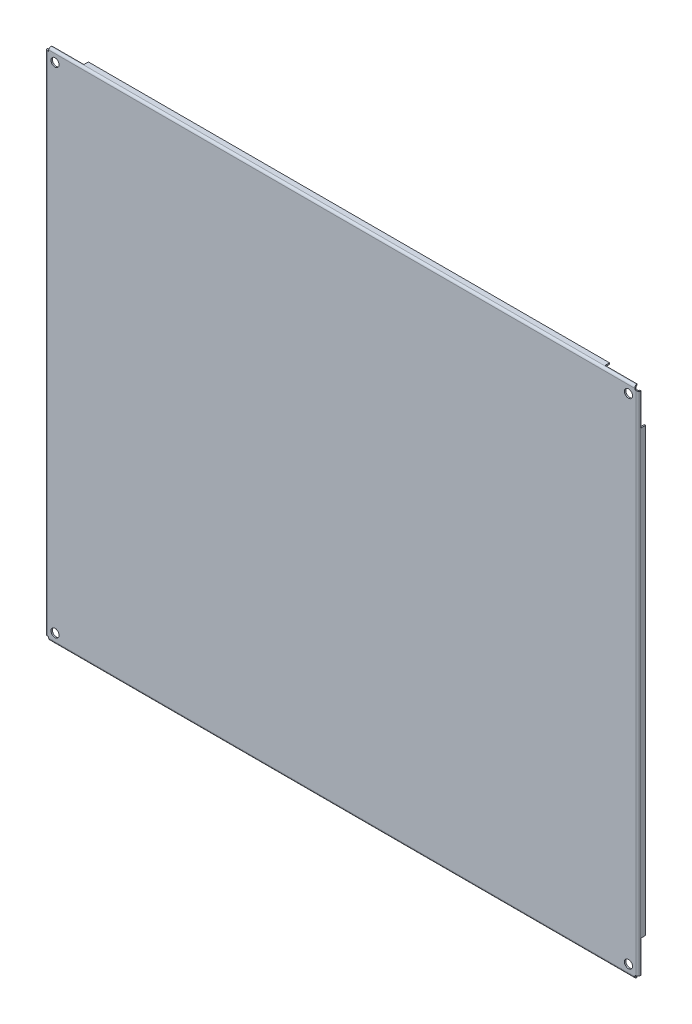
ISO-10303-21;
HEADER;
FILE_DESCRIPTION(('STEP AP214'),'2;1');
FILE_NAME('part.step','',(''),(''),'','','');
FILE_SCHEMA(('AUTOMOTIVE_DESIGN { 1 0 10303 214 1 1 1 1 }'));
ENDSEC;
DATA;
#1=APPLICATION_CONTEXT('core data for automotive mechanical design processes');
#2=APPLICATION_PROTOCOL_DEFINITION('international standard','automotive_design',2000,#1);
#3=PRODUCT_CONTEXT('',#1,'mechanical');
#4=PRODUCT('Part','Part','',(#3));
#5=PRODUCT_RELATED_PRODUCT_CATEGORY('part','',(#4));
#6=PRODUCT_DEFINITION_FORMATION('','',#4);
#7=PRODUCT_DEFINITION_CONTEXT('part definition',#1,'design');
#8=PRODUCT_DEFINITION('design','',#6,#7);
#9=PRODUCT_DEFINITION_SHAPE('','',#8);
#10=(LENGTH_UNIT() NAMED_UNIT(*) SI_UNIT(.MILLI.,.METRE.));
#11=(NAMED_UNIT(*) PLANE_ANGLE_UNIT() SI_UNIT($,.RADIAN.));
#12=(NAMED_UNIT(*) SI_UNIT($,.STERADIAN.) SOLID_ANGLE_UNIT());
#13=UNCERTAINTY_MEASURE_WITH_UNIT(LENGTH_MEASURE(1.E-05),#10,'distance_accuracy_value','');
#14=(GEOMETRIC_REPRESENTATION_CONTEXT(3) GLOBAL_UNCERTAINTY_ASSIGNED_CONTEXT((#13)) GLOBAL_UNIT_ASSIGNED_CONTEXT((#10,
#11,#12)) REPRESENTATION_CONTEXT('',''));
#15=CARTESIAN_POINT('',(0.,0.,0.));
#16=DIRECTION('',(0.,0.,1.));
#17=DIRECTION('',(1.,0.,0.));
#18=AXIS2_PLACEMENT_3D('',#15,#16,#17);
#19=CARTESIAN_POINT('',(0.,0.,0.));
#20=DIRECTION('',(0.,-1.,0.));
#21=DIRECTION('',(0.,0.,-1.));
#22=AXIS2_PLACEMENT_3D('',#19,#20,#21);
#23=PLANE('',#22);
#24=DIRECTION('',(0.,0.,1.));
#25=VECTOR('',#24,1.);
#26=CARTESIAN_POINT('',(324.585786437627,0.,0.));
#27=LINE('',#26,#25);
#28=CARTESIAN_POINT('',(324.585786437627,0.,0.999999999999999));
#29=VERTEX_POINT('',#28);
#30=CARTESIAN_POINT('',(324.585786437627,0.,1.5));
#31=VERTEX_POINT('',#30);
#32=EDGE_CURVE('E331',#29,#31,#27,.T.);
#33=ORIENTED_EDGE('',*,*,#32,.T.);
#34=DIRECTION('',(1.,0.,0.));
#35=VECTOR('',#34,1.);
#36=CARTESIAN_POINT('',(0.,0.,1.5));
#37=LINE('',#36,#35);
#38=CARTESIAN_POINT('',(-324.585786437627,0.,1.5));
#39=VERTEX_POINT('',#38);
#40=EDGE_CURVE('E326',#39,#31,#37,.T.);
#41=ORIENTED_EDGE('',*,*,#40,.F.);
#42=DIRECTION('',(0.,0.,-1.));
#43=VECTOR('',#42,1.);
#44=CARTESIAN_POINT('',(-324.585786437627,0.,0.));
#45=LINE('',#44,#43);
#46=CARTESIAN_POINT('',(-324.585786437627,0.,0.999999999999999));
#47=VERTEX_POINT('',#46);
#48=EDGE_CURVE('E320',#39,#47,#45,.T.);
#49=ORIENTED_EDGE('',*,*,#48,.T.);
#50=DIRECTION('',(-1.,0.,0.));
#51=VECTOR('',#50,1.);
#52=CARTESIAN_POINT('',(0.,0.,0.999999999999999));
#53=LINE('',#52,#51);
#54=CARTESIAN_POINT('',(-289.,0.,0.999999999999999));
#55=VERTEX_POINT('',#54);
#56=EDGE_CURVE('E323',#55,#47,#53,.T.);
#57=ORIENTED_EDGE('',*,*,#56,.F.);
#58=DIRECTION('',(0.,0.,-1.));
#59=VECTOR('',#58,1.);
#60=CARTESIAN_POINT('',(-289.,0.,0.));
#61=LINE('',#60,#59);
#62=CARTESIAN_POINT('',(-289.,0.,-4.));
#63=VERTEX_POINT('',#62);
#64=EDGE_CURVE('E392',#55,#63,#61,.T.);
#65=ORIENTED_EDGE('',*,*,#64,.T.);
#66=DIRECTION('',(1.,0.,0.));
#67=VECTOR('',#66,1.);
#68=CARTESIAN_POINT('',(0.,0.,-4.));
#69=LINE('',#68,#67);
#70=CARTESIAN_POINT('',(289.,0.,-4.));
#71=VERTEX_POINT('',#70);
#72=EDGE_CURVE('E383',#63,#71,#69,.T.);
#73=ORIENTED_EDGE('',*,*,#72,.T.);
#74=DIRECTION('',(0.,0.,1.));
#75=VECTOR('',#74,1.);
#76=CARTESIAN_POINT('',(289.,0.,0.));
#77=LINE('',#76,#75);
#78=CARTESIAN_POINT('',(289.,0.,0.999999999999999));
#79=VERTEX_POINT('',#78);
#80=EDGE_CURVE('E373',#71,#79,#77,.T.);
#81=ORIENTED_EDGE('',*,*,#80,.T.);
#82=DIRECTION('',(1.,0.,0.));
#83=VECTOR('',#82,1.);
#84=CARTESIAN_POINT('',(0.,0.,0.999999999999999));
#85=LINE('',#84,#83);
#86=EDGE_CURVE('E361',#79,#29,#85,.T.);
#87=ORIENTED_EDGE('',*,*,#86,.T.);
#88=EDGE_LOOP('',(#33,#41,#49,#57,#65,#73,#81,#87));
#89=FACE_BOUND('',#88,.T.);
#90=ADVANCED_FACE('F17',(#89),#23,.T.);
#91=CARTESIAN_POINT('',(-329.,570.,4.));
#92=DIRECTION('',(1.,0.,0.));
#93=DIRECTION('',(0.,0.,-1.));
#94=AXIS2_PLACEMENT_3D('',#91,#92,#93);
#95=PLANE('',#94);
#96=DIRECTION('',(0.,1.,0.));
#97=VECTOR('',#96,1.);
#98=CARTESIAN_POINT('',(-329.,570.,0.999999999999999));
#99=LINE('',#98,#97);
#100=CARTESIAN_POINT('',(-329.,565.585786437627,0.999999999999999));
#101=VERTEX_POINT('',#100);
#102=CARTESIAN_POINT('',(-329.,530.,0.999999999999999));
#103=VERTEX_POINT('',#102);
#104=EDGE_CURVE('E515',#101,#103,#99,.F.);
#105=ORIENTED_EDGE('',*,*,#104,.T.);
#106=DIRECTION('',(0.,0.,-1.));
#107=VECTOR('',#106,1.);
#108=CARTESIAN_POINT('',(-329.,530.,4.));
#109=LINE('',#108,#107);
#110=CARTESIAN_POINT('',(-329.,530.,-4.));
#111=VERTEX_POINT('',#110);
#112=EDGE_CURVE('E526',#103,#111,#109,.T.);
#113=ORIENTED_EDGE('',*,*,#112,.T.);
#114=DIRECTION('',(0.,1.,0.));
#115=VECTOR('',#114,1.);
#116=CARTESIAN_POINT('',(-329.,570.,-4.));
#117=LINE('',#116,#115);
#118=CARTESIAN_POINT('',(-329.,40.,-4.));
#119=VERTEX_POINT('',#118);
#120=EDGE_CURVE('E535',#111,#119,#117,.F.);
#121=ORIENTED_EDGE('',*,*,#120,.T.);
#122=DIRECTION('',(0.,0.,1.));
#123=VECTOR('',#122,1.);
#124=CARTESIAN_POINT('',(-329.,40.,4.));
#125=LINE('',#124,#123);
#126=CARTESIAN_POINT('',(-329.,40.,0.999999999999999));
#127=VERTEX_POINT('',#126);
#128=EDGE_CURVE('E523',#119,#127,#125,.T.);
#129=ORIENTED_EDGE('',*,*,#128,.T.);
#130=DIRECTION('',(0.,1.,0.));
#131=VECTOR('',#130,1.);
#132=CARTESIAN_POINT('',(-329.,570.,0.999999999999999));
#133=LINE('',#132,#131);
#134=CARTESIAN_POINT('',(-329.,4.41421356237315,0.999999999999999));
#135=VERTEX_POINT('',#134);
#136=EDGE_CURVE('E345',#135,#127,#133,.T.);
#137=ORIENTED_EDGE('',*,*,#136,.F.);
#138=DIRECTION('',(0.,0.,-1.));
#139=VECTOR('',#138,1.);
#140=CARTESIAN_POINT('',(-329.,4.41421356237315,4.));
#141=LINE('',#140,#139);
#142=CARTESIAN_POINT('',(-329.,4.41421356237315,1.5));
#143=VERTEX_POINT('',#142);
#144=EDGE_CURVE('E532',#143,#135,#141,.T.);
#145=ORIENTED_EDGE('',*,*,#144,.F.);
#146=DIRECTION('',(0.,1.,0.));
#147=VECTOR('',#146,1.);
#148=CARTESIAN_POINT('',(-329.,570.,1.5));
#149=LINE('',#148,#147);
#150=CARTESIAN_POINT('',(-329.,565.585786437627,1.5));
#151=VERTEX_POINT('',#150);
#152=EDGE_CURVE('E1172',#151,#143,#149,.F.);
#153=ORIENTED_EDGE('',*,*,#152,.F.);
#154=DIRECTION('',(0.,0.,1.));
#155=VECTOR('',#154,1.);
#156=CARTESIAN_POINT('',(-329.,565.585786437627,2.5));
#157=LINE('',#156,#155);
#158=EDGE_CURVE('E1177',#101,#151,#157,.T.);
#159=ORIENTED_EDGE('',*,*,#158,.F.);
#160=EDGE_LOOP('',(#105,#113,#121,#129,#137,#145,#153,#159));
#161=FACE_BOUND('',#160,.T.);
#162=ADVANCED_FACE('F808',(#161),#95,.F.);
#163=CARTESIAN_POINT('',(0.,570.,0.));
#164=DIRECTION('',(0.,-1.,0.));
#165=DIRECTION('',(0.,0.,-1.));
#166=AXIS2_PLACEMENT_3D('',#163,#164,#165);
#167=PLANE('',#166);
#168=DIRECTION('',(-1.,0.,0.));
#169=VECTOR('',#168,1.);
#170=CARTESIAN_POINT('',(0.,570.,0.999999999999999));
#171=LINE('',#170,#169);
#172=CARTESIAN_POINT('',(289.,570.,0.999999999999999));
#173=VERTEX_POINT('',#172);
#174=CARTESIAN_POINT('',(324.585786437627,570.,0.999999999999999));
#175=VERTEX_POINT('',#174);
#176=EDGE_CURVE('E500',#173,#175,#171,.F.);
#177=ORIENTED_EDGE('',*,*,#176,.F.);
#178=DIRECTION('',(0.,0.,1.));
#179=VECTOR('',#178,1.);
#180=CARTESIAN_POINT('',(289.,570.,0.));
#181=LINE('',#180,#179);
#182=CARTESIAN_POINT('',(289.,570.,-4.));
#183=VERTEX_POINT('',#182);
#184=EDGE_CURVE('E1154',#173,#183,#181,.F.);
#185=ORIENTED_EDGE('',*,*,#184,.T.);
#186=DIRECTION('',(1.,0.,0.));
#187=VECTOR('',#186,1.);
#188=CARTESIAN_POINT('',(0.,570.,-4.));
#189=LINE('',#188,#187);
#190=CARTESIAN_POINT('',(-289.,570.,-4.));
#191=VERTEX_POINT('',#190);
#192=EDGE_CURVE('E493',#183,#191,#189,.F.);
#193=ORIENTED_EDGE('',*,*,#192,.T.);
#194=DIRECTION('',(0.,0.,-1.));
#195=VECTOR('',#194,1.);
#196=CARTESIAN_POINT('',(-289.,570.,0.));
#197=LINE('',#196,#195);
#198=CARTESIAN_POINT('',(-289.,570.,0.999999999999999));
#199=VERTEX_POINT('',#198);
#200=EDGE_CURVE('E481',#191,#199,#197,.F.);
#201=ORIENTED_EDGE('',*,*,#200,.T.);
#202=DIRECTION('',(1.,0.,0.));
#203=VECTOR('',#202,1.);
#204=CARTESIAN_POINT('',(0.,570.,0.999999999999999));
#205=LINE('',#204,#203);
#206=CARTESIAN_POINT('',(-324.585786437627,570.,0.999999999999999));
#207=VERTEX_POINT('',#206);
#208=EDGE_CURVE('E478',#199,#207,#205,.F.);
#209=ORIENTED_EDGE('',*,*,#208,.T.);
#210=DIRECTION('',(0.,0.,-1.));
#211=VECTOR('',#210,1.);
#212=CARTESIAN_POINT('',(-324.585786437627,570.,0.));
#213=LINE('',#212,#211);
#214=CARTESIAN_POINT('',(-324.585786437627,570.,1.5));
#215=VERTEX_POINT('',#214);
#216=EDGE_CURVE('E449',#215,#207,#213,.T.);
#217=ORIENTED_EDGE('',*,*,#216,.F.);
#218=DIRECTION('',(-1.,0.,0.));
#219=VECTOR('',#218,1.);
#220=CARTESIAN_POINT('',(-329.,570.,1.5));
#221=LINE('',#220,#219);
#222=CARTESIAN_POINT('',(324.585786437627,570.,1.5));
#223=VERTEX_POINT('',#222);
#224=EDGE_CURVE('E499',#223,#215,#221,.T.);
#225=ORIENTED_EDGE('',*,*,#224,.F.);
#226=DIRECTION('',(0.,0.,-1.));
#227=VECTOR('',#226,1.);
#228=CARTESIAN_POINT('',(324.585786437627,570.,2.5));
#229=LINE('',#228,#227);
#230=EDGE_CURVE('E1167',#175,#223,#229,.F.);
#231=ORIENTED_EDGE('',*,*,#230,.F.);
#232=EDGE_LOOP('',(#177,#185,#193,#201,#209,#217,#225,#231));
#233=FACE_BOUND('',#232,.T.);
#234=ADVANCED_FACE('F811',(#233),#167,.F.);
#235=CARTESIAN_POINT('',(329.,570.,4.));
#236=DIRECTION('',(-1.,0.,0.));
#237=DIRECTION('',(0.,0.,1.));
#238=AXIS2_PLACEMENT_3D('',#235,#236,#237);
#239=PLANE('',#238);
#240=DIRECTION('',(0.,1.,0.));
#241=VECTOR('',#240,1.);
#242=CARTESIAN_POINT('',(329.,570.,0.999999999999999));
#243=LINE('',#242,#241);
#244=CARTESIAN_POINT('',(329.,4.41421356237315,0.999999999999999));
#245=VERTEX_POINT('',#244);
#246=CARTESIAN_POINT('',(329.,40.,0.999999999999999));
#247=VERTEX_POINT('',#246);
#248=EDGE_CURVE('E463',#245,#247,#243,.T.);
#249=ORIENTED_EDGE('',*,*,#248,.T.);
#250=DIRECTION('',(0.,0.,1.));
#251=VECTOR('',#250,1.);
#252=CARTESIAN_POINT('',(329.,40.,4.));
#253=LINE('',#252,#251);
#254=CARTESIAN_POINT('',(329.,40.,-4.));
#255=VERTEX_POINT('',#254);
#256=EDGE_CURVE('E1127',#247,#255,#253,.F.);
#257=ORIENTED_EDGE('',*,*,#256,.T.);
#258=DIRECTION('',(0.,1.,0.));
#259=VECTOR('',#258,1.);
#260=CARTESIAN_POINT('',(329.,570.,-4.));
#261=LINE('',#260,#259);
#262=CARTESIAN_POINT('',(329.,530.,-4.));
#263=VERTEX_POINT('',#262);
#264=EDGE_CURVE('E1129',#263,#255,#261,.F.);
#265=ORIENTED_EDGE('',*,*,#264,.F.);
#266=DIRECTION('',(0.,0.,-1.));
#267=VECTOR('',#266,1.);
#268=CARTESIAN_POINT('',(329.,530.,4.));
#269=LINE('',#268,#267);
#270=CARTESIAN_POINT('',(329.,530.,0.999999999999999));
#271=VERTEX_POINT('',#270);
#272=EDGE_CURVE('E444',#263,#271,#269,.F.);
#273=ORIENTED_EDGE('',*,*,#272,.T.);
#274=DIRECTION('',(0.,1.,0.));
#275=VECTOR('',#274,1.);
#276=CARTESIAN_POINT('',(329.,570.,0.999999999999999));
#277=LINE('',#276,#275);
#278=CARTESIAN_POINT('',(329.,565.585786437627,0.999999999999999));
#279=VERTEX_POINT('',#278);
#280=EDGE_CURVE('E441',#279,#271,#277,.F.);
#281=ORIENTED_EDGE('',*,*,#280,.F.);
#282=DIRECTION('',(0.,0.,1.));
#283=VECTOR('',#282,1.);
#284=CARTESIAN_POINT('',(329.,565.585786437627,4.));
#285=LINE('',#284,#283);
#286=CARTESIAN_POINT('',(329.,565.585786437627,1.5));
#287=VERTEX_POINT('',#286);
#288=EDGE_CURVE('E160',#287,#279,#285,.F.);
#289=ORIENTED_EDGE('',*,*,#288,.F.);
#290=DIRECTION('',(0.,1.,0.));
#291=VECTOR('',#290,1.);
#292=CARTESIAN_POINT('',(329.,570.,1.5));
#293=LINE('',#292,#291);
#294=CARTESIAN_POINT('',(329.,4.41421356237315,1.5));
#295=VERTEX_POINT('',#294);
#296=EDGE_CURVE('E1122',#295,#287,#293,.T.);
#297=ORIENTED_EDGE('',*,*,#296,.F.);
#298=DIRECTION('',(0.,0.,-1.));
#299=VECTOR('',#298,1.);
#300=CARTESIAN_POINT('',(329.,4.41421356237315,4.));
#301=LINE('',#300,#299);
#302=EDGE_CURVE('E962',#245,#295,#301,.F.);
#303=ORIENTED_EDGE('',*,*,#302,.F.);
#304=EDGE_LOOP('',(#249,#257,#265,#273,#281,#289,#297,#303));
#305=FACE_BOUND('',#304,.T.);
#306=ADVANCED_FACE('F815',(#305),#239,.F.);
#307=CARTESIAN_POINT('',(0.,1.5,0.999999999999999));
#308=DIRECTION('',(0.,0.,-1.));
#309=DIRECTION('',(-1.,0.,0.));
#310=AXIS2_PLACEMENT_3D('',#307,#308,#309);
#311=PLANE('',#310);
#312=DIRECTION('',(0.,1.,0.));
#313=VECTOR('',#312,1.);
#314=CARTESIAN_POINT('',(-324.585786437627,1.5,0.999999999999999));
#315=LINE('',#314,#313);
#316=CARTESIAN_POINT('',(-324.585786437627,1.5,0.999999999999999));
#317=VERTEX_POINT('',#316);
#318=EDGE_CURVE('E330',#47,#317,#315,.T.);
#319=ORIENTED_EDGE('',*,*,#318,.T.);
#320=DIRECTION('',(1.,0.,0.));
#321=VECTOR('',#320,1.);
#322=CARTESIAN_POINT('',(0.,1.5,0.999999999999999));
#323=LINE('',#322,#321);
#324=CARTESIAN_POINT('',(-289.,1.5,0.999999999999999));
#325=VERTEX_POINT('',#324);
#326=EDGE_CURVE('E353',#317,#325,#323,.T.);
#327=ORIENTED_EDGE('',*,*,#326,.T.);
#328=DIRECTION('',(0.,1.,0.));
#329=VECTOR('',#328,1.);
#330=CARTESIAN_POINT('',(-289.,1.5,0.999999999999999));
#331=LINE('',#330,#329);
#332=EDGE_CURVE('E337',#325,#55,#331,.F.);
#333=ORIENTED_EDGE('',*,*,#332,.T.);
#334=ORIENTED_EDGE('',*,*,#56,.T.);
#335=EDGE_LOOP('',(#319,#327,#333,#334));
#336=FACE_BOUND('',#335,.T.);
#337=ADVANCED_FACE('F334',(#336),#311,.T.);
#338=CARTESIAN_POINT('',(-289.,1.5,0.));
#339=DIRECTION('',(1.,0.,0.));
#340=DIRECTION('',(0.,0.,-1.));
#341=AXIS2_PLACEMENT_3D('',#338,#339,#340);
#342=PLANE('',#341);
#343=ORIENTED_EDGE('',*,*,#64,.F.);
#344=ORIENTED_EDGE('',*,*,#332,.F.);
#345=DIRECTION('',(0.,0.,-1.));
#346=VECTOR('',#345,1.);
#347=CARTESIAN_POINT('',(-289.,1.5,0.));
#348=LINE('',#347,#346);
#349=CARTESIAN_POINT('',(-289.,1.5,-4.));
#350=VERTEX_POINT('',#349);
#351=EDGE_CURVE('E355',#325,#350,#348,.T.);
#352=ORIENTED_EDGE('',*,*,#351,.T.);
#353=DIRECTION('',(0.,1.,0.));
#354=VECTOR('',#353,1.);
#355=CARTESIAN_POINT('',(-289.,1.5,-4.));
#356=LINE('',#355,#354);
#357=EDGE_CURVE('E389',#350,#63,#356,.F.);
#358=ORIENTED_EDGE('',*,*,#357,.T.);
#359=EDGE_LOOP('',(#343,#344,#352,#358));
#360=FACE_BOUND('',#359,.T.);
#361=ADVANCED_FACE('F822',(#360),#342,.F.);
#362=CARTESIAN_POINT('',(0.,1.5,-4.));
#363=DIRECTION('',(0.,0.,1.));
#364=DIRECTION('',(1.,0.,0.));
#365=AXIS2_PLACEMENT_3D('',#362,#363,#364);
#366=PLANE('',#365);
#367=ORIENTED_EDGE('',*,*,#72,.F.);
#368=ORIENTED_EDGE('',*,*,#357,.F.);
#369=DIRECTION('',(1.,0.,0.));
#370=VECTOR('',#369,1.);
#371=CARTESIAN_POINT('',(0.,1.5,-4.));
#372=LINE('',#371,#370);
#373=CARTESIAN_POINT('',(289.,1.5,-4.));
#374=VERTEX_POINT('',#373);
#375=EDGE_CURVE('E377',#350,#374,#372,.T.);
#376=ORIENTED_EDGE('',*,*,#375,.T.);
#377=DIRECTION('',(0.,1.,0.));
#378=VECTOR('',#377,1.);
#379=CARTESIAN_POINT('',(289.,1.5,-4.));
#380=LINE('',#379,#378);
#381=EDGE_CURVE('E380',#374,#71,#380,.F.);
#382=ORIENTED_EDGE('',*,*,#381,.T.);
#383=EDGE_LOOP('',(#367,#368,#376,#382));
#384=FACE_BOUND('',#383,.T.);
#385=ADVANCED_FACE('F825',(#384),#366,.F.);
#386=CARTESIAN_POINT('',(289.,1.5,0.));
#387=DIRECTION('',(-1.,0.,0.));
#388=DIRECTION('',(0.,0.,1.));
#389=AXIS2_PLACEMENT_3D('',#386,#387,#388);
#390=PLANE('',#389);
#391=ORIENTED_EDGE('',*,*,#80,.F.);
#392=ORIENTED_EDGE('',*,*,#381,.F.);
#393=DIRECTION('',(0.,0.,-1.));
#394=VECTOR('',#393,1.);
#395=CARTESIAN_POINT('',(289.,1.5,0.));
#396=LINE('',#395,#394);
#397=CARTESIAN_POINT('',(289.,1.5,0.999999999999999));
#398=VERTEX_POINT('',#397);
#399=EDGE_CURVE('E367',#374,#398,#396,.F.);
#400=ORIENTED_EDGE('',*,*,#399,.T.);
#401=DIRECTION('',(0.,1.,0.));
#402=VECTOR('',#401,1.);
#403=CARTESIAN_POINT('',(289.,1.5,0.999999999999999));
#404=LINE('',#403,#402);
#405=EDGE_CURVE('E370',#398,#79,#404,.F.);
#406=ORIENTED_EDGE('',*,*,#405,.T.);
#407=EDGE_LOOP('',(#391,#392,#400,#406));
#408=FACE_BOUND('',#407,.T.);
#409=ADVANCED_FACE('F829',(#408),#390,.F.);
#410=CARTESIAN_POINT('',(0.,1.5,0.999999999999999));
#411=DIRECTION('',(0.,0.,1.));
#412=DIRECTION('',(1.,0.,0.));
#413=AXIS2_PLACEMENT_3D('',#410,#411,#412);
#414=PLANE('',#413);
#415=ORIENTED_EDGE('',*,*,#86,.F.);
#416=ORIENTED_EDGE('',*,*,#405,.F.);
#417=DIRECTION('',(1.,0.,0.));
#418=VECTOR('',#417,1.);
#419=CARTESIAN_POINT('',(0.,1.5,0.999999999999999));
#420=LINE('',#419,#418);
#421=CARTESIAN_POINT('',(324.585786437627,1.5,0.999999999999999));
#422=VERTEX_POINT('',#421);
#423=EDGE_CURVE('E364',#398,#422,#420,.T.);
#424=ORIENTED_EDGE('',*,*,#423,.T.);
#425=DIRECTION('',(0.,1.,0.));
#426=VECTOR('',#425,1.);
#427=CARTESIAN_POINT('',(324.585786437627,1.5,0.999999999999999));
#428=LINE('',#427,#426);
#429=EDGE_CURVE('E358',#422,#29,#428,.F.);
#430=ORIENTED_EDGE('',*,*,#429,.T.);
#431=EDGE_LOOP('',(#415,#416,#424,#430));
#432=FACE_BOUND('',#431,.T.);
#433=ADVANCED_FACE('F833',(#432),#414,.F.);
#434=CARTESIAN_POINT('',(324.585786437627,1.5,0.));
#435=DIRECTION('',(-1.,0.,0.));
#436=DIRECTION('',(0.,0.,1.));
#437=AXIS2_PLACEMENT_3D('',#434,#435,#436);
#438=PLANE('',#437);
#439=ORIENTED_EDGE('',*,*,#32,.F.);
#440=ORIENTED_EDGE('',*,*,#429,.F.);
#441=DIRECTION('',(0.,0.,-1.));
#442=VECTOR('',#441,1.);
#443=CARTESIAN_POINT('',(324.585786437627,1.5,0.));
#444=LINE('',#443,#442);
#445=CARTESIAN_POINT('',(324.585786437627,1.5,1.5));
#446=VERTEX_POINT('',#445);
#447=EDGE_CURVE('E366',#422,#446,#444,.F.);
#448=ORIENTED_EDGE('',*,*,#447,.T.);
#449=DIRECTION('',(0.,1.,0.));
#450=VECTOR('',#449,1.);
#451=CARTESIAN_POINT('',(324.585786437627,0.75,1.5));
#452=LINE('',#451,#450);
#453=EDGE_CURVE('E1113',#31,#446,#452,.T.);
#454=ORIENTED_EDGE('',*,*,#453,.F.);
#455=EDGE_LOOP('',(#439,#440,#448,#454));
#456=FACE_BOUND('',#455,.T.);
#457=ADVANCED_FACE('F837',(#456),#438,.F.);
#458=CARTESIAN_POINT('',(-324.585786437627,1.5,0.));
#459=DIRECTION('',(1.,0.,0.));
#460=DIRECTION('',(0.,0.,-1.));
#461=AXIS2_PLACEMENT_3D('',#458,#459,#460);
#462=PLANE('',#461);
#463=ORIENTED_EDGE('',*,*,#48,.F.);
#464=DIRECTION('',(0.,-1.,0.));
#465=VECTOR('',#464,1.);
#466=CARTESIAN_POINT('',(-324.585786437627,0.75,1.5));
#467=LINE('',#466,#465);
#468=CARTESIAN_POINT('',(-324.585786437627,1.5,1.5));
#469=VERTEX_POINT('',#468);
#470=EDGE_CURVE('E1110',#469,#39,#467,.T.);
#471=ORIENTED_EDGE('',*,*,#470,.F.);
#472=DIRECTION('',(0.,0.,-1.));
#473=VECTOR('',#472,1.);
#474=CARTESIAN_POINT('',(-324.585786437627,1.5,0.));
#475=LINE('',#474,#473);
#476=EDGE_CURVE('E342',#469,#317,#475,.T.);
#477=ORIENTED_EDGE('',*,*,#476,.T.);
#478=ORIENTED_EDGE('',*,*,#318,.F.);
#479=EDGE_LOOP('',(#463,#471,#477,#478));
#480=FACE_BOUND('',#479,.T.);
#481=ADVANCED_FACE('F340',(#480),#462,.F.);
#482=CARTESIAN_POINT('',(0.,2.5,1.5));
#483=DIRECTION('',(1.,0.,0.));
#484=DIRECTION('',(0.,0.,-1.));
#485=AXIS2_PLACEMENT_3D('',#482,#483,#484);
#486=CYLINDRICAL_SURFACE('',#485,2.5);
#487=CARTESIAN_POINT('',(325.,2.5,4.));
#488=CARTESIAN_POINT('',(324.999990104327,2.43503514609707,4.00000716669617));
#489=CARTESIAN_POINT('',(324.998839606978,2.3700851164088,3.99746790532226));
#490=CARTESIAN_POINT('',(324.994583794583,2.24066759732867,3.98735772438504));
#491=CARTESIAN_POINT('',(324.991479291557,2.17619991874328,3.97978889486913));
#492=CARTESIAN_POINT('',(324.983649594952,2.04828077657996,3.95970195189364));
#493=CARTESIAN_POINT('',(324.978927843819,1.98482745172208,3.94719434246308));
#494=CARTESIAN_POINT('',(324.96812996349,1.85919674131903,3.91734262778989));
#495=CARTESIAN_POINT('',(324.962053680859,1.79701950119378,3.8999979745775));
#496=CARTESIAN_POINT('',(324.941762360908,1.60919599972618,3.83967369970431));
#497=CARTESIAN_POINT('',(324.925746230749,1.48611584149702,3.78900635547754));
#498=CARTESIAN_POINT('',(324.89083277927,1.24986252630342,3.66904322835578));
#499=CARTESIAN_POINT('',(324.871933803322,1.13669511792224,3.59973672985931));
#500=CARTESIAN_POINT('',(324.831621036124,0.916713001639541,3.43977461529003));
#501=CARTESIAN_POINT('',(324.810125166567,0.810635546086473,3.34812208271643));
#502=CARTESIAN_POINT('',(324.767235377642,0.615222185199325,3.14837717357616));
#503=CARTESIAN_POINT('',(324.745841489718,0.525891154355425,3.04028002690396));
#504=CARTESIAN_POINT('',(324.704466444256,0.3649971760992,2.80844024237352));
#505=CARTESIAN_POINT('',(324.684516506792,0.293772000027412,2.68445721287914));
#506=CARTESIAN_POINT('',(324.648372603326,0.173363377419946,2.42578882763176));
#507=CARTESIAN_POINT('',(324.632175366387,0.124160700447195,2.29111293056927));
#508=CARTESIAN_POINT('',(324.608970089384,0.0580945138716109,2.04696003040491));
#509=CARTESIAN_POINT('',(324.60070102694,0.0363713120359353,1.93890652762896));
#510=CARTESIAN_POINT('',(324.592011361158,0.0145839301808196,1.77521638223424));
#511=CARTESIAN_POINT('',(324.589733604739,0.00912101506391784,1.72035946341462));
#512=CARTESIAN_POINT('',(324.586623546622,0.00182730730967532,1.61034185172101));
#513=CARTESIAN_POINT('',(324.585791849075,-1.96727089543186E-06,1.55518104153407));
#514=CARTESIAN_POINT('',(324.585786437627,0.,1.5));
#515=B_SPLINE_CURVE_WITH_KNOTS('',3,(#487,#488,#489,#490,#491,#492,#493,#494,#495,#496,#497,
#498,#499,#500,#501,#502,#503,#504,#505,#506,#507,#508,#509,#510,#511,#512,#513,#514),
.UNSPECIFIED.,.F.,.F.,(4,2,2,2,2,2,2,2,2,2,2,2,2,4),(0.,0.194812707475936,0.389544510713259,
0.583864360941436,0.778206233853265,1.17849622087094,1.579016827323,2.00252209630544,
2.42615044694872,2.85718159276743,3.28783561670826,3.61833762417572,3.78373858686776,
3.94920863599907),.UNSPECIFIED.);
#516=CARTESIAN_POINT('',(325.,2.49999999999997,4.));
#517=VERTEX_POINT('',#516);
#518=EDGE_CURVE('E24',#517,#31,#515,.T.);
#519=ORIENTED_EDGE('',*,*,#518,.F.);
#520=DIRECTION('',(-1.,0.,0.));
#521=VECTOR('',#520,1.);
#522=CARTESIAN_POINT('',(-329.,2.49999999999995,4.));
#523=LINE('',#522,#521);
#524=CARTESIAN_POINT('',(-325.,2.49999999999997,4.));
#525=VERTEX_POINT('',#524);
#526=EDGE_CURVE('E409',#517,#525,#523,.T.);
#527=ORIENTED_EDGE('',*,*,#526,.T.);
#528=CARTESIAN_POINT('',(-324.585786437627,0.,1.5));
#529=CARTESIAN_POINT('',(-324.5857963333,-7.16669616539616E-06,1.56496485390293));
#530=CARTESIAN_POINT('',(-324.586946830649,0.00253209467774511,1.6299148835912));
#531=CARTESIAN_POINT('',(-324.591202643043,0.01264227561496,1.75933240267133));
#532=CARTESIAN_POINT('',(-324.59430714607,0.0202111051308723,1.82380008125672));
#533=CARTESIAN_POINT('',(-324.602136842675,0.0402980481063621,1.95171922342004));
#534=CARTESIAN_POINT('',(-324.606858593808,0.0528056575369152,2.01517254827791));
#535=CARTESIAN_POINT('',(-324.617656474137,0.082657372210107,2.14080325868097));
#536=CARTESIAN_POINT('',(-324.623732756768,0.100002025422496,2.20298049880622));
#537=CARTESIAN_POINT('',(-324.644024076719,0.160326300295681,2.3908040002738));
#538=CARTESIAN_POINT('',(-324.660040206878,0.210993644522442,2.51388415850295));
#539=CARTESIAN_POINT('',(-324.694953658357,0.330956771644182,2.75013747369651));
#540=CARTESIAN_POINT('',(-324.713852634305,0.400263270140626,2.86330488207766));
#541=CARTESIAN_POINT('',(-324.754165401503,0.560225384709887,3.08328699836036));
#542=CARTESIAN_POINT('',(-324.77566127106,0.6518779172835,3.18936445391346));
#543=CARTESIAN_POINT('',(-324.818551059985,0.851622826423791,3.38477781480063));
#544=CARTESIAN_POINT('',(-324.839944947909,0.959719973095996,3.47410884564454));
#545=CARTESIAN_POINT('',(-324.88131999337,1.19155975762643,3.63500282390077));
#546=CARTESIAN_POINT('',(-324.901269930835,1.31554278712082,3.70622799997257));
#547=CARTESIAN_POINT('',(-324.9374138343,1.5742111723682,3.82663662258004));
#548=CARTESIAN_POINT('',(-324.95361107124,1.7088870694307,3.87583929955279));
#549=CARTESIAN_POINT('',(-324.976816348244,1.95303996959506,3.94190548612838));
#550=CARTESIAN_POINT('',(-324.985085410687,2.061093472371,3.96362868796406));
#551=CARTESIAN_POINT('',(-324.993775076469,2.22478361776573,3.98541606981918));
#552=CARTESIAN_POINT('',(-324.996052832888,2.27964053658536,3.99087898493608));
#553=CARTESIAN_POINT('',(-324.999162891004,2.38965814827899,3.99817269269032));
#554=CARTESIAN_POINT('',(-324.999994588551,2.44481895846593,4.0000019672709));
#555=CARTESIAN_POINT('',(-325.,2.5,4.));
#556=B_SPLINE_CURVE_WITH_KNOTS('',3,(#528,#529,#530,#531,#532,#533,#534,#535,#536,#537,#538,
#539,#540,#541,#542,#543,#544,#545,#546,#547,#548,#549,#550,#551,#552,#553,#554,#555),
.UNSPECIFIED.,.F.,.F.,(4,2,2,2,2,2,2,2,2,2,2,2,2,4),(0.,0.194812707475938,0.38954451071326,
0.583864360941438,0.778206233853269,1.17849622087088,1.57901682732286,2.00252209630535,
2.42615044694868,2.85718159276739,3.28783561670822,3.6183376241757,3.78373858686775,
3.94920863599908),.UNSPECIFIED.);
#557=EDGE_CURVE('E728',#39,#525,#556,.T.);
#558=ORIENTED_EDGE('',*,*,#557,.F.);
#559=ORIENTED_EDGE('',*,*,#40,.T.);
#560=EDGE_LOOP('',(#519,#527,#558,#559));
#561=FACE_BOUND('',#560,.T.);
#562=ADVANCED_FACE('F843',(#561),#486,.T.);
#563=CARTESIAN_POINT('',(-327.5,570.,0.999999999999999));
#564=DIRECTION('',(0.,0.,-1.));
#565=DIRECTION('',(-1.,0.,0.));
#566=AXIS2_PLACEMENT_3D('',#563,#564,#565);
#567=PLANE('',#566);
#568=DIRECTION('',(1.,0.,0.));
#569=VECTOR('',#568,1.);
#570=CARTESIAN_POINT('',(-327.5,40.,0.999999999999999));
#571=LINE('',#570,#569);
#572=CARTESIAN_POINT('',(-327.5,40.,0.999999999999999));
#573=VERTEX_POINT('',#572);
#574=EDGE_CURVE('E537',#127,#573,#571,.T.);
#575=ORIENTED_EDGE('',*,*,#574,.T.);
#576=DIRECTION('',(0.,1.,0.));
#577=VECTOR('',#576,1.);
#578=CARTESIAN_POINT('',(-327.5,570.,0.999999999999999));
#579=LINE('',#578,#577);
#580=CARTESIAN_POINT('',(-327.5,4.41421356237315,0.999999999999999));
#581=VERTEX_POINT('',#580);
#582=EDGE_CURVE('E1097',#581,#573,#579,.T.);
#583=ORIENTED_EDGE('',*,*,#582,.F.);
#584=DIRECTION('',(1.,0.,0.));
#585=VECTOR('',#584,1.);
#586=CARTESIAN_POINT('',(-327.5,4.41421356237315,0.999999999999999));
#587=LINE('',#586,#585);
#588=EDGE_CURVE('E1185',#135,#581,#587,.T.);
#589=ORIENTED_EDGE('',*,*,#588,.F.);
#590=ORIENTED_EDGE('',*,*,#136,.T.);
#591=EDGE_LOOP('',(#575,#583,#589,#590));
#592=FACE_BOUND('',#591,.T.);
#593=ADVANCED_FACE('F847',(#592),#567,.T.);
#594=CARTESIAN_POINT('',(-327.5,40.,4.));
#595=DIRECTION('',(0.,1.,0.));
#596=DIRECTION('',(0.,0.,1.));
#597=AXIS2_PLACEMENT_3D('',#594,#595,#596);
#598=PLANE('',#597);
#599=ORIENTED_EDGE('',*,*,#128,.F.);
#600=DIRECTION('',(1.,0.,0.));
#601=VECTOR('',#600,1.);
#602=CARTESIAN_POINT('',(-327.5,40.,-4.));
#603=LINE('',#602,#601);
#604=CARTESIAN_POINT('',(-327.5,40.,-4.));
#605=VERTEX_POINT('',#604);
#606=EDGE_CURVE('E528',#119,#605,#603,.T.);
#607=ORIENTED_EDGE('',*,*,#606,.T.);
#608=DIRECTION('',(0.,0.,-1.));
#609=VECTOR('',#608,1.);
#610=CARTESIAN_POINT('',(-327.5,40.,4.));
#611=LINE('',#610,#609);
#612=EDGE_CURVE('E1094',#573,#605,#611,.T.);
#613=ORIENTED_EDGE('',*,*,#612,.F.);
#614=ORIENTED_EDGE('',*,*,#574,.F.);
#615=EDGE_LOOP('',(#599,#607,#613,#614));
#616=FACE_BOUND('',#615,.T.);
#617=ADVANCED_FACE('F852',(#616),#598,.F.);
#618=CARTESIAN_POINT('',(-327.5,570.,-4.));
#619=DIRECTION('',(0.,0.,1.));
#620=DIRECTION('',(1.,0.,0.));
#621=AXIS2_PLACEMENT_3D('',#618,#619,#620);
#622=PLANE('',#621);
#623=ORIENTED_EDGE('',*,*,#120,.F.);
#624=DIRECTION('',(1.,0.,0.));
#625=VECTOR('',#624,1.);
#626=CARTESIAN_POINT('',(-327.5,530.,-4.));
#627=LINE('',#626,#625);
#628=CARTESIAN_POINT('',(-327.5,530.,-4.));
#629=VERTEX_POINT('',#628);
#630=EDGE_CURVE('E518',#111,#629,#627,.T.);
#631=ORIENTED_EDGE('',*,*,#630,.T.);
#632=DIRECTION('',(0.,1.,0.));
#633=VECTOR('',#632,1.);
#634=CARTESIAN_POINT('',(-327.5,570.,-4.));
#635=LINE('',#634,#633);
#636=EDGE_CURVE('E1091',#605,#629,#635,.T.);
#637=ORIENTED_EDGE('',*,*,#636,.F.);
#638=ORIENTED_EDGE('',*,*,#606,.F.);
#639=EDGE_LOOP('',(#623,#631,#637,#638));
#640=FACE_BOUND('',#639,.T.);
#641=ADVANCED_FACE('F856',(#640),#622,.F.);
#642=CARTESIAN_POINT('',(-327.5,530.,4.));
#643=DIRECTION('',(0.,-1.,0.));
#644=DIRECTION('',(0.,0.,-1.));
#645=AXIS2_PLACEMENT_3D('',#642,#643,#644);
#646=PLANE('',#645);
#647=ORIENTED_EDGE('',*,*,#112,.F.);
#648=DIRECTION('',(1.,0.,0.));
#649=VECTOR('',#648,1.);
#650=CARTESIAN_POINT('',(-327.5,530.,0.999999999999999));
#651=LINE('',#650,#649);
#652=CARTESIAN_POINT('',(-327.5,530.,0.999999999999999));
#653=VERTEX_POINT('',#652);
#654=EDGE_CURVE('E517',#103,#653,#651,.T.);
#655=ORIENTED_EDGE('',*,*,#654,.T.);
#656=DIRECTION('',(0.,0.,-1.));
#657=VECTOR('',#656,1.);
#658=CARTESIAN_POINT('',(-327.5,530.,4.));
#659=LINE('',#658,#657);
#660=EDGE_CURVE('E1088',#629,#653,#659,.F.);
#661=ORIENTED_EDGE('',*,*,#660,.F.);
#662=ORIENTED_EDGE('',*,*,#630,.F.);
#663=EDGE_LOOP('',(#647,#655,#661,#662));
#664=FACE_BOUND('',#663,.T.);
#665=ADVANCED_FACE('F860',(#664),#646,.F.);
#666=CARTESIAN_POINT('',(-327.5,570.,0.999999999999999));
#667=DIRECTION('',(0.,0.,1.));
#668=DIRECTION('',(1.,0.,0.));
#669=AXIS2_PLACEMENT_3D('',#666,#667,#668);
#670=PLANE('',#669);
#671=ORIENTED_EDGE('',*,*,#104,.F.);
#672=DIRECTION('',(1.,0.,0.));
#673=VECTOR('',#672,1.);
#674=CARTESIAN_POINT('',(-327.5,565.585786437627,0.999999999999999));
#675=LINE('',#674,#673);
#676=CARTESIAN_POINT('',(-327.5,565.585786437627,0.999999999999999));
#677=VERTEX_POINT('',#676);
#678=EDGE_CURVE('E1180',#677,#101,#675,.F.);
#679=ORIENTED_EDGE('',*,*,#678,.F.);
#680=DIRECTION('',(0.,1.,0.));
#681=VECTOR('',#680,1.);
#682=CARTESIAN_POINT('',(-327.5,570.,0.999999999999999));
#683=LINE('',#682,#681);
#684=EDGE_CURVE('E727',#653,#677,#683,.T.);
#685=ORIENTED_EDGE('',*,*,#684,.F.);
#686=ORIENTED_EDGE('',*,*,#654,.F.);
#687=EDGE_LOOP('',(#671,#679,#685,#686));
#688=FACE_BOUND('',#687,.T.);
#689=ADVANCED_FACE('F864',(#688),#670,.F.);
#690=CARTESIAN_POINT('',(-327.5,4.41421356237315,4.));
#691=DIRECTION('',(0.,-1.,0.));
#692=DIRECTION('',(0.,0.,-1.));
#693=AXIS2_PLACEMENT_3D('',#690,#691,#692);
#694=PLANE('',#693);
#695=ORIENTED_EDGE('',*,*,#588,.T.);
#696=DIRECTION('',(0.,0.,-1.));
#697=VECTOR('',#696,1.);
#698=CARTESIAN_POINT('',(-327.5,4.41421356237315,4.));
#699=LINE('',#698,#697);
#700=CARTESIAN_POINT('',(-327.5,4.41421356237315,1.5));
#701=VERTEX_POINT('',#700);
#702=EDGE_CURVE('E1101',#701,#581,#699,.T.);
#703=ORIENTED_EDGE('',*,*,#702,.F.);
#704=DIRECTION('',(1.,0.,0.));
#705=VECTOR('',#704,1.);
#706=CARTESIAN_POINT('',(-328.25,4.41421356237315,1.5));
#707=LINE('',#706,#705);
#708=EDGE_CURVE('E726',#143,#701,#707,.T.);
#709=ORIENTED_EDGE('',*,*,#708,.F.);
#710=ORIENTED_EDGE('',*,*,#144,.T.);
#711=EDGE_LOOP('',(#695,#703,#709,#710));
#712=FACE_BOUND('',#711,.T.);
#713=ADVANCED_FACE('F867',(#712),#694,.T.);
#714=CARTESIAN_POINT('',(-327.5,565.585786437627,2.5));
#715=DIRECTION('',(0.,1.,0.));
#716=DIRECTION('',(0.,0.,1.));
#717=AXIS2_PLACEMENT_3D('',#714,#715,#716);
#718=PLANE('',#717);
#719=DIRECTION('',(-1.,0.,0.));
#720=VECTOR('',#719,1.);
#721=CARTESIAN_POINT('',(-328.25,565.585786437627,1.5));
#722=LINE('',#721,#720);
#723=CARTESIAN_POINT('',(-327.5,565.585786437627,1.5));
#724=VERTEX_POINT('',#723);
#725=EDGE_CURVE('E1083',#724,#151,#722,.T.);
#726=ORIENTED_EDGE('',*,*,#725,.F.);
#727=DIRECTION('',(0.,0.,-1.));
#728=VECTOR('',#727,1.);
#729=CARTESIAN_POINT('',(-327.5,565.585786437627,4.));
#730=LINE('',#729,#728);
#731=EDGE_CURVE('E1098',#677,#724,#730,.F.);
#732=ORIENTED_EDGE('',*,*,#731,.F.);
#733=ORIENTED_EDGE('',*,*,#678,.T.);
#734=ORIENTED_EDGE('',*,*,#158,.T.);
#735=EDGE_LOOP('',(#726,#732,#733,#734));
#736=FACE_BOUND('',#735,.T.);
#737=ADVANCED_FACE('F717',(#736),#718,.T.);
#738=CARTESIAN_POINT('',(-326.5,570.,1.5));
#739=DIRECTION('',(0.,1.,0.));
#740=DIRECTION('',(0.,0.,1.));
#741=AXIS2_PLACEMENT_3D('',#738,#739,#740);
#742=CYLINDRICAL_SURFACE('',#741,2.5);
#743=CARTESIAN_POINT('',(-326.5,4.,4.));
#744=CARTESIAN_POINT('',(-326.564964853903,4.00000989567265,4.00000716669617));
#745=CARTESIAN_POINT('',(-326.629914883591,4.00116039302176,3.99746790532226));
#746=CARTESIAN_POINT('',(-326.759332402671,4.00541620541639,3.98735772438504));
#747=CARTESIAN_POINT('',(-326.823800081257,4.00852070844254,3.97978889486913));
#748=CARTESIAN_POINT('',(-326.95171922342,4.01635040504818,3.95970195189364));
#749=CARTESIAN_POINT('',(-327.015172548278,4.0210721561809,3.94719434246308));
#750=CARTESIAN_POINT('',(-327.140803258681,4.0318700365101,3.91734262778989));
#751=CARTESIAN_POINT('',(-327.202980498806,4.0379463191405,3.89999797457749));
#752=CARTESIAN_POINT('',(-327.390804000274,4.05823763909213,3.83967369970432));
#753=CARTESIAN_POINT('',(-327.513884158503,4.07425376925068,3.78900635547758));
#754=CARTESIAN_POINT('',(-327.750137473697,4.10916722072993,3.66904322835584));
#755=CARTESIAN_POINT('',(-327.863304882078,4.12806619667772,3.59973672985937));
#756=CARTESIAN_POINT('',(-328.083286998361,4.16837896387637,3.43977461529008));
#757=CARTESIAN_POINT('',(-328.189364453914,4.189874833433,3.34812208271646));
#758=CARTESIAN_POINT('',(-328.384777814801,4.2327646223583,3.14837717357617));
#759=CARTESIAN_POINT('',(-328.474108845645,4.25415851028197,3.04028002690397));
#760=CARTESIAN_POINT('',(-328.635002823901,4.29553355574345,2.8084402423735));
#761=CARTESIAN_POINT('',(-328.706227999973,4.31548349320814,2.68445721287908));
#762=CARTESIAN_POINT('',(-328.82663662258,4.35162739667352,2.42578882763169));
#763=CARTESIAN_POINT('',(-328.875839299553,4.36782463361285,2.29111293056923));
#764=CARTESIAN_POINT('',(-328.941905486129,4.3910299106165,2.04696003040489));
#765=CARTESIAN_POINT('',(-328.963628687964,4.39929897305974,1.93890652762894));
#766=CARTESIAN_POINT('',(-328.985416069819,4.40798863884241,1.77521638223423));
#767=CARTESIAN_POINT('',(-328.990878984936,4.41026639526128,1.7203594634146));
#768=CARTESIAN_POINT('',(-328.99817269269,4.41337645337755,1.610341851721));
#769=CARTESIAN_POINT('',(-329.000001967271,4.4142081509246,1.55518104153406));
#770=CARTESIAN_POINT('',(-329.,4.41421356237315,1.5));
#771=B_SPLINE_CURVE_WITH_KNOTS('',3,(#743,#744,#745,#746,#747,#748,#749,#750,#751,#752,#753,
#754,#755,#756,#757,#758,#759,#760,#761,#762,#763,#764,#765,#766,#767,#768,#769,#770),
.UNSPECIFIED.,.F.,.F.,(4,2,2,2,2,2,2,2,2,2,2,2,2,4),(0.,0.194812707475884,0.389544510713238,
0.58386436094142,0.778206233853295,1.17849622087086,1.57901682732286,2.0025220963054,
2.42615044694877,2.85718159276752,3.28783561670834,3.61833762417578,3.78373858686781,
3.94920863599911),.UNSPECIFIED.);
#772=CARTESIAN_POINT('',(-326.5,4.,4.));
#773=VERTEX_POINT('',#772);
#774=EDGE_CURVE('E721',#773,#143,#771,.T.);
#775=ORIENTED_EDGE('',*,*,#774,.F.);
#776=DIRECTION('',(0.,1.,0.));
#777=VECTOR('',#776,1.);
#778=CARTESIAN_POINT('',(-326.5,570.,4.));
#779=LINE('',#778,#777);
#780=CARTESIAN_POINT('',(-326.5,566.,4.));
#781=VERTEX_POINT('',#780);
#782=EDGE_CURVE('E430',#773,#781,#779,.T.);
#783=ORIENTED_EDGE('',*,*,#782,.T.);
#784=CARTESIAN_POINT('',(-329.,565.585786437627,1.5));
#785=CARTESIAN_POINT('',(-329.000007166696,565.585796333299,1.56496485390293));
#786=CARTESIAN_POINT('',(-328.997467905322,565.586946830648,1.6299148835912));
#787=CARTESIAN_POINT('',(-328.987357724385,565.591202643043,1.75933240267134));
#788=CARTESIAN_POINT('',(-328.979788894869,565.594307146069,1.82380008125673));
#789=CARTESIAN_POINT('',(-328.959701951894,565.602136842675,1.95171922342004));
#790=CARTESIAN_POINT('',(-328.947194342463,565.606858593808,2.01517254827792));
#791=CARTESIAN_POINT('',(-328.91734262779,565.617656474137,2.14080325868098));
#792=CARTESIAN_POINT('',(-328.899997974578,565.623732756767,2.20298049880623));
#793=CARTESIAN_POINT('',(-328.839673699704,565.644024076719,2.39080400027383));
#794=CARTESIAN_POINT('',(-328.789006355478,565.660040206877,2.51388415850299));
#795=CARTESIAN_POINT('',(-328.669043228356,565.694953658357,2.75013747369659));
#796=CARTESIAN_POINT('',(-328.59973672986,565.713852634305,2.86330488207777));
#797=CARTESIAN_POINT('',(-328.43977461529,565.754165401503,3.08328699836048));
#798=CARTESIAN_POINT('',(-328.348122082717,565.77566127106,3.18936445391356));
#799=CARTESIAN_POINT('',(-328.148377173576,565.818551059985,3.38477781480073));
#800=CARTESIAN_POINT('',(-328.040280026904,565.839944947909,3.47410884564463));
#801=CARTESIAN_POINT('',(-327.808440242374,565.88131999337,3.63500282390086));
#802=CARTESIAN_POINT('',(-327.684457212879,565.901269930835,3.70622799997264));
#803=CARTESIAN_POINT('',(-327.425788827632,565.9374138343,3.8266366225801));
#804=CARTESIAN_POINT('',(-327.291112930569,565.95361107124,3.87583929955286));
#805=CARTESIAN_POINT('',(-327.046960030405,565.976816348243,3.94190548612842));
#806=CARTESIAN_POINT('',(-326.938906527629,565.985085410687,3.96362868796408));
#807=CARTESIAN_POINT('',(-326.775216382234,565.993775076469,3.98541606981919));
#808=CARTESIAN_POINT('',(-326.720359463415,565.996052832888,3.99087898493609));
#809=CARTESIAN_POINT('',(-326.610341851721,565.999162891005,3.99817269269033));
#810=CARTESIAN_POINT('',(-326.555181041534,565.999994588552,4.0000019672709));
#811=CARTESIAN_POINT('',(-326.5,566.,4.));
#812=B_SPLINE_CURVE_WITH_KNOTS('',3,(#784,#785,#786,#787,#788,#789,#790,#791,#792,#793,#794,
#795,#796,#797,#798,#799,#800,#801,#802,#803,#804,#805,#806,#807,#808,#809,#810,#811),
.UNSPECIFIED.,.F.,.F.,(4,2,2,2,2,2,2,2,2,2,2,2,2,4),(0.,0.19481270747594,0.389544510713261,
0.583864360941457,0.7782062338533,1.17849622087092,1.57901682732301,2.00252209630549,
2.42615044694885,2.85718159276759,3.28783561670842,3.61833762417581,3.78373858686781,
3.9492086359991),.UNSPECIFIED.);
#813=EDGE_CURVE('E675',#151,#781,#812,.T.);
#814=ORIENTED_EDGE('',*,*,#813,.F.);
#815=ORIENTED_EDGE('',*,*,#152,.T.);
#816=EDGE_LOOP('',(#775,#783,#814,#815));
#817=FACE_BOUND('',#816,.T.);
#818=ADVANCED_FACE('F712',(#817),#742,.T.);
#819=CARTESIAN_POINT('',(324.585786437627,568.5,2.5));
#820=DIRECTION('',(1.,0.,0.));
#821=DIRECTION('',(0.,0.,-1.));
#822=AXIS2_PLACEMENT_3D('',#819,#820,#821);
#823=PLANE('',#822);
#824=DIRECTION('',(0.,1.,0.));
#825=VECTOR('',#824,1.);
#826=CARTESIAN_POINT('',(324.585786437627,569.25,1.5));
#827=LINE('',#826,#825);
#828=CARTESIAN_POINT('',(324.585786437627,568.5,1.5));
#829=VERTEX_POINT('',#828);
#830=EDGE_CURVE('E670',#829,#223,#827,.T.);
#831=ORIENTED_EDGE('',*,*,#830,.F.);
#832=DIRECTION('',(0.,0.,-1.));
#833=VECTOR('',#832,1.);
#834=CARTESIAN_POINT('',(324.585786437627,568.5,2.5));
#835=LINE('',#834,#833);
#836=CARTESIAN_POINT('',(324.585786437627,568.5,0.999999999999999));
#837=VERTEX_POINT('',#836);
#838=EDGE_CURVE('E482',#829,#837,#835,.T.);
#839=ORIENTED_EDGE('',*,*,#838,.T.);
#840=DIRECTION('',(0.,1.,0.));
#841=VECTOR('',#840,1.);
#842=CARTESIAN_POINT('',(324.585786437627,568.5,0.999999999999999));
#843=LINE('',#842,#841);
#844=EDGE_CURVE('E496',#175,#837,#843,.F.);
#845=ORIENTED_EDGE('',*,*,#844,.F.);
#846=ORIENTED_EDGE('',*,*,#230,.T.);
#847=EDGE_LOOP('',(#831,#839,#845,#846));
#848=FACE_BOUND('',#847,.T.);
#849=ADVANCED_FACE('F709',(#848),#823,.T.);
#850=CARTESIAN_POINT('',(0.,568.5,0.999999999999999));
#851=DIRECTION('',(0.,0.,1.));
#852=DIRECTION('',(1.,0.,0.));
#853=AXIS2_PLACEMENT_3D('',#850,#851,#852);
#854=PLANE('',#853);
#855=ORIENTED_EDGE('',*,*,#208,.F.);
#856=DIRECTION('',(0.,1.,0.));
#857=VECTOR('',#856,1.);
#858=CARTESIAN_POINT('',(-289.,568.5,0.999999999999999));
#859=LINE('',#858,#857);
#860=CARTESIAN_POINT('',(-289.,568.5,0.999999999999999));
#861=VERTEX_POINT('',#860);
#862=EDGE_CURVE('E489',#199,#861,#859,.F.);
#863=ORIENTED_EDGE('',*,*,#862,.T.);
#864=DIRECTION('',(1.,0.,0.));
#865=VECTOR('',#864,1.);
#866=CARTESIAN_POINT('',(0.,568.5,0.999999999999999));
#867=LINE('',#866,#865);
#868=CARTESIAN_POINT('',(-324.585786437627,568.5,0.999999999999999));
#869=VERTEX_POINT('',#868);
#870=EDGE_CURVE('E1072',#869,#861,#867,.T.);
#871=ORIENTED_EDGE('',*,*,#870,.F.);
#872=DIRECTION('',(0.,1.,0.));
#873=VECTOR('',#872,1.);
#874=CARTESIAN_POINT('',(-324.585786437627,568.5,0.999999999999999));
#875=LINE('',#874,#873);
#876=EDGE_CURVE('E1145',#207,#869,#875,.F.);
#877=ORIENTED_EDGE('',*,*,#876,.F.);
#878=EDGE_LOOP('',(#855,#863,#871,#877));
#879=FACE_BOUND('',#878,.T.);
#880=ADVANCED_FACE('F705',(#879),#854,.F.);
#881=CARTESIAN_POINT('',(-289.,568.5,0.));
#882=DIRECTION('',(1.,0.,0.));
#883=DIRECTION('',(0.,0.,-1.));
#884=AXIS2_PLACEMENT_3D('',#881,#882,#883);
#885=PLANE('',#884);
#886=ORIENTED_EDGE('',*,*,#200,.F.);
#887=DIRECTION('',(0.,1.,0.));
#888=VECTOR('',#887,1.);
#889=CARTESIAN_POINT('',(-289.,568.5,-4.));
#890=LINE('',#889,#888);
#891=CARTESIAN_POINT('',(-289.,568.5,-4.));
#892=VERTEX_POINT('',#891);
#893=EDGE_CURVE('E1156',#191,#892,#890,.F.);
#894=ORIENTED_EDGE('',*,*,#893,.T.);
#895=DIRECTION('',(0.,0.,-1.));
#896=VECTOR('',#895,1.);
#897=CARTESIAN_POINT('',(-289.,568.5,0.));
#898=LINE('',#897,#896);
#899=EDGE_CURVE('E1069',#861,#892,#898,.T.);
#900=ORIENTED_EDGE('',*,*,#899,.F.);
#901=ORIENTED_EDGE('',*,*,#862,.F.);
#902=EDGE_LOOP('',(#886,#894,#900,#901));
#903=FACE_BOUND('',#902,.T.);
#904=ADVANCED_FACE('F701',(#903),#885,.F.);
#905=CARTESIAN_POINT('',(0.,568.5,-4.));
#906=DIRECTION('',(0.,0.,1.));
#907=DIRECTION('',(1.,0.,0.));
#908=AXIS2_PLACEMENT_3D('',#905,#906,#907);
#909=PLANE('',#908);
#910=ORIENTED_EDGE('',*,*,#192,.F.);
#911=DIRECTION('',(0.,1.,0.));
#912=VECTOR('',#911,1.);
#913=CARTESIAN_POINT('',(289.,568.5,-4.));
#914=LINE('',#913,#912);
#915=CARTESIAN_POINT('',(289.,568.5,-4.));
#916=VERTEX_POINT('',#915);
#917=EDGE_CURVE('E1152',#183,#916,#914,.F.);
#918=ORIENTED_EDGE('',*,*,#917,.T.);
#919=DIRECTION('',(1.,0.,0.));
#920=VECTOR('',#919,1.);
#921=CARTESIAN_POINT('',(0.,568.5,-4.));
#922=LINE('',#921,#920);
#923=EDGE_CURVE('E1066',#892,#916,#922,.T.);
#924=ORIENTED_EDGE('',*,*,#923,.F.);
#925=ORIENTED_EDGE('',*,*,#893,.F.);
#926=EDGE_LOOP('',(#910,#918,#924,#925));
#927=FACE_BOUND('',#926,.T.);
#928=ADVANCED_FACE('F697',(#927),#909,.F.);
#929=CARTESIAN_POINT('',(289.,568.5,0.));
#930=DIRECTION('',(-1.,0.,0.));
#931=DIRECTION('',(0.,0.,1.));
#932=AXIS2_PLACEMENT_3D('',#929,#930,#931);
#933=PLANE('',#932);
#934=ORIENTED_EDGE('',*,*,#184,.F.);
#935=DIRECTION('',(0.,1.,0.));
#936=VECTOR('',#935,1.);
#937=CARTESIAN_POINT('',(289.,568.5,0.999999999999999));
#938=LINE('',#937,#936);
#939=CARTESIAN_POINT('',(289.,568.5,0.999999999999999));
#940=VERTEX_POINT('',#939);
#941=EDGE_CURVE('E512',#940,#173,#938,.T.);
#942=ORIENTED_EDGE('',*,*,#941,.F.);
#943=DIRECTION('',(0.,0.,-1.));
#944=VECTOR('',#943,1.);
#945=CARTESIAN_POINT('',(289.,568.5,0.));
#946=LINE('',#945,#944);
#947=EDGE_CURVE('E507',#916,#940,#946,.F.);
#948=ORIENTED_EDGE('',*,*,#947,.F.);
#949=ORIENTED_EDGE('',*,*,#917,.F.);
#950=EDGE_LOOP('',(#934,#942,#948,#949));
#951=FACE_BOUND('',#950,.T.);
#952=ADVANCED_FACE('F693',(#951),#933,.F.);
#953=CARTESIAN_POINT('',(0.,568.5,0.999999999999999));
#954=DIRECTION('',(0.,0.,-1.));
#955=DIRECTION('',(-1.,0.,0.));
#956=AXIS2_PLACEMENT_3D('',#953,#954,#955);
#957=PLANE('',#956);
#958=ORIENTED_EDGE('',*,*,#844,.T.);
#959=DIRECTION('',(1.,0.,0.));
#960=VECTOR('',#959,1.);
#961=CARTESIAN_POINT('',(0.,568.5,0.999999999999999));
#962=LINE('',#961,#960);
#963=EDGE_CURVE('E503',#940,#837,#962,.T.);
#964=ORIENTED_EDGE('',*,*,#963,.F.);
#965=ORIENTED_EDGE('',*,*,#941,.T.);
#966=ORIENTED_EDGE('',*,*,#176,.T.);
#967=EDGE_LOOP('',(#958,#964,#965,#966));
#968=FACE_BOUND('',#967,.T.);
#969=ADVANCED_FACE('F687',(#968),#957,.T.);
#970=CARTESIAN_POINT('',(-329.,567.5,1.5));
#971=DIRECTION('',(-1.,0.,0.));
#972=DIRECTION('',(0.,0.,1.));
#973=AXIS2_PLACEMENT_3D('',#970,#971,#972);
#974=CYLINDRICAL_SURFACE('',#973,2.5);
#975=CARTESIAN_POINT('',(324.585786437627,570.,1.5));
#976=CARTESIAN_POINT('',(324.585796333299,570.000007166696,1.56496485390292));
#977=CARTESIAN_POINT('',(324.586946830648,569.997467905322,1.6299148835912));
#978=CARTESIAN_POINT('',(324.591202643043,569.987357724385,1.75933240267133));
#979=CARTESIAN_POINT('',(324.594307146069,569.979788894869,1.82380008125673));
#980=CARTESIAN_POINT('',(324.602136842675,569.959701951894,1.95171922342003));
#981=CARTESIAN_POINT('',(324.606858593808,569.947194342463,2.0151725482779));
#982=CARTESIAN_POINT('',(324.617656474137,569.91734262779,2.14080325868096));
#983=CARTESIAN_POINT('',(324.623732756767,569.899997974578,2.20298049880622));
#984=CARTESIAN_POINT('',(324.644024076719,569.839673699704,2.39080400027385));
#985=CARTESIAN_POINT('',(324.660040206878,569.789006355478,2.513884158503));
#986=CARTESIAN_POINT('',(324.694953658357,569.669043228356,2.75013747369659));
#987=CARTESIAN_POINT('',(324.713852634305,569.599736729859,2.86330488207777));
#988=CARTESIAN_POINT('',(324.754165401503,569.43977461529,3.08328699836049));
#989=CARTESIAN_POINT('',(324.77566127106,569.348122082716,3.18936445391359));
#990=CARTESIAN_POINT('',(324.818551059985,569.148377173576,3.38477781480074));
#991=CARTESIAN_POINT('',(324.839944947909,569.040280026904,3.4741088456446));
#992=CARTESIAN_POINT('',(324.88131999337,568.808440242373,3.63500282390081));
#993=CARTESIAN_POINT('',(324.901269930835,568.684457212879,3.70622799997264));
#994=CARTESIAN_POINT('',(324.9374138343,568.425788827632,3.82663662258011));
#995=CARTESIAN_POINT('',(324.95361107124,568.291112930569,3.87583929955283));
#996=CARTESIAN_POINT('',(324.976816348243,568.046960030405,3.94190548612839));
#997=CARTESIAN_POINT('',(324.985085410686,567.938906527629,3.96362868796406));
#998=CARTESIAN_POINT('',(324.993775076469,567.775216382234,3.98541606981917));
#999=CARTESIAN_POINT('',(324.996052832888,567.720359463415,3.99087898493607));
#1000=CARTESIAN_POINT('',(324.999162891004,567.610341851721,3.99817269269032));
#1001=CARTESIAN_POINT('',(324.999994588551,567.555181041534,4.00000196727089));
#1002=CARTESIAN_POINT('',(325.,567.5,4.));
#1003=B_SPLINE_CURVE_WITH_KNOTS('',3,(#975,#976,#977,#978,#979,#980,#981,#982,#983,#984,#985,
#986,#987,#988,#989,#990,#991,#992,#993,#994,#995,#996,#997,#998,#999,#1000,#1001,#1002),
.UNSPECIFIED.,.F.,.F.,(4,2,2,2,2,2,2,2,2,2,2,2,2,4),(0.,0.19481270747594,0.389544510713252,
0.583864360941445,0.778206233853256,1.17849622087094,1.57901682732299,2.0025220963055,
2.42615044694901,2.85718159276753,3.28783561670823,3.61833762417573,3.78373858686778,
3.94920863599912),.UNSPECIFIED.);
#1004=CARTESIAN_POINT('',(325.,567.5,4.));
#1005=VERTEX_POINT('',#1004);
#1006=EDGE_CURVE('E661',#223,#1005,#1003,.T.);
#1007=ORIENTED_EDGE('',*,*,#1006,.F.);
#1008=ORIENTED_EDGE('',*,*,#224,.T.);
#1009=CARTESIAN_POINT('',(-325.,567.5,4.));
#1010=CARTESIAN_POINT('',(-324.999990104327,567.564964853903,4.00000716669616));
#1011=CARTESIAN_POINT('',(-324.998839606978,567.629914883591,3.99746790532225));
#1012=CARTESIAN_POINT('',(-324.994583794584,567.759332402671,3.98735772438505));
#1013=CARTESIAN_POINT('',(-324.991479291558,567.823800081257,3.97978889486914));
#1014=CARTESIAN_POINT('',(-324.983649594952,567.95171922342,3.95970195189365));
#1015=CARTESIAN_POINT('',(-324.978927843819,568.015172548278,3.94719434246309));
#1016=CARTESIAN_POINT('',(-324.96812996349,568.140803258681,3.91734262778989));
#1017=CARTESIAN_POINT('',(-324.96205368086,568.202980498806,3.89999797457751));
#1018=CARTESIAN_POINT('',(-324.941762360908,568.390804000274,3.83967369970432));
#1019=CARTESIAN_POINT('',(-324.925746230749,568.513884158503,3.78900635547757));
#1020=CARTESIAN_POINT('',(-324.89083277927,568.750137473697,3.66904322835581));
#1021=CARTESIAN_POINT('',(-324.871933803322,568.863304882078,3.59973672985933));
#1022=CARTESIAN_POINT('',(-324.831621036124,569.08328699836,3.43977461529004));
#1023=CARTESIAN_POINT('',(-324.810125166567,569.189364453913,3.34812208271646));
#1024=CARTESIAN_POINT('',(-324.767235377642,569.384777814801,3.14837717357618));
#1025=CARTESIAN_POINT('',(-324.745841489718,569.474108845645,3.04028002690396));
#1026=CARTESIAN_POINT('',(-324.704466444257,569.635002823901,2.80844024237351));
#1027=CARTESIAN_POINT('',(-324.684516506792,569.706227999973,2.68445721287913));
#1028=CARTESIAN_POINT('',(-324.648372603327,569.82663662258,2.42578882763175));
#1029=CARTESIAN_POINT('',(-324.632175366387,569.875839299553,2.29111293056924));
#1030=CARTESIAN_POINT('',(-324.608970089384,569.941905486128,2.04696003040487));
#1031=CARTESIAN_POINT('',(-324.60070102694,569.963628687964,1.93890652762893));
#1032=CARTESIAN_POINT('',(-324.592011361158,569.985416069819,1.77521638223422));
#1033=CARTESIAN_POINT('',(-324.589733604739,569.990878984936,1.7203594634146));
#1034=CARTESIAN_POINT('',(-324.586623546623,569.99817269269,1.61034185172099));
#1035=CARTESIAN_POINT('',(-324.585791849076,570.000001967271,1.55518104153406));
#1036=CARTESIAN_POINT('',(-324.585786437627,570.,1.5));
#1037=B_SPLINE_CURVE_WITH_KNOTS('',3,(#1009,#1010,#1011,#1012,#1013,#1014,#1015,#1016,#1017,
#1018,#1019,#1020,#1021,#1022,#1023,#1024,#1025,#1026,#1027,#1028,#1029,#1030,#1031,#1032,#1033,
#1034,#1035,#1036),.UNSPECIFIED.,.F.,.F.,(4,2,2,2,2,2,2,2,2,2,2,2,2,4),(0.,0.194812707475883,
0.389544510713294,0.58386436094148,0.778206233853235,1.17849622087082,1.57901682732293,
2.00252209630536,2.42615044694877,2.85718159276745,3.2878356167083,3.61833762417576,
3.78373858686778,3.94920863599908),.UNSPECIFIED.);
#1038=CARTESIAN_POINT('',(-325.,567.5,4.));
#1039=VERTEX_POINT('',#1038);
#1040=EDGE_CURVE('E506',#1039,#215,#1037,.T.);
#1041=ORIENTED_EDGE('',*,*,#1040,.F.);
#1042=DIRECTION('',(-1.,0.,0.));
#1043=VECTOR('',#1042,1.);
#1044=CARTESIAN_POINT('',(-329.,567.5,4.));
#1045=LINE('',#1044,#1043);
#1046=EDGE_CURVE('E420',#1039,#1005,#1045,.F.);
#1047=ORIENTED_EDGE('',*,*,#1046,.T.);
#1048=EDGE_LOOP('',(#1007,#1008,#1041,#1047));
#1049=FACE_BOUND('',#1048,.T.);
#1050=ADVANCED_FACE('F681',(#1049),#974,.T.);
#1051=CARTESIAN_POINT('',(-324.585786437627,568.5,0.999999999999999));
#1052=DIRECTION('',(-1.,0.,0.));
#1053=DIRECTION('',(0.,0.,1.));
#1054=AXIS2_PLACEMENT_3D('',#1051,#1052,#1053);
#1055=PLANE('',#1054);
#1056=ORIENTED_EDGE('',*,*,#876,.T.);
#1057=DIRECTION('',(0.,0.,-1.));
#1058=VECTOR('',#1057,1.);
#1059=CARTESIAN_POINT('',(-324.585786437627,568.5,0.));
#1060=LINE('',#1059,#1058);
#1061=CARTESIAN_POINT('',(-324.585786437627,568.5,1.5));
#1062=VERTEX_POINT('',#1061);
#1063=EDGE_CURVE('E1073',#1062,#869,#1060,.T.);
#1064=ORIENTED_EDGE('',*,*,#1063,.F.);
#1065=DIRECTION('',(0.,-1.,0.));
#1066=VECTOR('',#1065,1.);
#1067=CARTESIAN_POINT('',(-324.585786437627,569.25,1.5));
#1068=LINE('',#1067,#1066);
#1069=EDGE_CURVE('E964',#215,#1062,#1068,.T.);
#1070=ORIENTED_EDGE('',*,*,#1069,.F.);
#1071=ORIENTED_EDGE('',*,*,#216,.T.);
#1072=EDGE_LOOP('',(#1056,#1064,#1070,#1071));
#1073=FACE_BOUND('',#1072,.T.);
#1074=ADVANCED_FACE('F686',(#1073),#1055,.T.);
#1075=CARTESIAN_POINT('',(327.5,4.41421356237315,4.));
#1076=DIRECTION('',(0.,-1.,0.));
#1077=DIRECTION('',(0.,0.,-1.));
#1078=AXIS2_PLACEMENT_3D('',#1075,#1076,#1077);
#1079=PLANE('',#1078);
#1080=DIRECTION('',(1.,0.,0.));
#1081=VECTOR('',#1080,1.);
#1082=CARTESIAN_POINT('',(328.25,4.41421356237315,1.5));
#1083=LINE('',#1082,#1081);
#1084=CARTESIAN_POINT('',(327.5,4.41421356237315,1.5));
#1085=VERTEX_POINT('',#1084);
#1086=EDGE_CURVE('E960',#1085,#295,#1083,.T.);
#1087=ORIENTED_EDGE('',*,*,#1086,.F.);
#1088=DIRECTION('',(0.,0.,-1.));
#1089=VECTOR('',#1088,1.);
#1090=CARTESIAN_POINT('',(327.5,4.41421356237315,4.));
#1091=LINE('',#1090,#1089);
#1092=CARTESIAN_POINT('',(327.5,4.41421356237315,0.999999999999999));
#1093=VERTEX_POINT('',#1092);
#1094=EDGE_CURVE('E445',#1085,#1093,#1091,.T.);
#1095=ORIENTED_EDGE('',*,*,#1094,.T.);
#1096=DIRECTION('',(1.,0.,0.));
#1097=VECTOR('',#1096,1.);
#1098=CARTESIAN_POINT('',(327.5,4.41421356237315,0.999999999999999));
#1099=LINE('',#1098,#1097);
#1100=EDGE_CURVE('E460',#1093,#245,#1099,.T.);
#1101=ORIENTED_EDGE('',*,*,#1100,.T.);
#1102=ORIENTED_EDGE('',*,*,#302,.T.);
#1103=EDGE_LOOP('',(#1087,#1095,#1101,#1102));
#1104=FACE_BOUND('',#1103,.T.);
#1105=ADVANCED_FACE('F949',(#1104),#1079,.T.);
#1106=CARTESIAN_POINT('',(327.5,570.,0.999999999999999));
#1107=DIRECTION('',(0.,0.,-1.));
#1108=DIRECTION('',(-1.,0.,0.));
#1109=AXIS2_PLACEMENT_3D('',#1106,#1107,#1108);
#1110=PLANE('',#1109);
#1111=DIRECTION('',(1.,0.,0.));
#1112=VECTOR('',#1111,1.);
#1113=CARTESIAN_POINT('',(327.5,530.,0.999999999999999));
#1114=LINE('',#1113,#1112);
#1115=CARTESIAN_POINT('',(327.5,530.,0.999999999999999));
#1116=VERTEX_POINT('',#1115);
#1117=EDGE_CURVE('E453',#271,#1116,#1114,.F.);
#1118=ORIENTED_EDGE('',*,*,#1117,.T.);
#1119=DIRECTION('',(0.,1.,0.));
#1120=VECTOR('',#1119,1.);
#1121=CARTESIAN_POINT('',(327.5,570.,0.999999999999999));
#1122=LINE('',#1121,#1120);
#1123=CARTESIAN_POINT('',(327.5,565.585786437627,0.999999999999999));
#1124=VERTEX_POINT('',#1123);
#1125=EDGE_CURVE('E1057',#1124,#1116,#1122,.F.);
#1126=ORIENTED_EDGE('',*,*,#1125,.F.);
#1127=DIRECTION('',(1.,0.,0.));
#1128=VECTOR('',#1127,1.);
#1129=CARTESIAN_POINT('',(327.5,565.585786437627,0.999999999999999));
#1130=LINE('',#1129,#1128);
#1131=EDGE_CURVE('E412',#279,#1124,#1130,.F.);
#1132=ORIENTED_EDGE('',*,*,#1131,.F.);
#1133=ORIENTED_EDGE('',*,*,#280,.T.);
#1134=EDGE_LOOP('',(#1118,#1126,#1132,#1133));
#1135=FACE_BOUND('',#1134,.T.);
#1136=ADVANCED_FACE('F946',(#1135),#1110,.T.);
#1137=CARTESIAN_POINT('',(327.5,530.,4.));
#1138=DIRECTION('',(0.,-1.,0.));
#1139=DIRECTION('',(0.,0.,-1.));
#1140=AXIS2_PLACEMENT_3D('',#1137,#1138,#1139);
#1141=PLANE('',#1140);
#1142=ORIENTED_EDGE('',*,*,#272,.F.);
#1143=DIRECTION('',(-1.,0.,0.));
#1144=VECTOR('',#1143,1.);
#1145=CARTESIAN_POINT('',(327.5,530.,-4.));
#1146=LINE('',#1145,#1144);
#1147=CARTESIAN_POINT('',(327.5,530.,-4.));
#1148=VERTEX_POINT('',#1147);
#1149=EDGE_CURVE('E457',#1148,#263,#1146,.F.);
#1150=ORIENTED_EDGE('',*,*,#1149,.F.);
#1151=DIRECTION('',(0.,0.,1.));
#1152=VECTOR('',#1151,1.);
#1153=CARTESIAN_POINT('',(327.5,530.,4.));
#1154=LINE('',#1153,#1152);
#1155=EDGE_CURVE('E1054',#1116,#1148,#1154,.F.);
#1156=ORIENTED_EDGE('',*,*,#1155,.F.);
#1157=ORIENTED_EDGE('',*,*,#1117,.F.);
#1158=EDGE_LOOP('',(#1142,#1150,#1156,#1157));
#1159=FACE_BOUND('',#1158,.T.);
#1160=ADVANCED_FACE('F942',(#1159),#1141,.F.);
#1161=CARTESIAN_POINT('',(327.5,570.,-4.));
#1162=DIRECTION('',(0.,0.,-1.));
#1163=DIRECTION('',(-1.,0.,0.));
#1164=AXIS2_PLACEMENT_3D('',#1161,#1162,#1163);
#1165=PLANE('',#1164);
#1166=DIRECTION('',(1.,0.,0.));
#1167=VECTOR('',#1166,1.);
#1168=CARTESIAN_POINT('',(327.5,40.,-4.));
#1169=LINE('',#1168,#1167);
#1170=CARTESIAN_POINT('',(327.5,40.,-4.));
#1171=VERTEX_POINT('',#1170);
#1172=EDGE_CURVE('E464',#255,#1171,#1169,.F.);
#1173=ORIENTED_EDGE('',*,*,#1172,.T.);
#1174=DIRECTION('',(0.,1.,0.));
#1175=VECTOR('',#1174,1.);
#1176=CARTESIAN_POINT('',(327.5,570.,-4.));
#1177=LINE('',#1176,#1175);
#1178=EDGE_CURVE('E1051',#1148,#1171,#1177,.F.);
#1179=ORIENTED_EDGE('',*,*,#1178,.F.);
#1180=ORIENTED_EDGE('',*,*,#1149,.T.);
#1181=ORIENTED_EDGE('',*,*,#264,.T.);
#1182=EDGE_LOOP('',(#1173,#1179,#1180,#1181));
#1183=FACE_BOUND('',#1182,.T.);
#1184=ADVANCED_FACE('F938',(#1183),#1165,.T.);
#1185=CARTESIAN_POINT('',(327.5,40.,4.));
#1186=DIRECTION('',(0.,1.,0.));
#1187=DIRECTION('',(0.,0.,1.));
#1188=AXIS2_PLACEMENT_3D('',#1185,#1186,#1187);
#1189=PLANE('',#1188);
#1190=ORIENTED_EDGE('',*,*,#256,.F.);
#1191=DIRECTION('',(1.,0.,0.));
#1192=VECTOR('',#1191,1.);
#1193=CARTESIAN_POINT('',(327.5,40.,0.999999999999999));
#1194=LINE('',#1193,#1192);
#1195=CARTESIAN_POINT('',(327.5,40.,0.999999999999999));
#1196=VERTEX_POINT('',#1195);
#1197=EDGE_CURVE('E475',#247,#1196,#1194,.F.);
#1198=ORIENTED_EDGE('',*,*,#1197,.T.);
#1199=DIRECTION('',(0.,0.,1.));
#1200=VECTOR('',#1199,1.);
#1201=CARTESIAN_POINT('',(327.5,40.,4.));
#1202=LINE('',#1201,#1200);
#1203=EDGE_CURVE('E471',#1171,#1196,#1202,.T.);
#1204=ORIENTED_EDGE('',*,*,#1203,.F.);
#1205=ORIENTED_EDGE('',*,*,#1172,.F.);
#1206=EDGE_LOOP('',(#1190,#1198,#1204,#1205));
#1207=FACE_BOUND('',#1206,.T.);
#1208=ADVANCED_FACE('F934',(#1207),#1189,.F.);
#1209=CARTESIAN_POINT('',(327.5,570.,0.999999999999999));
#1210=DIRECTION('',(0.,0.,1.));
#1211=DIRECTION('',(1.,0.,0.));
#1212=AXIS2_PLACEMENT_3D('',#1209,#1210,#1211);
#1213=PLANE('',#1212);
#1214=ORIENTED_EDGE('',*,*,#248,.F.);
#1215=ORIENTED_EDGE('',*,*,#1100,.F.);
#1216=DIRECTION('',(0.,1.,0.));
#1217=VECTOR('',#1216,1.);
#1218=CARTESIAN_POINT('',(327.5,570.,0.999999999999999));
#1219=LINE('',#1218,#1217);
#1220=EDGE_CURVE('E467',#1196,#1093,#1219,.F.);
#1221=ORIENTED_EDGE('',*,*,#1220,.F.);
#1222=ORIENTED_EDGE('',*,*,#1197,.F.);
#1223=EDGE_LOOP('',(#1214,#1215,#1221,#1222));
#1224=FACE_BOUND('',#1223,.T.);
#1225=ADVANCED_FACE('F928',(#1224),#1213,.F.);
#1226=CARTESIAN_POINT('',(326.5,570.,1.5));
#1227=DIRECTION('',(0.,1.,0.));
#1228=DIRECTION('',(0.,0.,1.));
#1229=AXIS2_PLACEMENT_3D('',#1226,#1227,#1228);
#1230=CYLINDRICAL_SURFACE('',#1229,2.5);
#1231=CARTESIAN_POINT('',(329.,4.41421356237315,1.5));
#1232=CARTESIAN_POINT('',(329.000007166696,4.41420366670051,1.56496485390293));
#1233=CARTESIAN_POINT('',(328.997467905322,4.41305316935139,1.6299148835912));
#1234=CARTESIAN_POINT('',(328.987357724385,4.40879735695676,1.75933240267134));
#1235=CARTESIAN_POINT('',(328.979788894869,4.40569285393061,1.82380008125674));
#1236=CARTESIAN_POINT('',(328.959701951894,4.39786315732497,1.95171922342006));
#1237=CARTESIAN_POINT('',(328.947194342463,4.39314140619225,2.01517254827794));
#1238=CARTESIAN_POINT('',(328.91734262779,4.38234352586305,2.140803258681));
#1239=CARTESIAN_POINT('',(328.899997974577,4.37626724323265,2.20298049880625));
#1240=CARTESIAN_POINT('',(328.839673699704,4.35597592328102,2.39080400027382));
#1241=CARTESIAN_POINT('',(328.789006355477,4.33995979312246,2.51388415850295));
#1242=CARTESIAN_POINT('',(328.669043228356,4.30504634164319,2.7501374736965));
#1243=CARTESIAN_POINT('',(328.599736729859,4.28614736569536,2.86330488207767));
#1244=CARTESIAN_POINT('',(328.43977461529,4.24583459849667,3.08328699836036));
#1245=CARTESIAN_POINT('',(328.348122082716,4.22433872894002,3.18936445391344));
#1246=CARTESIAN_POINT('',(328.148377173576,4.18144894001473,3.38477781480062));
#1247=CARTESIAN_POINT('',(328.040280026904,4.16005505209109,3.47410884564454));
#1248=CARTESIAN_POINT('',(327.808440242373,4.11868000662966,3.63500282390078));
#1249=CARTESIAN_POINT('',(327.684457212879,4.098730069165,3.70622799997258));
#1250=CARTESIAN_POINT('',(327.425788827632,4.06258616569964,3.82663662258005));
#1251=CARTESIAN_POINT('',(327.291112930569,4.04638892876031,3.8758392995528));
#1252=CARTESIAN_POINT('',(327.046960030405,4.02318365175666,3.94190548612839));
#1253=CARTESIAN_POINT('',(326.938906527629,4.01491458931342,3.96362868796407));
#1254=CARTESIAN_POINT('',(326.775216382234,4.00622492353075,3.98541606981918));
#1255=CARTESIAN_POINT('',(326.720359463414,4.00394716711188,3.99087898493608));
#1256=CARTESIAN_POINT('',(326.610341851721,4.00083710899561,3.99817269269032));
#1257=CARTESIAN_POINT('',(326.555181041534,4.00000541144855,4.0000019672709));
#1258=CARTESIAN_POINT('',(326.5,4.,4.));
#1259=B_SPLINE_CURVE_WITH_KNOTS('',3,(#1231,#1232,#1233,#1234,#1235,#1236,#1237,#1238,#1239,
#1240,#1241,#1242,#1243,#1244,#1245,#1246,#1247,#1248,#1249,#1250,#1251,#1252,#1253,#1254,#1255,
#1256,#1257,#1258),.UNSPECIFIED.,.F.,.F.,(4,2,2,2,2,2,2,2,2,2,2,2,2,4),(0.,0.194812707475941,
0.389544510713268,0.583864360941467,0.778206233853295,1.17849622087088,1.57901682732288,
2.00252209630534,2.4261504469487,2.85718159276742,3.28783561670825,3.61833762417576,
3.78373858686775,3.94920863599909),.UNSPECIFIED.);
#1260=CARTESIAN_POINT('',(326.5,4.,4.));
#1261=VERTEX_POINT('',#1260);
#1262=EDGE_CURVE('E918',#295,#1261,#1259,.T.);
#1263=ORIENTED_EDGE('',*,*,#1262,.F.);
#1264=ORIENTED_EDGE('',*,*,#296,.T.);
#1265=CARTESIAN_POINT('',(326.5,566.,4.));
#1266=CARTESIAN_POINT('',(326.564964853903,565.999990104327,4.00000716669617));
#1267=CARTESIAN_POINT('',(326.629914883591,565.998839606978,3.99746790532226));
#1268=CARTESIAN_POINT('',(326.759332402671,565.994583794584,3.98735772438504));
#1269=CARTESIAN_POINT('',(326.823800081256,565.991479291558,3.97978889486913));
#1270=CARTESIAN_POINT('',(326.95171922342,565.983649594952,3.95970195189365));
#1271=CARTESIAN_POINT('',(327.015172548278,565.978927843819,3.94719434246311));
#1272=CARTESIAN_POINT('',(327.140803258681,565.96812996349,3.91734262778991));
#1273=CARTESIAN_POINT('',(327.202980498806,565.96205368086,3.8999979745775));
#1274=CARTESIAN_POINT('',(327.390804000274,565.941762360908,3.83967369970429));
#1275=CARTESIAN_POINT('',(327.513884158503,565.925746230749,3.78900635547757));
#1276=CARTESIAN_POINT('',(327.750137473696,565.89083277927,3.66904322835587));
#1277=CARTESIAN_POINT('',(327.863304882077,565.871933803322,3.59973672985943));
#1278=CARTESIAN_POINT('',(328.08328699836,565.831621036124,3.43977461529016));
#1279=CARTESIAN_POINT('',(328.189364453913,565.810125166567,3.34812208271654));
#1280=CARTESIAN_POINT('',(328.3847778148,565.767235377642,3.14837717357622));
#1281=CARTESIAN_POINT('',(328.474108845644,565.745841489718,3.040280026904));
#1282=CARTESIAN_POINT('',(328.635002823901,565.704466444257,2.80844024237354));
#1283=CARTESIAN_POINT('',(328.706227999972,565.684516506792,2.68445721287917));
#1284=CARTESIAN_POINT('',(328.82663662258,565.648372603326,2.42578882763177));
#1285=CARTESIAN_POINT('',(328.875839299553,565.632175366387,2.29111293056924));
#1286=CARTESIAN_POINT('',(328.941905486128,565.608970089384,2.04696003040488));
#1287=CARTESIAN_POINT('',(328.963628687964,565.60070102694,1.93890652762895));
#1288=CARTESIAN_POINT('',(328.985416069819,565.592011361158,1.77521638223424));
#1289=CARTESIAN_POINT('',(328.990878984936,565.589733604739,1.72035946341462));
#1290=CARTESIAN_POINT('',(328.99817269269,565.586623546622,1.610341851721));
#1291=CARTESIAN_POINT('',(329.000001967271,565.585791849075,1.55518104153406));
#1292=CARTESIAN_POINT('',(329.,565.585786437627,1.5));
#1293=B_SPLINE_CURVE_WITH_KNOTS('',3,(#1265,#1266,#1267,#1268,#1269,#1270,#1271,#1272,#1273,
#1274,#1275,#1276,#1277,#1278,#1279,#1280,#1281,#1282,#1283,#1284,#1285,#1286,#1287,#1288,#1289,
#1290,#1291,#1292),.UNSPECIFIED.,.F.,.F.,(4,2,2,2,2,2,2,2,2,2,2,2,2,4),(0.,0.194812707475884,
0.389544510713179,0.583864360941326,0.778206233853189,1.17849622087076,1.57901682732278,
2.00252209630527,2.42615044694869,2.85718159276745,3.2878356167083,3.61833762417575,
3.78373858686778,3.94920863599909),.UNSPECIFIED.);
#1294=CARTESIAN_POINT('',(326.5,566.,4.));
#1295=VERTEX_POINT('',#1294);
#1296=EDGE_CURVE('E470',#1295,#287,#1293,.T.);
#1297=ORIENTED_EDGE('',*,*,#1296,.F.);
#1298=DIRECTION('',(0.,1.,0.));
#1299=VECTOR('',#1298,1.);
#1300=CARTESIAN_POINT('',(326.5,570.,4.));
#1301=LINE('',#1300,#1299);
#1302=EDGE_CURVE('E403',#1295,#1261,#1301,.F.);
#1303=ORIENTED_EDGE('',*,*,#1302,.T.);
#1304=EDGE_LOOP('',(#1263,#1264,#1297,#1303));
#1305=FACE_BOUND('',#1304,.T.);
#1306=ADVANCED_FACE('F922',(#1305),#1230,.T.);
#1307=CARTESIAN_POINT('',(327.5,565.585786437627,0.999999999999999));
#1308=DIRECTION('',(0.,1.,0.));
#1309=DIRECTION('',(0.,0.,1.));
#1310=AXIS2_PLACEMENT_3D('',#1307,#1308,#1309);
#1311=PLANE('',#1310);
#1312=ORIENTED_EDGE('',*,*,#1131,.T.);
#1313=DIRECTION('',(0.,0.,1.));
#1314=VECTOR('',#1313,1.);
#1315=CARTESIAN_POINT('',(327.5,565.585786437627,4.));
#1316=LINE('',#1315,#1314);
#1317=CARTESIAN_POINT('',(327.5,565.585786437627,1.5));
#1318=VERTEX_POINT('',#1317);
#1319=EDGE_CURVE('E175',#1318,#1124,#1316,.F.);
#1320=ORIENTED_EDGE('',*,*,#1319,.F.);
#1321=DIRECTION('',(-1.,0.,0.));
#1322=VECTOR('',#1321,1.);
#1323=CARTESIAN_POINT('',(328.25,565.585786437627,1.5));
#1324=LINE('',#1323,#1322);
#1325=EDGE_CURVE('E905',#287,#1318,#1324,.T.);
#1326=ORIENTED_EDGE('',*,*,#1325,.F.);
#1327=ORIENTED_EDGE('',*,*,#288,.T.);
#1328=EDGE_LOOP('',(#1312,#1320,#1326,#1327));
#1329=FACE_BOUND('',#1328,.T.);
#1330=ADVANCED_FACE('F927',(#1329),#1311,.T.);
#1331=CARTESIAN_POINT('',(-329.,570.,4.));
#1332=DIRECTION('',(0.,0.,-1.));
#1333=DIRECTION('',(-1.,0.,0.));
#1334=AXIS2_PLACEMENT_3D('',#1331,#1332,#1333);
#1335=PLANE('',#1334);
#1336=DIRECTION('',(-1.,0.,0.));
#1337=VECTOR('',#1336,1.);
#1338=CARTESIAN_POINT('',(-329.,4.,4.));
#1339=LINE('',#1338,#1337);
#1340=CARTESIAN_POINT('',(325.,4.,4.));
#1341=VERTEX_POINT('',#1340);
#1342=EDGE_CURVE('E401',#1261,#1341,#1339,.T.);
#1343=ORIENTED_EDGE('',*,*,#1342,.F.);
#1344=ORIENTED_EDGE('',*,*,#1302,.F.);
#1345=DIRECTION('',(-1.,0.,0.));
#1346=VECTOR('',#1345,1.);
#1347=CARTESIAN_POINT('',(-329.,566.,4.));
#1348=LINE('',#1347,#1346);
#1349=CARTESIAN_POINT('',(325.,566.,4.));
#1350=VERTEX_POINT('',#1349);
#1351=EDGE_CURVE('E414',#1350,#1295,#1348,.F.);
#1352=ORIENTED_EDGE('',*,*,#1351,.F.);
#1353=DIRECTION('',(0.,1.,0.));
#1354=VECTOR('',#1353,1.);
#1355=CARTESIAN_POINT('',(325.,570.,4.));
#1356=LINE('',#1355,#1354);
#1357=EDGE_CURVE('E416',#1005,#1350,#1356,.F.);
#1358=ORIENTED_EDGE('',*,*,#1357,.F.);
#1359=ORIENTED_EDGE('',*,*,#1046,.F.);
#1360=DIRECTION('',(0.,1.,0.));
#1361=VECTOR('',#1360,1.);
#1362=CARTESIAN_POINT('',(-325.,570.,4.));
#1363=LINE('',#1362,#1361);
#1364=CARTESIAN_POINT('',(-325.,566.,4.));
#1365=VERTEX_POINT('',#1364);
#1366=EDGE_CURVE('E424',#1365,#1039,#1363,.T.);
#1367=ORIENTED_EDGE('',*,*,#1366,.F.);
#1368=DIRECTION('',(-1.,0.,0.));
#1369=VECTOR('',#1368,1.);
#1370=CARTESIAN_POINT('',(-329.,566.,4.));
#1371=LINE('',#1370,#1369);
#1372=EDGE_CURVE('E426',#781,#1365,#1371,.F.);
#1373=ORIENTED_EDGE('',*,*,#1372,.F.);
#1374=ORIENTED_EDGE('',*,*,#782,.F.);
#1375=DIRECTION('',(-1.,0.,0.));
#1376=VECTOR('',#1375,1.);
#1377=CARTESIAN_POINT('',(-329.,4.,4.));
#1378=LINE('',#1377,#1376);
#1379=CARTESIAN_POINT('',(-325.,4.,4.));
#1380=VERTEX_POINT('',#1379);
#1381=EDGE_CURVE('E434',#1380,#773,#1378,.T.);
#1382=ORIENTED_EDGE('',*,*,#1381,.F.);
#1383=DIRECTION('',(0.,1.,0.));
#1384=VECTOR('',#1383,1.);
#1385=CARTESIAN_POINT('',(-325.,570.,4.));
#1386=LINE('',#1385,#1384);
#1387=EDGE_CURVE('E411',#525,#1380,#1386,.T.);
#1388=ORIENTED_EDGE('',*,*,#1387,.F.);
#1389=ORIENTED_EDGE('',*,*,#526,.F.);
#1390=DIRECTION('',(0.,1.,0.));
#1391=VECTOR('',#1390,1.);
#1392=CARTESIAN_POINT('',(325.,570.,4.));
#1393=LINE('',#1392,#1391);
#1394=EDGE_CURVE('E152',#1341,#517,#1393,.F.);
#1395=ORIENTED_EDGE('',*,*,#1394,.F.);
#1396=EDGE_LOOP('',(#1343,#1344,#1352,#1358,#1359,#1367,#1373,#1374,#1382,#1388,#1389,#1395));
#1397=FACE_BOUND('',#1396,.T.);
#1398=CARTESIAN_POINT('',(-318.,559.,4.));
#1399=DIRECTION('',(0.,0.,1.));
#1400=DIRECTION('',(1.,0.,0.));
#1401=AXIS2_PLACEMENT_3D('',#1398,#1399,#1400);
#1402=CIRCLE('',#1401,4.5);
#1403=CARTESIAN_POINT('',(-313.5,559.,4.));
#1404=VERTEX_POINT('',#1403);
#1405=EDGE_CURVE('E790',#1404,#1404,#1402,.F.);
#1406=ORIENTED_EDGE('',*,*,#1405,.T.);
#1407=EDGE_LOOP('',(#1406));
#1408=FACE_BOUND('',#1407,.T.);
#1409=CARTESIAN_POINT('',(318.,559.,4.));
#1410=DIRECTION('',(0.,0.,1.));
#1411=DIRECTION('',(1.,0.,0.));
#1412=AXIS2_PLACEMENT_3D('',#1409,#1410,#1411);
#1413=CIRCLE('',#1412,4.5);
#1414=CARTESIAN_POINT('',(322.5,559.,4.));
#1415=VERTEX_POINT('',#1414);
#1416=EDGE_CURVE('E908',#1415,#1415,#1413,.F.);
#1417=ORIENTED_EDGE('',*,*,#1416,.T.);
#1418=EDGE_LOOP('',(#1417));
#1419=FACE_BOUND('',#1418,.T.);
#1420=CARTESIAN_POINT('',(-318.,11.,4.));
#1421=DIRECTION('',(0.,0.,1.));
#1422=DIRECTION('',(1.,0.,0.));
#1423=AXIS2_PLACEMENT_3D('',#1420,#1421,#1422);
#1424=CIRCLE('',#1423,4.5);
#1425=CARTESIAN_POINT('',(-313.5,11.,4.));
#1426=VERTEX_POINT('',#1425);
#1427=EDGE_CURVE('E904',#1426,#1426,#1424,.F.);
#1428=ORIENTED_EDGE('',*,*,#1427,.T.);
#1429=EDGE_LOOP('',(#1428));
#1430=FACE_BOUND('',#1429,.T.);
#1431=CARTESIAN_POINT('',(318.,11.,4.));
#1432=DIRECTION('',(0.,0.,1.));
#1433=DIRECTION('',(1.,0.,0.));
#1434=AXIS2_PLACEMENT_3D('',#1431,#1432,#1433);
#1435=CIRCLE('',#1434,4.5);
#1436=CARTESIAN_POINT('',(322.5,11.,4.));
#1437=VERTEX_POINT('',#1436);
#1438=EDGE_CURVE('E902',#1437,#1437,#1435,.F.);
#1439=ORIENTED_EDGE('',*,*,#1438,.T.);
#1440=EDGE_LOOP('',(#1439));
#1441=FACE_BOUND('',#1440,.T.);
#1442=ADVANCED_FACE('F1221',(#1397,#1408,#1419,#1430,#1441),#1335,.F.);
#1443=CARTESIAN_POINT('',(0.,1.5,0.));
#1444=DIRECTION('',(0.,-1.,0.));
#1445=DIRECTION('',(0.,0.,-1.));
#1446=AXIS2_PLACEMENT_3D('',#1443,#1444,#1445);
#1447=PLANE('',#1446);
#1448=DIRECTION('',(1.,0.,0.));
#1449=VECTOR('',#1448,1.);
#1450=CARTESIAN_POINT('',(0.,1.5,1.5));
#1451=LINE('',#1450,#1449);
#1452=EDGE_CURVE('E789',#469,#446,#1451,.T.);
#1453=ORIENTED_EDGE('',*,*,#1452,.T.);
#1454=ORIENTED_EDGE('',*,*,#447,.F.);
#1455=ORIENTED_EDGE('',*,*,#423,.F.);
#1456=ORIENTED_EDGE('',*,*,#399,.F.);
#1457=ORIENTED_EDGE('',*,*,#375,.F.);
#1458=ORIENTED_EDGE('',*,*,#351,.F.);
#1459=ORIENTED_EDGE('',*,*,#326,.F.);
#1460=ORIENTED_EDGE('',*,*,#476,.F.);
#1461=EDGE_LOOP('',(#1453,#1454,#1455,#1456,#1457,#1458,#1459,#1460));
#1462=FACE_BOUND('',#1461,.T.);
#1463=ADVANCED_FACE('F798',(#1462),#1447,.F.);
#1464=CARTESIAN_POINT('',(324.585786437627,-0.01515,1.5));
#1465=CARTESIAN_POINT('',(324.585786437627,-0.0151499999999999,1.80866919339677));
#1466=CARTESIAN_POINT('',(324.611674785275,0.0434643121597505,2.13363135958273));
#1467=CARTESIAN_POINT('',(324.68933982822,0.291801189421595,2.74896529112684));
#1468=CARTESIAN_POINT('',(324.741116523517,0.48151727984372,3.03847652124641));
#1469=CARTESIAN_POINT('',(324.84466991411,0.96152347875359,3.51848272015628));
#1470=CARTESIAN_POINT('',(324.896446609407,1.25103470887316,3.7081988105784));
#1471=CARTESIAN_POINT('',(324.974111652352,1.86636864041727,3.95653568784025));
#1472=CARTESIAN_POINT('',(325.,2.19133080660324,4.01515));
#1473=CARTESIAN_POINT('',(325.,2.5,4.01515));
#1474=CARTESIAN_POINT('',(324.585786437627,0.,1.5));
#1475=CARTESIAN_POINT('',(324.585786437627,0.,1.80680992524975));
#1476=CARTESIAN_POINT('',(324.611674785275,0.0582612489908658,2.12981468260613));
#1477=CARTESIAN_POINT('',(324.68933982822,0.305102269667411,2.74144215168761));
#1478=CARTESIAN_POINT('',(324.741116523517,0.493675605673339,3.02920951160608));
#1479=CARTESIAN_POINT('',(324.84466991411,0.970790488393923,3.50632439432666));
#1480=CARTESIAN_POINT('',(324.896446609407,1.25855784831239,3.69489773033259));
#1481=CARTESIAN_POINT('',(324.974111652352,1.87018531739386,3.94173875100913));
#1482=CARTESIAN_POINT('',(325.,2.19319007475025,4.));
#1483=CARTESIAN_POINT('',(325.,2.5,4.));
#1484=CARTESIAN_POINT('',(324.585786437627,1.5,1.5));
#1485=CARTESIAN_POINT('',(324.585786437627,1.5,1.6227239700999));
#1486=CARTESIAN_POINT('',(324.611674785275,1.52330449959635,1.75192587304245));
#1487=CARTESIAN_POINT('',(324.68933982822,1.62204090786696,1.99657686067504));
#1488=CARTESIAN_POINT('',(324.741116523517,1.69747024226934,2.11168380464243));
#1489=CARTESIAN_POINT('',(324.84466991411,1.88831619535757,2.30252975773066));
#1490=CARTESIAN_POINT('',(324.896446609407,2.00342313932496,2.37795909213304));
#1491=CARTESIAN_POINT('',(324.974111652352,2.24807412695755,2.47669550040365));
#1492=CARTESIAN_POINT('',(325.,2.3772760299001,2.5));
#1493=CARTESIAN_POINT('',(325.,2.5,2.5));
#1494=CARTESIAN_POINT('',(324.585786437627,1.515,1.5));
#1495=CARTESIAN_POINT('',(324.585786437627,1.515,1.6208831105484));
#1496=CARTESIAN_POINT('',(324.611674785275,1.5379549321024,1.74814698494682));
#1497=CARTESIAN_POINT('',(324.68933982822,1.63521029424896,1.98912820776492));
#1498=CARTESIAN_POINT('',(324.741116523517,1.7095081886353,2.10250854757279));
#1499=CARTESIAN_POINT('',(324.84466991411,1.89749145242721,2.2904918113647));
#1500=CARTESIAN_POINT('',(324.896446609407,2.01087179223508,2.36478970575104));
#1501=CARTESIAN_POINT('',(324.974111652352,2.25185301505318,2.4620450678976));
#1502=CARTESIAN_POINT('',(325.,2.3791168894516,2.485));
#1503=CARTESIAN_POINT('',(325.,2.5,2.485));
#1504=B_SPLINE_SURFACE_WITH_KNOTS('',1,3,((#1464,#1465,#1466,#1467,#1468,#1469,#1470,#1471,
#1472,#1473),(#1474,#1475,#1476,#1477,#1478,#1479,#1480,#1481,#1482,#1483),(#1484,#1485,#1486,
#1487,#1488,#1489,#1490,#1491,#1492,#1493),(#1494,#1495,#1496,#1497,#1498,#1499,#1500,#1501,
#1502,#1503)),.UNSPECIFIED.,.F.,.F.,.F.,(2,1,1,2),(4,2,2,2,4),(-0.0101,0.,1.,1.01),(0.,0.25,0.5,
0.75,1.),.UNSPECIFIED.);
#1505=CARTESIAN_POINT('',(324.585786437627,1.5,1.5));
#1506=CARTESIAN_POINT('',(324.585791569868,1.49999628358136,1.52396943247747));
#1507=CARTESIAN_POINT('',(324.586773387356,1.50086202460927,1.54790535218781));
#1508=CARTESIAN_POINT('',(324.59040038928,1.5042849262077,1.59548683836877));
#1509=CARTESIAN_POINT('',(324.593042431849,1.5068388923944,1.61913286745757));
#1510=CARTESIAN_POINT('',(324.602973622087,1.51690809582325,1.68902809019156));
#1511=CARTESIAN_POINT('',(324.612278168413,1.52683242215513,1.73465915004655));
#1512=CARTESIAN_POINT('',(324.634406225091,1.55245977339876,1.82290837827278));
#1513=CARTESIAN_POINT('',(324.647204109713,1.56812099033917,1.86554574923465));
#1514=CARTESIAN_POINT('',(324.675097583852,1.60472845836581,1.94779358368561));
#1515=CARTESIAN_POINT('',(324.690198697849,1.62568749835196,1.98739641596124));
#1516=CARTESIAN_POINT('',(324.724891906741,1.67708899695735,2.07067351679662));
#1517=CARTESIAN_POINT('',(324.744777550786,1.70859020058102,2.1135733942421));
#1518=CARTESIAN_POINT('',(324.785118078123,1.77781181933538,2.19372196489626));
#1519=CARTESIAN_POINT('',(324.805573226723,1.81553517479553,2.23096797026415));
#1520=CARTESIAN_POINT('',(324.848385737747,1.90177399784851,2.30355152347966));
#1521=CARTESIAN_POINT('',(324.870653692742,1.95105201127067,2.338042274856));
#1522=CARTESIAN_POINT('',(324.912397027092,2.05594692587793,2.3980305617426));
#1523=CARTESIAN_POINT('',(324.931873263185,2.1115618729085,2.42353085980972));
#1524=CARTESIAN_POINT('',(324.960415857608,2.21091169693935,2.4582978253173));
#1525=CARTESIAN_POINT('',(324.970860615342,2.25335960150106,2.47013135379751));
#1526=CARTESIAN_POINT('',(324.987595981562,2.34014417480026,2.48812321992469));
#1527=CARTESIAN_POINT('',(324.993903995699,2.38447208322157,2.49430537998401));
#1528=CARTESIAN_POINT('',(324.999036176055,2.45272027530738,2.49916544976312));
#1529=CARTESIAN_POINT('',(324.999990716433,2.47635018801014,2.50001170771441));
#1530=CARTESIAN_POINT('',(325.,2.5,2.5));
#1531=B_SPLINE_CURVE_WITH_KNOTS('',3,(#1505,#1506,#1507,#1508,#1509,#1510,#1511,#1512,#1513,
#1514,#1515,#1516,#1517,#1518,#1519,#1520,#1521,#1522,#1523,#1524,#1525,#1526,#1527,#1528,#1529,
#1530),.UNSPECIFIED.,.F.,.F.,(4,2,2,2,2,2,2,2,2,2,2,2,4),(0.,0.0718194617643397,
0.143503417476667,0.285617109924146,0.426715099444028,0.568157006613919,0.737942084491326,
0.907807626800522,1.09930104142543,1.29073556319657,1.42614133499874,1.56097365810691,
1.63186947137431),.UNSPECIFIED.);
#1532=CARTESIAN_POINT('',(325.,2.49999999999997,2.5));
#1533=VERTEX_POINT('',#1532);
#1534=EDGE_CURVE('E784',#446,#1533,#1531,.T.);
#1535=DIRECTION('',(0.,0.,-1.));
#1536=VECTOR('',#1535,1.);
#1537=CARTESIAN_POINT('',(325.,2.49999999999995,2.5));
#1538=LINE('',#1537,#1536);
#1539=EDGE_CURVE('E1041',#517,#1533,#1538,.T.);
#1540=ORIENTED_EDGE('',*,*,#1534,.T.);
#1541=ORIENTED_EDGE('',*,*,#1539,.F.);
#1542=ORIENTED_EDGE('',*,*,#518,.T.);
#1543=ORIENTED_EDGE('',*,*,#453,.T.);
#1544=EDGE_LOOP('',(#1540,#1541,#1542,#1543));
#1545=FACE_BOUND('',#1544,.T.);
#1546=ADVANCED_FACE('F792',(#1545),#1504,.T.);
#1547=CARTESIAN_POINT('',(-325.,2.5,4.01515));
#1548=CARTESIAN_POINT('',(-325.,2.19133080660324,4.01515));
#1549=CARTESIAN_POINT('',(-324.974111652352,1.86636864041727,3.95653568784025));
#1550=CARTESIAN_POINT('',(-324.896446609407,1.25103470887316,3.7081988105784));
#1551=CARTESIAN_POINT('',(-324.84466991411,0.96152347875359,3.51848272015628));
#1552=CARTESIAN_POINT('',(-324.741116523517,0.48151727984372,3.03847652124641));
#1553=CARTESIAN_POINT('',(-324.68933982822,0.291801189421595,2.74896529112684));
#1554=CARTESIAN_POINT('',(-324.611674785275,0.0434643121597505,2.13363135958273));
#1555=CARTESIAN_POINT('',(-324.585786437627,-0.0151499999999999,1.80866919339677));
#1556=CARTESIAN_POINT('',(-324.585786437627,-0.01515,1.5));
#1557=CARTESIAN_POINT('',(-325.,2.5,4.));
#1558=CARTESIAN_POINT('',(-325.,2.19319007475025,4.));
#1559=CARTESIAN_POINT('',(-324.974111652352,1.87018531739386,3.94173875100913));
#1560=CARTESIAN_POINT('',(-324.896446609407,1.25855784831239,3.69489773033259));
#1561=CARTESIAN_POINT('',(-324.84466991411,0.970790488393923,3.50632439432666));
#1562=CARTESIAN_POINT('',(-324.741116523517,0.493675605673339,3.02920951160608));
#1563=CARTESIAN_POINT('',(-324.68933982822,0.305102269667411,2.74144215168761));
#1564=CARTESIAN_POINT('',(-324.611674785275,0.0582612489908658,2.12981468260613));
#1565=CARTESIAN_POINT('',(-324.585786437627,0.,1.80680992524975));
#1566=CARTESIAN_POINT('',(-324.585786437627,0.,1.5));
#1567=CARTESIAN_POINT('',(-325.,2.5,2.5));
#1568=CARTESIAN_POINT('',(-325.,2.3772760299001,2.5));
#1569=CARTESIAN_POINT('',(-324.974111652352,2.24807412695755,2.47669550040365));
#1570=CARTESIAN_POINT('',(-324.896446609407,2.00342313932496,2.37795909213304));
#1571=CARTESIAN_POINT('',(-324.84466991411,1.88831619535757,2.30252975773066));
#1572=CARTESIAN_POINT('',(-324.741116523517,1.69747024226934,2.11168380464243));
#1573=CARTESIAN_POINT('',(-324.68933982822,1.62204090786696,1.99657686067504));
#1574=CARTESIAN_POINT('',(-324.611674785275,1.52330449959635,1.75192587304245));
#1575=CARTESIAN_POINT('',(-324.585786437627,1.5,1.6227239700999));
#1576=CARTESIAN_POINT('',(-324.585786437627,1.5,1.5));
#1577=CARTESIAN_POINT('',(-325.,2.5,2.485));
#1578=CARTESIAN_POINT('',(-325.,2.3791168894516,2.485));
#1579=CARTESIAN_POINT('',(-324.974111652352,2.25185301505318,2.4620450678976));
#1580=CARTESIAN_POINT('',(-324.896446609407,2.01087179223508,2.36478970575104));
#1581=CARTESIAN_POINT('',(-324.84466991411,1.89749145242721,2.2904918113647));
#1582=CARTESIAN_POINT('',(-324.741116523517,1.7095081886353,2.10250854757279));
#1583=CARTESIAN_POINT('',(-324.68933982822,1.63521029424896,1.98912820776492));
#1584=CARTESIAN_POINT('',(-324.611674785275,1.5379549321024,1.74814698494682));
#1585=CARTESIAN_POINT('',(-324.585786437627,1.515,1.6208831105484));
#1586=CARTESIAN_POINT('',(-324.585786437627,1.515,1.5));
#1587=B_SPLINE_SURFACE_WITH_KNOTS('',1,3,((#1547,#1548,#1549,#1550,#1551,#1552,#1553,#1554,
#1555,#1556),(#1557,#1558,#1559,#1560,#1561,#1562,#1563,#1564,#1565,#1566),(#1567,#1568,#1569,
#1570,#1571,#1572,#1573,#1574,#1575,#1576),(#1577,#1578,#1579,#1580,#1581,#1582,#1583,#1584,
#1585,#1586)),.UNSPECIFIED.,.F.,.F.,.F.,(2,1,1,2),(4,2,2,2,4),(-0.0101,0.,1.,1.01),(0.,0.25,0.5,
0.75,1.),.UNSPECIFIED.);
#1588=DIRECTION('',(0.,0.,-1.));
#1589=VECTOR('',#1588,1.);
#1590=CARTESIAN_POINT('',(-325.,2.5,3.25));
#1591=LINE('',#1590,#1589);
#1592=CARTESIAN_POINT('',(-325.,2.49999999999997,2.5));
#1593=VERTEX_POINT('',#1592);
#1594=EDGE_CURVE('E1102',#525,#1593,#1591,.T.);
#1595=CARTESIAN_POINT('',(-325.,2.5,2.5));
#1596=CARTESIAN_POINT('',(-324.999994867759,2.47603056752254,2.50000371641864));
#1597=CARTESIAN_POINT('',(-324.999013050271,2.45209464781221,2.49913797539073));
#1598=CARTESIAN_POINT('',(-324.995386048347,2.40451316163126,2.4957150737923));
#1599=CARTESIAN_POINT('',(-324.992744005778,2.38086713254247,2.49316110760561));
#1600=CARTESIAN_POINT('',(-324.98281281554,2.31097190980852,2.48309190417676));
#1601=CARTESIAN_POINT('',(-324.973508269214,2.26534084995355,2.4731675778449));
#1602=CARTESIAN_POINT('',(-324.951380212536,2.17709162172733,2.44754022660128));
#1603=CARTESIAN_POINT('',(-324.938582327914,2.13445425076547,2.43187900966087));
#1604=CARTESIAN_POINT('',(-324.910688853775,2.05220641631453,2.39527154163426));
#1605=CARTESIAN_POINT('',(-324.895587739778,2.01260358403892,2.37431250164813));
#1606=CARTESIAN_POINT('',(-324.860894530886,1.92932648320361,2.32291100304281));
#1607=CARTESIAN_POINT('',(-324.841008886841,1.88642660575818,2.2914097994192));
#1608=CARTESIAN_POINT('',(-324.800668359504,1.80627803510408,2.22218818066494));
#1609=CARTESIAN_POINT('',(-324.780213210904,1.7690320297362,2.18446482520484));
#1610=CARTESIAN_POINT('',(-324.73740069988,1.69644847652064,2.0982260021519));
#1611=CARTESIAN_POINT('',(-324.715132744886,1.66195772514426,2.04894798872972));
#1612=CARTESIAN_POINT('',(-324.673389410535,1.60196943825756,1.94405307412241));
#1613=CARTESIAN_POINT('',(-324.653913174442,1.57646914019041,1.88843812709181));
#1614=CARTESIAN_POINT('',(-324.625370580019,1.54170217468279,1.78908830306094));
#1615=CARTESIAN_POINT('',(-324.614925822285,1.52986864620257,1.74664039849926));
#1616=CARTESIAN_POINT('',(-324.598190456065,1.51187678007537,1.65985582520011));
#1617=CARTESIAN_POINT('',(-324.591882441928,1.50569462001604,1.61552791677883));
#1618=CARTESIAN_POINT('',(-324.586750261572,1.50083455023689,1.54727972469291));
#1619=CARTESIAN_POINT('',(-324.585795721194,1.49998829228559,1.52364981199));
#1620=CARTESIAN_POINT('',(-324.585786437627,1.5,1.5));
#1621=B_SPLINE_CURVE_WITH_KNOTS('',3,(#1595,#1596,#1597,#1598,#1599,#1600,#1601,#1602,#1603,
#1604,#1605,#1606,#1607,#1608,#1609,#1610,#1611,#1612,#1613,#1614,#1615,#1616,#1617,#1618,#1619,
#1620),.UNSPECIFIED.,.F.,.F.,(4,2,2,2,2,2,2,2,2,2,2,2,4),(0.,0.0718194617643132,
0.143503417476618,0.285617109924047,0.426715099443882,0.568157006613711,0.737942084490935,
0.907807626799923,1.09930104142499,1.29073556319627,1.42614133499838,1.56097365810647,
1.6318694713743),.UNSPECIFIED.);
#1622=EDGE_CURVE('E756',#1593,#469,#1621,.T.);
#1623=ORIENTED_EDGE('',*,*,#1594,.T.);
#1624=ORIENTED_EDGE('',*,*,#1622,.T.);
#1625=ORIENTED_EDGE('',*,*,#470,.T.);
#1626=ORIENTED_EDGE('',*,*,#557,.T.);
#1627=EDGE_LOOP('',(#1623,#1624,#1625,#1626));
#1628=FACE_BOUND('',#1627,.T.);
#1629=ADVANCED_FACE('F740',(#1628),#1587,.T.);
#1630=CARTESIAN_POINT('',(-327.5,570.,4.));
#1631=DIRECTION('',(1.,0.,0.));
#1632=DIRECTION('',(0.,0.,-1.));
#1633=AXIS2_PLACEMENT_3D('',#1630,#1631,#1632);
#1634=PLANE('',#1633);
#1635=ORIENTED_EDGE('',*,*,#660,.T.);
#1636=ORIENTED_EDGE('',*,*,#684,.T.);
#1637=ORIENTED_EDGE('',*,*,#731,.T.);
#1638=DIRECTION('',(0.,1.,0.));
#1639=VECTOR('',#1638,1.);
#1640=CARTESIAN_POINT('',(-327.5,570.,1.5));
#1641=LINE('',#1640,#1639);
#1642=EDGE_CURVE('E755',#724,#701,#1641,.F.);
#1643=ORIENTED_EDGE('',*,*,#1642,.T.);
#1644=ORIENTED_EDGE('',*,*,#702,.T.);
#1645=ORIENTED_EDGE('',*,*,#582,.T.);
#1646=ORIENTED_EDGE('',*,*,#612,.T.);
#1647=ORIENTED_EDGE('',*,*,#636,.T.);
#1648=EDGE_LOOP('',(#1635,#1636,#1637,#1643,#1644,#1645,#1646,#1647));
#1649=FACE_BOUND('',#1648,.T.);
#1650=ADVANCED_FACE('F738',(#1649),#1634,.T.);
#1651=CARTESIAN_POINT('',(-329.01515,4.41421356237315,1.5));
#1652=CARTESIAN_POINT('',(-329.01515,4.41421356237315,1.80866919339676));
#1653=CARTESIAN_POINT('',(-328.95653568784,4.38832521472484,2.13363135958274));
#1654=CARTESIAN_POINT('',(-328.708198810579,4.31066017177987,2.74896529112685));
#1655=CARTESIAN_POINT('',(-328.518482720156,4.25888347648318,3.03847652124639));
#1656=CARTESIAN_POINT('',(-328.038476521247,4.15533008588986,3.51848272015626));
#1657=CARTESIAN_POINT('',(-327.748965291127,4.10355339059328,3.7081988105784));
#1658=CARTESIAN_POINT('',(-327.133631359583,4.02588834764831,3.95653568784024));
#1659=CARTESIAN_POINT('',(-326.808669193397,4.,4.01515));
#1660=CARTESIAN_POINT('',(-326.5,4.,4.01515));
#1661=CARTESIAN_POINT('',(-329.,4.41421356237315,1.5));
#1662=CARTESIAN_POINT('',(-329.,4.41421356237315,1.80680992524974));
#1663=CARTESIAN_POINT('',(-328.941738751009,4.38832521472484,2.12981468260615));
#1664=CARTESIAN_POINT('',(-328.694897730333,4.31066017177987,2.74144215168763));
#1665=CARTESIAN_POINT('',(-328.506324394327,4.25888347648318,3.02920951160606));
#1666=CARTESIAN_POINT('',(-328.029209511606,4.15533008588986,3.50632439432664));
#1667=CARTESIAN_POINT('',(-327.741442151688,4.10355339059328,3.69489773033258));
#1668=CARTESIAN_POINT('',(-327.129814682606,4.02588834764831,3.94173875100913));
#1669=CARTESIAN_POINT('',(-326.80680992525,4.,4.));
#1670=CARTESIAN_POINT('',(-326.5,4.,4.));
#1671=CARTESIAN_POINT('',(-327.5,4.41421356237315,1.5));
#1672=CARTESIAN_POINT('',(-327.5,4.41421356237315,1.6227239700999));
#1673=CARTESIAN_POINT('',(-327.476695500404,4.38832521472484,1.75192587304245));
#1674=CARTESIAN_POINT('',(-327.377959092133,4.31066017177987,1.99657686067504));
#1675=CARTESIAN_POINT('',(-327.302529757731,4.25888347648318,2.11168380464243));
#1676=CARTESIAN_POINT('',(-327.111683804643,4.15533008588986,2.30252975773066));
#1677=CARTESIAN_POINT('',(-326.996576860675,4.10355339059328,2.37795909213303));
#1678=CARTESIAN_POINT('',(-326.751925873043,4.02588834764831,2.47669550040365));
#1679=CARTESIAN_POINT('',(-326.6227239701,4.,2.5));
#1680=CARTESIAN_POINT('',(-326.5,4.,2.5));
#1681=CARTESIAN_POINT('',(-327.485,4.41421356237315,1.5));
#1682=CARTESIAN_POINT('',(-327.485,4.41421356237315,1.6208831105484));
#1683=CARTESIAN_POINT('',(-327.462045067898,4.38832521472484,1.74814698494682));
#1684=CARTESIAN_POINT('',(-327.364789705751,4.31066017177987,1.98912820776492));
#1685=CARTESIAN_POINT('',(-327.290491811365,4.25888347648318,2.10250854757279));
#1686=CARTESIAN_POINT('',(-327.102508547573,4.15533008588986,2.2904918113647));
#1687=CARTESIAN_POINT('',(-326.989128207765,4.10355339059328,2.36478970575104));
#1688=CARTESIAN_POINT('',(-326.748146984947,4.02588834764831,2.4620450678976));
#1689=CARTESIAN_POINT('',(-326.620883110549,4.,2.485));
#1690=CARTESIAN_POINT('',(-326.5,4.,2.485));
#1691=B_SPLINE_SURFACE_WITH_KNOTS('',1,3,((#1651,#1652,#1653,#1654,#1655,#1656,#1657,#1658,
#1659,#1660),(#1661,#1662,#1663,#1664,#1665,#1666,#1667,#1668,#1669,#1670),(#1671,#1672,#1673,
#1674,#1675,#1676,#1677,#1678,#1679,#1680),(#1681,#1682,#1683,#1684,#1685,#1686,#1687,#1688,
#1689,#1690)),.UNSPECIFIED.,.F.,.F.,.F.,(2,1,1,2),(4,2,2,2,4),(-0.0101,0.,1.,1.01),(0.,0.25,0.5,
0.75,1.),.UNSPECIFIED.);
#1692=CARTESIAN_POINT('',(-327.5,4.41421356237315,1.5));
#1693=CARTESIAN_POINT('',(-327.500003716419,4.41420843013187,1.52396943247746));
#1694=CARTESIAN_POINT('',(-327.499137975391,4.41322661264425,1.54790535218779));
#1695=CARTESIAN_POINT('',(-327.495715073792,4.4095996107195,1.59548683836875));
#1696=CARTESIAN_POINT('',(-327.493161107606,4.4069575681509,1.61913286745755));
#1697=CARTESIAN_POINT('',(-327.483091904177,4.39702637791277,1.68902809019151));
#1698=CARTESIAN_POINT('',(-327.473167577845,4.38772183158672,1.73465915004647));
#1699=CARTESIAN_POINT('',(-327.447540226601,4.36559377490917,1.82290837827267));
#1700=CARTESIAN_POINT('',(-327.431879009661,4.35279589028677,1.86554574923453));
#1701=CARTESIAN_POINT('',(-327.395271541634,4.32490241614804,1.94779358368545));
#1702=CARTESIAN_POINT('',(-327.374312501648,4.30980130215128,1.98739641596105));
#1703=CARTESIAN_POINT('',(-327.322911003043,4.2751080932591,2.07067351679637));
#1704=CARTESIAN_POINT('',(-327.291409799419,4.25522244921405,2.11357339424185));
#1705=CARTESIAN_POINT('',(-327.222188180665,4.21488192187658,2.19372196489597));
#1706=CARTESIAN_POINT('',(-327.184464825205,4.19442677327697,2.23096797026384));
#1707=CARTESIAN_POINT('',(-327.098226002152,4.1516142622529,2.30355152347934));
#1708=CARTESIAN_POINT('',(-327.04894798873,4.12934630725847,2.33804227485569));
#1709=CARTESIAN_POINT('',(-326.944053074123,4.08760297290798,2.39803056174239));
#1710=CARTESIAN_POINT('',(-326.888438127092,4.06812673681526,2.42353085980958));
#1711=CARTESIAN_POINT('',(-326.789088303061,4.03958414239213,2.45829782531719));
#1712=CARTESIAN_POINT('',(-326.7466403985,4.02913938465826,2.47013135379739));
#1713=CARTESIAN_POINT('',(-326.6598558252,4.01240401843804,2.48812321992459));
#1714=CARTESIAN_POINT('',(-326.615527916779,4.00609600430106,2.49430537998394));
#1715=CARTESIAN_POINT('',(-326.547279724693,4.00096382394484,2.49916544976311));
#1716=CARTESIAN_POINT('',(-326.52364981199,4.00000928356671,2.50001170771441));
#1717=CARTESIAN_POINT('',(-326.5,4.,2.5));
#1718=B_SPLINE_CURVE_WITH_KNOTS('',3,(#1692,#1693,#1694,#1695,#1696,#1697,#1698,#1699,#1700,
#1701,#1702,#1703,#1704,#1705,#1706,#1707,#1708,#1709,#1710,#1711,#1712,#1713,#1714,#1715,#1716,
#1717),.UNSPECIFIED.,.F.,.F.,(4,2,2,2,2,2,2,2,2,2,2,2,4),(0.,0.0718194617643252,
0.143503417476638,0.285617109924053,0.426715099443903,0.568157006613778,0.737942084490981,
0.907807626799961,1.09930104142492,1.2907355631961,1.42614133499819,1.5609736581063,
1.63186947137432),.UNSPECIFIED.);
#1719=CARTESIAN_POINT('',(-326.5,4.,2.5));
#1720=VERTEX_POINT('',#1719);
#1721=EDGE_CURVE('E750',#701,#1720,#1718,.T.);
#1722=DIRECTION('',(0.,0.,1.));
#1723=VECTOR('',#1722,1.);
#1724=CARTESIAN_POINT('',(-326.5,4.,2.5));
#1725=LINE('',#1724,#1723);
#1726=EDGE_CURVE('E1026',#1720,#773,#1725,.T.);
#1727=ORIENTED_EDGE('',*,*,#708,.T.);
#1728=ORIENTED_EDGE('',*,*,#1721,.T.);
#1729=ORIENTED_EDGE('',*,*,#1726,.T.);
#1730=ORIENTED_EDGE('',*,*,#774,.T.);
#1731=EDGE_LOOP('',(#1727,#1728,#1729,#1730));
#1732=FACE_BOUND('',#1731,.T.);
#1733=ADVANCED_FACE('F733',(#1732),#1691,.T.);
#1734=CARTESIAN_POINT('',(-326.5,566.,4.01515));
#1735=CARTESIAN_POINT('',(-326.808669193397,566.,4.01515));
#1736=CARTESIAN_POINT('',(-327.133631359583,565.974111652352,3.95653568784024));
#1737=CARTESIAN_POINT('',(-327.748965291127,565.896446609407,3.7081988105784));
#1738=CARTESIAN_POINT('',(-328.038476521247,565.84466991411,3.51848272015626));
#1739=CARTESIAN_POINT('',(-328.518482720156,565.741116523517,3.03847652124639));
#1740=CARTESIAN_POINT('',(-328.708198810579,565.68933982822,2.74896529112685));
#1741=CARTESIAN_POINT('',(-328.95653568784,565.611674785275,2.13363135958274));
#1742=CARTESIAN_POINT('',(-329.01515,565.585786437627,1.80866919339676));
#1743=CARTESIAN_POINT('',(-329.01515,565.585786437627,1.5));
#1744=CARTESIAN_POINT('',(-326.5,566.,4.));
#1745=CARTESIAN_POINT('',(-326.80680992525,566.,4.));
#1746=CARTESIAN_POINT('',(-327.129814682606,565.974111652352,3.94173875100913));
#1747=CARTESIAN_POINT('',(-327.741442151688,565.896446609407,3.69489773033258));
#1748=CARTESIAN_POINT('',(-328.029209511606,565.84466991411,3.50632439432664));
#1749=CARTESIAN_POINT('',(-328.506324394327,565.741116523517,3.02920951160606));
#1750=CARTESIAN_POINT('',(-328.694897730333,565.68933982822,2.74144215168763));
#1751=CARTESIAN_POINT('',(-328.941738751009,565.611674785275,2.12981468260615));
#1752=CARTESIAN_POINT('',(-329.,565.585786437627,1.80680992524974));
#1753=CARTESIAN_POINT('',(-329.,565.585786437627,1.5));
#1754=CARTESIAN_POINT('',(-326.5,566.,2.5));
#1755=CARTESIAN_POINT('',(-326.6227239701,566.,2.5));
#1756=CARTESIAN_POINT('',(-326.751925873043,565.974111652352,2.47669550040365));
#1757=CARTESIAN_POINT('',(-326.996576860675,565.896446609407,2.37795909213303));
#1758=CARTESIAN_POINT('',(-327.111683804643,565.84466991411,2.30252975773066));
#1759=CARTESIAN_POINT('',(-327.302529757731,565.741116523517,2.11168380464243));
#1760=CARTESIAN_POINT('',(-327.377959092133,565.68933982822,1.99657686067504));
#1761=CARTESIAN_POINT('',(-327.476695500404,565.611674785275,1.75192587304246));
#1762=CARTESIAN_POINT('',(-327.5,565.585786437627,1.6227239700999));
#1763=CARTESIAN_POINT('',(-327.5,565.585786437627,1.5));
#1764=CARTESIAN_POINT('',(-326.5,566.,2.485));
#1765=CARTESIAN_POINT('',(-326.620883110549,566.,2.485));
#1766=CARTESIAN_POINT('',(-326.748146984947,565.974111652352,2.4620450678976));
#1767=CARTESIAN_POINT('',(-326.989128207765,565.896446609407,2.36478970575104));
#1768=CARTESIAN_POINT('',(-327.102508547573,565.84466991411,2.2904918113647));
#1769=CARTESIAN_POINT('',(-327.290491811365,565.741116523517,2.10250854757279));
#1770=CARTESIAN_POINT('',(-327.364789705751,565.68933982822,1.98912820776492));
#1771=CARTESIAN_POINT('',(-327.462045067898,565.611674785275,1.74814698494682));
#1772=CARTESIAN_POINT('',(-327.485,565.585786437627,1.6208831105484));
#1773=CARTESIAN_POINT('',(-327.485,565.585786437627,1.5));
#1774=B_SPLINE_SURFACE_WITH_KNOTS('',1,3,((#1734,#1735,#1736,#1737,#1738,#1739,#1740,#1741,
#1742,#1743),(#1744,#1745,#1746,#1747,#1748,#1749,#1750,#1751,#1752,#1753),(#1754,#1755,#1756,
#1757,#1758,#1759,#1760,#1761,#1762,#1763),(#1764,#1765,#1766,#1767,#1768,#1769,#1770,#1771,
#1772,#1773)),.UNSPECIFIED.,.F.,.F.,.F.,(2,1,1,2),(4,2,2,2,4),(-0.0101,0.,1.,1.01),(0.,0.25,0.5,
0.75,1.),.UNSPECIFIED.);
#1775=DIRECTION('',(0.,0.,-1.));
#1776=VECTOR('',#1775,1.);
#1777=CARTESIAN_POINT('',(-326.5,566.,3.25));
#1778=LINE('',#1777,#1776);
#1779=CARTESIAN_POINT('',(-326.5,566.,2.5));
#1780=VERTEX_POINT('',#1779);
#1781=EDGE_CURVE('E1081',#781,#1780,#1778,.T.);
#1782=CARTESIAN_POINT('',(-326.5,566.,2.5));
#1783=CARTESIAN_POINT('',(-326.523969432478,565.999994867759,2.50000371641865));
#1784=CARTESIAN_POINT('',(-326.547905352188,565.999013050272,2.49913797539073));
#1785=CARTESIAN_POINT('',(-326.595486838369,565.995386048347,2.4957150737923));
#1786=CARTESIAN_POINT('',(-326.619132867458,565.992744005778,2.4931611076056));
#1787=CARTESIAN_POINT('',(-326.689028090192,565.98281281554,2.48309190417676));
#1788=CARTESIAN_POINT('',(-326.734659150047,565.973508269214,2.47316757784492));
#1789=CARTESIAN_POINT('',(-326.822908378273,565.951380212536,2.44754022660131));
#1790=CARTESIAN_POINT('',(-326.865545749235,565.938582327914,2.43187900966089));
#1791=CARTESIAN_POINT('',(-326.947793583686,565.910688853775,2.39527154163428));
#1792=CARTESIAN_POINT('',(-326.987396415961,565.895587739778,2.37431250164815));
#1793=CARTESIAN_POINT('',(-327.070673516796,565.860894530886,2.32291100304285));
#1794=CARTESIAN_POINT('',(-327.113573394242,565.841008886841,2.29140979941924));
#1795=CARTESIAN_POINT('',(-327.193721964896,565.800668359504,2.222188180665));
#1796=CARTESIAN_POINT('',(-327.230967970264,565.780213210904,2.18446482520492));
#1797=CARTESIAN_POINT('',(-327.303551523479,565.73740069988,2.09822600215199));
#1798=CARTESIAN_POINT('',(-327.338042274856,565.715132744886,2.04894798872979));
#1799=CARTESIAN_POINT('',(-327.398030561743,565.673389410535,1.94405307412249));
#1800=CARTESIAN_POINT('',(-327.42353085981,565.653913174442,1.88843812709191));
#1801=CARTESIAN_POINT('',(-327.458297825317,565.625370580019,1.78908830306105));
#1802=CARTESIAN_POINT('',(-327.470131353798,565.614925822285,1.74664039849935));
#1803=CARTESIAN_POINT('',(-327.488123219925,565.598190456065,1.65985582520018));
#1804=CARTESIAN_POINT('',(-327.494305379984,565.591882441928,1.61552791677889));
#1805=CARTESIAN_POINT('',(-327.499165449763,565.586750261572,1.54727972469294));
#1806=CARTESIAN_POINT('',(-327.500011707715,565.585795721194,1.52364981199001));
#1807=CARTESIAN_POINT('',(-327.5,565.585786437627,1.5));
#1808=B_SPLINE_CURVE_WITH_KNOTS('',3,(#1782,#1783,#1784,#1785,#1786,#1787,#1788,#1789,#1790,
#1791,#1792,#1793,#1794,#1795,#1796,#1797,#1798,#1799,#1800,#1801,#1802,#1803,#1804,#1805,#1806,
#1807),.UNSPECIFIED.,.F.,.F.,(4,2,2,2,2,2,2,2,2,2,2,2,4),(0.,0.0718194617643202,
0.143503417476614,0.285617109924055,0.426715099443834,0.568157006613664,0.737942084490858,
0.907807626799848,1.09930104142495,1.29073556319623,1.42614133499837,1.5609736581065,
1.63186947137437),.UNSPECIFIED.);
#1809=EDGE_CURVE('E631',#1780,#724,#1808,.T.);
#1810=ORIENTED_EDGE('',*,*,#1781,.T.);
#1811=ORIENTED_EDGE('',*,*,#1809,.T.);
#1812=ORIENTED_EDGE('',*,*,#725,.T.);
#1813=ORIENTED_EDGE('',*,*,#813,.T.);
#1814=EDGE_LOOP('',(#1810,#1811,#1812,#1813));
#1815=FACE_BOUND('',#1814,.T.);
#1816=ADVANCED_FACE('F644',(#1815),#1774,.T.);
#1817=CARTESIAN_POINT('',(325.,567.5,4.01515));
#1818=CARTESIAN_POINT('',(325.,567.808669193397,4.01515));
#1819=CARTESIAN_POINT('',(324.974111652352,568.133631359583,3.95653568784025));
#1820=CARTESIAN_POINT('',(324.896446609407,568.748965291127,3.7081988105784));
#1821=CARTESIAN_POINT('',(324.84466991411,569.038476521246,3.51848272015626));
#1822=CARTESIAN_POINT('',(324.741116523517,569.518482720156,3.03847652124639));
#1823=CARTESIAN_POINT('',(324.68933982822,569.708198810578,2.74896529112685));
#1824=CARTESIAN_POINT('',(324.611674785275,569.95653568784,2.13363135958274));
#1825=CARTESIAN_POINT('',(324.585786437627,570.01515,1.80866919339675));
#1826=CARTESIAN_POINT('',(324.585786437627,570.01515,1.5));
#1827=CARTESIAN_POINT('',(325.,567.5,4.));
#1828=CARTESIAN_POINT('',(325.,567.80680992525,4.));
#1829=CARTESIAN_POINT('',(324.974111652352,568.129814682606,3.94173875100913));
#1830=CARTESIAN_POINT('',(324.896446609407,568.741442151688,3.69489773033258));
#1831=CARTESIAN_POINT('',(324.84466991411,569.029209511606,3.50632439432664));
#1832=CARTESIAN_POINT('',(324.741116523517,569.506324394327,3.02920951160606));
#1833=CARTESIAN_POINT('',(324.68933982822,569.694897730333,2.74144215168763));
#1834=CARTESIAN_POINT('',(324.611674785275,569.941738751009,2.12981468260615));
#1835=CARTESIAN_POINT('',(324.585786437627,570.,1.80680992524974));
#1836=CARTESIAN_POINT('',(324.585786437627,570.,1.5));
#1837=CARTESIAN_POINT('',(325.,567.5,2.5));
#1838=CARTESIAN_POINT('',(325.,567.6227239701,2.5));
#1839=CARTESIAN_POINT('',(324.974111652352,567.751925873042,2.47669550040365));
#1840=CARTESIAN_POINT('',(324.896446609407,567.996576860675,2.37795909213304));
#1841=CARTESIAN_POINT('',(324.84466991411,568.111683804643,2.30252975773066));
#1842=CARTESIAN_POINT('',(324.741116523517,568.302529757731,2.11168380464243));
#1843=CARTESIAN_POINT('',(324.68933982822,568.377959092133,1.99657686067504));
#1844=CARTESIAN_POINT('',(324.611674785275,568.476695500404,1.75192587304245));
#1845=CARTESIAN_POINT('',(324.585786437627,568.5,1.6227239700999));
#1846=CARTESIAN_POINT('',(324.585786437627,568.5,1.5));
#1847=CARTESIAN_POINT('',(325.,567.5,2.485));
#1848=CARTESIAN_POINT('',(325.,567.620883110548,2.485));
#1849=CARTESIAN_POINT('',(324.974111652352,567.748146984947,2.4620450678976));
#1850=CARTESIAN_POINT('',(324.896446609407,567.989128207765,2.36478970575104));
#1851=CARTESIAN_POINT('',(324.84466991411,568.102508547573,2.2904918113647));
#1852=CARTESIAN_POINT('',(324.741116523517,568.290491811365,2.10250854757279));
#1853=CARTESIAN_POINT('',(324.68933982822,568.364789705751,1.98912820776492));
#1854=CARTESIAN_POINT('',(324.611674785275,568.462045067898,1.74814698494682));
#1855=CARTESIAN_POINT('',(324.585786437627,568.485,1.6208831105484));
#1856=CARTESIAN_POINT('',(324.585786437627,568.485,1.5));
#1857=B_SPLINE_SURFACE_WITH_KNOTS('',1,3,((#1817,#1818,#1819,#1820,#1821,#1822,#1823,#1824,
#1825,#1826),(#1827,#1828,#1829,#1830,#1831,#1832,#1833,#1834,#1835,#1836),(#1837,#1838,#1839,
#1840,#1841,#1842,#1843,#1844,#1845,#1846),(#1847,#1848,#1849,#1850,#1851,#1852,#1853,#1854,
#1855,#1856)),.UNSPECIFIED.,.F.,.F.,.F.,(2,1,1,2),(4,2,2,2,4),(-0.0101,0.,1.,1.01),(0.,0.25,0.5,
0.75,1.),.UNSPECIFIED.);
#1858=DIRECTION('',(0.,0.,-1.));
#1859=VECTOR('',#1858,1.);
#1860=CARTESIAN_POINT('',(325.,567.5,3.25));
#1861=LINE('',#1860,#1859);
#1862=CARTESIAN_POINT('',(325.,567.5,2.5));
#1863=VERTEX_POINT('',#1862);
#1864=EDGE_CURVE('E669',#1005,#1863,#1861,.T.);
#1865=CARTESIAN_POINT('',(325.,567.5,2.5));
#1866=CARTESIAN_POINT('',(324.999994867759,567.523969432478,2.50000371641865));
#1867=CARTESIAN_POINT('',(324.999013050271,567.547905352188,2.49913797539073));
#1868=CARTESIAN_POINT('',(324.995386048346,567.595486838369,2.4957150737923));
#1869=CARTESIAN_POINT('',(324.992744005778,567.619132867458,2.4931611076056));
#1870=CARTESIAN_POINT('',(324.982812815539,567.689028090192,2.48309190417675));
#1871=CARTESIAN_POINT('',(324.973508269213,567.734659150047,2.47316757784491));
#1872=CARTESIAN_POINT('',(324.951380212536,567.822908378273,2.44754022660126));
#1873=CARTESIAN_POINT('',(324.938582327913,567.865545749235,2.43187900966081));
#1874=CARTESIAN_POINT('',(324.910688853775,567.947793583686,2.39527154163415));
#1875=CARTESIAN_POINT('',(324.895587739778,567.987396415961,2.37431250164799));
#1876=CARTESIAN_POINT('',(324.860894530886,568.070673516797,2.32291100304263));
#1877=CARTESIAN_POINT('',(324.841008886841,568.113573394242,2.29140979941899));
#1878=CARTESIAN_POINT('',(324.800668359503,568.193721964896,2.22218818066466));
#1879=CARTESIAN_POINT('',(324.780213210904,568.230967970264,2.18446482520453));
#1880=CARTESIAN_POINT('',(324.73740069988,568.30355152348,2.09822600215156));
#1881=CARTESIAN_POINT('',(324.715132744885,568.338042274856,2.04894798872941));
#1882=CARTESIAN_POINT('',(324.673389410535,568.398030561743,1.94405307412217));
#1883=CARTESIAN_POINT('',(324.653913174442,568.42353085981,1.88843812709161));
#1884=CARTESIAN_POINT('',(324.625370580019,568.458297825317,1.78908830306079));
#1885=CARTESIAN_POINT('',(324.614925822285,568.470131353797,1.7466403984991));
#1886=CARTESIAN_POINT('',(324.598190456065,568.488123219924,1.65985582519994));
#1887=CARTESIAN_POINT('',(324.591882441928,568.494305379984,1.61552791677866));
#1888=CARTESIAN_POINT('',(324.586750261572,568.499165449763,1.54727972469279));
#1889=CARTESIAN_POINT('',(324.585795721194,568.500011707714,1.52364981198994));
#1890=CARTESIAN_POINT('',(324.585786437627,568.5,1.5));
#1891=B_SPLINE_CURVE_WITH_KNOTS('',3,(#1865,#1866,#1867,#1868,#1869,#1870,#1871,#1872,#1873,
#1874,#1875,#1876,#1877,#1878,#1879,#1880,#1881,#1882,#1883,#1884,#1885,#1886,#1887,#1888,#1889,
#1890),.UNSPECIFIED.,.F.,.F.,(4,2,2,2,2,2,2,2,2,2,2,2,4),(0.,0.0718194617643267,
0.143503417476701,0.285617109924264,0.426715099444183,0.568157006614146,0.737942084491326,
0.907807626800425,1.0993010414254,1.29073556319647,1.42614133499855,1.56097365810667,
1.63186947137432),.UNSPECIFIED.);
#1892=EDGE_CURVE('E622',#1863,#829,#1891,.T.);
#1893=ORIENTED_EDGE('',*,*,#1864,.T.);
#1894=ORIENTED_EDGE('',*,*,#1892,.T.);
#1895=ORIENTED_EDGE('',*,*,#830,.T.);
#1896=ORIENTED_EDGE('',*,*,#1006,.T.);
#1897=EDGE_LOOP('',(#1893,#1894,#1895,#1896));
#1898=FACE_BOUND('',#1897,.T.);
#1899=ADVANCED_FACE('F638',(#1898),#1857,.T.);
#1900=CARTESIAN_POINT('',(0.,568.5,0.));
#1901=DIRECTION('',(0.,-1.,0.));
#1902=DIRECTION('',(0.,0.,-1.));
#1903=AXIS2_PLACEMENT_3D('',#1900,#1901,#1902);
#1904=PLANE('',#1903);
#1905=ORIENTED_EDGE('',*,*,#947,.T.);
#1906=ORIENTED_EDGE('',*,*,#963,.T.);
#1907=ORIENTED_EDGE('',*,*,#838,.F.);
#1908=DIRECTION('',(-1.,0.,0.));
#1909=VECTOR('',#1908,1.);
#1910=CARTESIAN_POINT('',(-329.,568.5,1.5));
#1911=LINE('',#1910,#1909);
#1912=EDGE_CURVE('E629',#829,#1062,#1911,.T.);
#1913=ORIENTED_EDGE('',*,*,#1912,.T.);
#1914=ORIENTED_EDGE('',*,*,#1063,.T.);
#1915=ORIENTED_EDGE('',*,*,#870,.T.);
#1916=ORIENTED_EDGE('',*,*,#899,.T.);
#1917=ORIENTED_EDGE('',*,*,#923,.T.);
#1918=EDGE_LOOP('',(#1905,#1906,#1907,#1913,#1914,#1915,#1916,#1917));
#1919=FACE_BOUND('',#1918,.T.);
#1920=ADVANCED_FACE('F643',(#1919),#1904,.T.);
#1921=CARTESIAN_POINT('',(-324.585786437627,570.01515,1.5));
#1922=CARTESIAN_POINT('',(-324.585786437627,570.01515,1.80866919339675));
#1923=CARTESIAN_POINT('',(-324.611674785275,569.95653568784,2.13363135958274));
#1924=CARTESIAN_POINT('',(-324.68933982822,569.708198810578,2.74896529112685));
#1925=CARTESIAN_POINT('',(-324.741116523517,569.518482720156,3.03847652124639));
#1926=CARTESIAN_POINT('',(-324.84466991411,569.038476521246,3.51848272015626));
#1927=CARTESIAN_POINT('',(-324.896446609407,568.748965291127,3.7081988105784));
#1928=CARTESIAN_POINT('',(-324.974111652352,568.133631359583,3.95653568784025));
#1929=CARTESIAN_POINT('',(-325.,567.808669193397,4.01515));
#1930=CARTESIAN_POINT('',(-325.,567.5,4.01515));
#1931=CARTESIAN_POINT('',(-324.585786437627,570.,1.5));
#1932=CARTESIAN_POINT('',(-324.585786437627,570.,1.80680992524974));
#1933=CARTESIAN_POINT('',(-324.611674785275,569.941738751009,2.12981468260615));
#1934=CARTESIAN_POINT('',(-324.68933982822,569.694897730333,2.74144215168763));
#1935=CARTESIAN_POINT('',(-324.741116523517,569.506324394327,3.02920951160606));
#1936=CARTESIAN_POINT('',(-324.84466991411,569.029209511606,3.50632439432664));
#1937=CARTESIAN_POINT('',(-324.896446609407,568.741442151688,3.69489773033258));
#1938=CARTESIAN_POINT('',(-324.974111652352,568.129814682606,3.94173875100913));
#1939=CARTESIAN_POINT('',(-325.,567.80680992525,4.));
#1940=CARTESIAN_POINT('',(-325.,567.5,4.));
#1941=CARTESIAN_POINT('',(-324.585786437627,568.5,1.5));
#1942=CARTESIAN_POINT('',(-324.585786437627,568.5,1.6227239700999));
#1943=CARTESIAN_POINT('',(-324.611674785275,568.476695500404,1.75192587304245));
#1944=CARTESIAN_POINT('',(-324.68933982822,568.377959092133,1.99657686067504));
#1945=CARTESIAN_POINT('',(-324.741116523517,568.302529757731,2.11168380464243));
#1946=CARTESIAN_POINT('',(-324.84466991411,568.111683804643,2.30252975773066));
#1947=CARTESIAN_POINT('',(-324.896446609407,567.996576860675,2.37795909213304));
#1948=CARTESIAN_POINT('',(-324.974111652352,567.751925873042,2.47669550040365));
#1949=CARTESIAN_POINT('',(-325.,567.6227239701,2.5));
#1950=CARTESIAN_POINT('',(-325.,567.5,2.5));
#1951=CARTESIAN_POINT('',(-324.585786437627,568.485,1.5));
#1952=CARTESIAN_POINT('',(-324.585786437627,568.485,1.6208831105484));
#1953=CARTESIAN_POINT('',(-324.611674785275,568.462045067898,1.74814698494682));
#1954=CARTESIAN_POINT('',(-324.68933982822,568.364789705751,1.98912820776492));
#1955=CARTESIAN_POINT('',(-324.741116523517,568.290491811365,2.10250854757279));
#1956=CARTESIAN_POINT('',(-324.84466991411,568.102508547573,2.2904918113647));
#1957=CARTESIAN_POINT('',(-324.896446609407,567.989128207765,2.36478970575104));
#1958=CARTESIAN_POINT('',(-324.974111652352,567.748146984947,2.4620450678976));
#1959=CARTESIAN_POINT('',(-325.,567.620883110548,2.485));
#1960=CARTESIAN_POINT('',(-325.,567.5,2.485));
#1961=B_SPLINE_SURFACE_WITH_KNOTS('',1,3,((#1921,#1922,#1923,#1924,#1925,#1926,#1927,#1928,
#1929,#1930),(#1931,#1932,#1933,#1934,#1935,#1936,#1937,#1938,#1939,#1940),(#1941,#1942,#1943,
#1944,#1945,#1946,#1947,#1948,#1949,#1950),(#1951,#1952,#1953,#1954,#1955,#1956,#1957,#1958,
#1959,#1960)),.UNSPECIFIED.,.F.,.F.,.F.,(2,1,1,2),(4,2,2,2,4),(-0.0101,0.,1.,1.01),(0.,0.25,0.5,
0.75,1.),.UNSPECIFIED.);
#1962=CARTESIAN_POINT('',(-324.585786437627,568.5,1.5));
#1963=CARTESIAN_POINT('',(-324.585791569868,568.500003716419,1.52396943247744));
#1964=CARTESIAN_POINT('',(-324.586773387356,568.499137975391,1.54790535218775));
#1965=CARTESIAN_POINT('',(-324.590400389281,568.495715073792,1.59548683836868));
#1966=CARTESIAN_POINT('',(-324.593042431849,568.493161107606,1.61913286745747));
#1967=CARTESIAN_POINT('',(-324.602973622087,568.483091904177,1.68902809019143));
#1968=CARTESIAN_POINT('',(-324.612278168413,568.473167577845,1.73465915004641));
#1969=CARTESIAN_POINT('',(-324.634406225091,568.447540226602,1.82290837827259));
#1970=CARTESIAN_POINT('',(-324.647204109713,568.431879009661,1.86554574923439));
#1971=CARTESIAN_POINT('',(-324.675097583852,568.395271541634,1.94779358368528));
#1972=CARTESIAN_POINT('',(-324.690198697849,568.374312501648,1.98739641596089));
#1973=CARTESIAN_POINT('',(-324.724891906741,568.322911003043,2.07067351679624));
#1974=CARTESIAN_POINT('',(-324.744777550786,568.291409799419,2.11357339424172));
#1975=CARTESIAN_POINT('',(-324.785118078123,568.222188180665,2.19372196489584));
#1976=CARTESIAN_POINT('',(-324.805573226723,568.184464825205,2.23096797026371));
#1977=CARTESIAN_POINT('',(-324.848385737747,568.098226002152,2.30355152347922));
#1978=CARTESIAN_POINT('',(-324.870653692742,568.04894798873,2.33804227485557));
#1979=CARTESIAN_POINT('',(-324.912397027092,567.944053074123,2.39803056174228));
#1980=CARTESIAN_POINT('',(-324.931873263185,567.888438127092,2.42353085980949));
#1981=CARTESIAN_POINT('',(-324.960415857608,567.789088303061,2.45829782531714));
#1982=CARTESIAN_POINT('',(-324.970860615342,567.746640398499,2.47013135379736));
#1983=CARTESIAN_POINT('',(-324.987595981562,567.6598558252,2.48812321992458));
#1984=CARTESIAN_POINT('',(-324.993903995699,567.615527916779,2.49430537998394));
#1985=CARTESIAN_POINT('',(-324.999036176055,567.547279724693,2.49916544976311));
#1986=CARTESIAN_POINT('',(-324.999990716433,567.52364981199,2.50001170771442));
#1987=CARTESIAN_POINT('',(-325.,567.5,2.5));
#1988=B_SPLINE_CURVE_WITH_KNOTS('',3,(#1962,#1963,#1964,#1965,#1966,#1967,#1968,#1969,#1970,
#1971,#1972,#1973,#1974,#1975,#1976,#1977,#1978,#1979,#1980,#1981,#1982,#1983,#1984,#1985,#1986,
#1987),.UNSPECIFIED.,.F.,.F.,(4,2,2,2,2,2,2,2,2,2,2,2,4),(0.,0.0718194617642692,
0.143503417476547,0.285617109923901,0.426715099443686,0.5681570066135,0.737942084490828,
0.907807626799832,1.09930104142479,1.29073556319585,1.42614133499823,1.56097365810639,
1.63186947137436),.UNSPECIFIED.);
#1989=CARTESIAN_POINT('',(-325.,567.5,2.5));
#1990=VERTEX_POINT('',#1989);
#1991=EDGE_CURVE('E616',#1062,#1990,#1988,.T.);
#1992=DIRECTION('',(0.,0.,-1.));
#1993=VECTOR('',#1992,1.);
#1994=CARTESIAN_POINT('',(-325.,567.5,2.5));
#1995=LINE('',#1994,#1993);
#1996=EDGE_CURVE('E1004',#1990,#1039,#1995,.F.);
#1997=ORIENTED_EDGE('',*,*,#1069,.T.);
#1998=ORIENTED_EDGE('',*,*,#1991,.T.);
#1999=ORIENTED_EDGE('',*,*,#1996,.T.);
#2000=ORIENTED_EDGE('',*,*,#1040,.T.);
#2001=EDGE_LOOP('',(#1997,#1998,#1999,#2000));
#2002=FACE_BOUND('',#2001,.T.);
#2003=ADVANCED_FACE('F650',(#2002),#1961,.T.);
#2004=CARTESIAN_POINT('',(326.5,4.,4.01515));
#2005=CARTESIAN_POINT('',(326.808669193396,4.,4.01515));
#2006=CARTESIAN_POINT('',(327.133631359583,4.02588834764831,3.95653568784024));
#2007=CARTESIAN_POINT('',(327.748965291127,4.10355339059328,3.7081988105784));
#2008=CARTESIAN_POINT('',(328.038476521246,4.15533008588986,3.51848272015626));
#2009=CARTESIAN_POINT('',(328.518482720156,4.25888347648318,3.03847652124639));
#2010=CARTESIAN_POINT('',(328.708198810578,4.31066017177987,2.74896529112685));
#2011=CARTESIAN_POINT('',(328.95653568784,4.38832521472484,2.13363135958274));
#2012=CARTESIAN_POINT('',(329.01515,4.41421356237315,1.80866919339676));
#2013=CARTESIAN_POINT('',(329.01515,4.41421356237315,1.5));
#2014=CARTESIAN_POINT('',(326.5,4.,4.));
#2015=CARTESIAN_POINT('',(326.806809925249,4.,4.));
#2016=CARTESIAN_POINT('',(327.129814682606,4.02588834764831,3.94173875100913));
#2017=CARTESIAN_POINT('',(327.741442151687,4.10355339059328,3.69489773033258));
#2018=CARTESIAN_POINT('',(328.029209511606,4.15533008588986,3.50632439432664));
#2019=CARTESIAN_POINT('',(328.506324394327,4.25888347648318,3.02920951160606));
#2020=CARTESIAN_POINT('',(328.694897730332,4.31066017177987,2.74144215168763));
#2021=CARTESIAN_POINT('',(328.941738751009,4.38832521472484,2.12981468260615));
#2022=CARTESIAN_POINT('',(329.,4.41421356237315,1.80680992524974));
#2023=CARTESIAN_POINT('',(329.,4.41421356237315,1.5));
#2024=CARTESIAN_POINT('',(326.5,4.,2.5));
#2025=CARTESIAN_POINT('',(326.6227239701,4.,2.5));
#2026=CARTESIAN_POINT('',(326.751925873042,4.02588834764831,2.47669550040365));
#2027=CARTESIAN_POINT('',(326.996576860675,4.10355339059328,2.37795909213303));
#2028=CARTESIAN_POINT('',(327.111683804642,4.15533008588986,2.30252975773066));
#2029=CARTESIAN_POINT('',(327.302529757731,4.25888347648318,2.11168380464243));
#2030=CARTESIAN_POINT('',(327.377959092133,4.31066017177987,1.99657686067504));
#2031=CARTESIAN_POINT('',(327.476695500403,4.38832521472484,1.75192587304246));
#2032=CARTESIAN_POINT('',(327.5,4.41421356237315,1.6227239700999));
#2033=CARTESIAN_POINT('',(327.5,4.41421356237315,1.5));
#2034=CARTESIAN_POINT('',(326.5,4.,2.485));
#2035=CARTESIAN_POINT('',(326.620883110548,4.,2.485));
#2036=CARTESIAN_POINT('',(326.748146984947,4.02588834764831,2.4620450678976));
#2037=CARTESIAN_POINT('',(326.989128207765,4.10355339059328,2.36478970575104));
#2038=CARTESIAN_POINT('',(327.102508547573,4.15533008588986,2.2904918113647));
#2039=CARTESIAN_POINT('',(327.290491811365,4.25888347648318,2.10250854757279));
#2040=CARTESIAN_POINT('',(327.364789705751,4.31066017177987,1.98912820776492));
#2041=CARTESIAN_POINT('',(327.462045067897,4.38832521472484,1.74814698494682));
#2042=CARTESIAN_POINT('',(327.485,4.41421356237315,1.6208831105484));
#2043=CARTESIAN_POINT('',(327.485,4.41421356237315,1.5));
#2044=B_SPLINE_SURFACE_WITH_KNOTS('',1,3,((#2004,#2005,#2006,#2007,#2008,#2009,#2010,#2011,
#2012,#2013),(#2014,#2015,#2016,#2017,#2018,#2019,#2020,#2021,#2022,#2023),(#2024,#2025,#2026,
#2027,#2028,#2029,#2030,#2031,#2032,#2033),(#2034,#2035,#2036,#2037,#2038,#2039,#2040,#2041,
#2042,#2043)),.UNSPECIFIED.,.F.,.F.,.F.,(2,1,1,2),(4,2,2,2,4),(-0.0101,0.,1.,1.01),(0.,0.25,0.5,
0.75,1.),.UNSPECIFIED.);
#2045=DIRECTION('',(0.,0.,-1.));
#2046=VECTOR('',#2045,1.);
#2047=CARTESIAN_POINT('',(326.5,4.,3.25));
#2048=LINE('',#2047,#2046);
#2049=CARTESIAN_POINT('',(326.5,4.,2.5));
#2050=VERTEX_POINT('',#2049);
#2051=EDGE_CURVE('E44',#1261,#2050,#2048,.T.);
#2052=CARTESIAN_POINT('',(326.5,4.,2.5));
#2053=CARTESIAN_POINT('',(326.523969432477,4.00000513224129,2.50000371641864));
#2054=CARTESIAN_POINT('',(326.547905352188,4.00098694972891,2.49913797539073));
#2055=CARTESIAN_POINT('',(326.595486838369,4.00461395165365,2.49571507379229));
#2056=CARTESIAN_POINT('',(326.619132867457,4.00725599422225,2.49316110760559));
#2057=CARTESIAN_POINT('',(326.689028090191,4.01718718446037,2.48309190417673));
#2058=CARTESIAN_POINT('',(326.734659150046,4.02649173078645,2.47316757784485));
#2059=CARTESIAN_POINT('',(326.822908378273,4.04861978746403,2.44754022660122));
#2060=CARTESIAN_POINT('',(326.865545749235,4.06141767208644,2.43187900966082));
#2061=CARTESIAN_POINT('',(326.947793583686,4.08931114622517,2.39527154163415));
#2062=CARTESIAN_POINT('',(326.987396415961,4.10441226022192,2.37431250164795));
#2063=CARTESIAN_POINT('',(327.070673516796,4.13910546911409,2.32291100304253));
#2064=CARTESIAN_POINT('',(327.113573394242,4.15899111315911,2.29140979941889));
#2065=CARTESIAN_POINT('',(327.193721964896,4.19933164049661,2.22218818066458));
#2066=CARTESIAN_POINT('',(327.230967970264,4.21978678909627,2.18446482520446));
#2067=CARTESIAN_POINT('',(327.30355152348,4.2625993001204,2.0982260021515));
#2068=CARTESIAN_POINT('',(327.338042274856,4.28486725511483,2.04894798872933));
#2069=CARTESIAN_POINT('',(327.398030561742,4.32661058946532,1.94405307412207));
#2070=CARTESIAN_POINT('',(327.42353085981,4.34608682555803,1.8884381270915));
#2071=CARTESIAN_POINT('',(327.458297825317,4.37462941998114,1.78908830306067));
#2072=CARTESIAN_POINT('',(327.470131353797,4.38507417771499,1.74664039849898));
#2073=CARTESIAN_POINT('',(327.488123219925,4.40180954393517,1.65985582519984));
#2074=CARTESIAN_POINT('',(327.494305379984,4.40811755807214,1.61552791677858));
#2075=CARTESIAN_POINT('',(327.499165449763,4.41324973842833,1.54727972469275));
#2076=CARTESIAN_POINT('',(327.500011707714,4.41420427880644,1.52364981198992));
#2077=CARTESIAN_POINT('',(327.5,4.41421356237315,1.5));
#2078=B_SPLINE_CURVE_WITH_KNOTS('',3,(#2052,#2053,#2054,#2055,#2056,#2057,#2058,#2059,#2060,
#2061,#2062,#2063,#2064,#2065,#2066,#2067,#2068,#2069,#2070,#2071,#2072,#2073,#2074,#2075,#2076,
#2077),.UNSPECIFIED.,.F.,.F.,(4,2,2,2,2,2,2,2,2,2,2,2,4),(0.,0.0718194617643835,
0.143503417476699,0.285617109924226,0.426715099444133,0.568157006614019,0.737942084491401,
0.907807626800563,1.09930104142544,1.2907355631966,1.42614133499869,1.56097365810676,
1.63186947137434),.UNSPECIFIED.);
#2079=EDGE_CURVE('E586',#2050,#1085,#2078,.T.);
#2080=ORIENTED_EDGE('',*,*,#2051,.T.);
#2081=ORIENTED_EDGE('',*,*,#2079,.T.);
#2082=ORIENTED_EDGE('',*,*,#1086,.T.);
#2083=ORIENTED_EDGE('',*,*,#1262,.T.);
#2084=EDGE_LOOP('',(#2080,#2081,#2082,#2083));
#2085=FACE_BOUND('',#2084,.T.);
#2086=ADVANCED_FACE('F967',(#2085),#2044,.T.);
#2087=CARTESIAN_POINT('',(327.5,570.,4.));
#2088=DIRECTION('',(-1.,0.,0.));
#2089=DIRECTION('',(0.,0.,1.));
#2090=AXIS2_PLACEMENT_3D('',#2087,#2088,#2089);
#2091=PLANE('',#2090);
#2092=ORIENTED_EDGE('',*,*,#1203,.T.);
#2093=ORIENTED_EDGE('',*,*,#1220,.T.);
#2094=ORIENTED_EDGE('',*,*,#1094,.F.);
#2095=DIRECTION('',(0.,1.,0.));
#2096=VECTOR('',#2095,1.);
#2097=CARTESIAN_POINT('',(327.5,570.,1.5));
#2098=LINE('',#2097,#2096);
#2099=EDGE_CURVE('E585',#1085,#1318,#2098,.T.);
#2100=ORIENTED_EDGE('',*,*,#2099,.T.);
#2101=ORIENTED_EDGE('',*,*,#1319,.T.);
#2102=ORIENTED_EDGE('',*,*,#1125,.T.);
#2103=ORIENTED_EDGE('',*,*,#1155,.T.);
#2104=ORIENTED_EDGE('',*,*,#1178,.T.);
#2105=EDGE_LOOP('',(#2092,#2093,#2094,#2100,#2101,#2102,#2103,#2104));
#2106=FACE_BOUND('',#2105,.T.);
#2107=ADVANCED_FACE('F1273',(#2106),#2091,.T.);
#2108=CARTESIAN_POINT('',(329.01515,565.585786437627,1.5));
#2109=CARTESIAN_POINT('',(329.01515,565.585786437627,1.80866919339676));
#2110=CARTESIAN_POINT('',(328.95653568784,565.611674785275,2.13363135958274));
#2111=CARTESIAN_POINT('',(328.708198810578,565.68933982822,2.74896529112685));
#2112=CARTESIAN_POINT('',(328.518482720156,565.741116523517,3.03847652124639));
#2113=CARTESIAN_POINT('',(328.038476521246,565.84466991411,3.51848272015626));
#2114=CARTESIAN_POINT('',(327.748965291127,565.896446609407,3.7081988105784));
#2115=CARTESIAN_POINT('',(327.133631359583,565.974111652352,3.95653568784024));
#2116=CARTESIAN_POINT('',(326.808669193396,566.,4.01515));
#2117=CARTESIAN_POINT('',(326.5,566.,4.01515));
#2118=CARTESIAN_POINT('',(329.,565.585786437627,1.5));
#2119=CARTESIAN_POINT('',(329.,565.585786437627,1.80680992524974));
#2120=CARTESIAN_POINT('',(328.941738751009,565.611674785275,2.12981468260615));
#2121=CARTESIAN_POINT('',(328.694897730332,565.68933982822,2.74144215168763));
#2122=CARTESIAN_POINT('',(328.506324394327,565.741116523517,3.02920951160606));
#2123=CARTESIAN_POINT('',(328.029209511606,565.84466991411,3.50632439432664));
#2124=CARTESIAN_POINT('',(327.741442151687,565.896446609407,3.69489773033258));
#2125=CARTESIAN_POINT('',(327.129814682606,565.974111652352,3.94173875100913));
#2126=CARTESIAN_POINT('',(326.806809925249,566.,4.));
#2127=CARTESIAN_POINT('',(326.5,566.,4.));
#2128=CARTESIAN_POINT('',(327.5,565.585786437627,1.5));
#2129=CARTESIAN_POINT('',(327.5,565.585786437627,1.6227239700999));
#2130=CARTESIAN_POINT('',(327.476695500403,565.611674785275,1.75192587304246));
#2131=CARTESIAN_POINT('',(327.377959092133,565.68933982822,1.99657686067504));
#2132=CARTESIAN_POINT('',(327.302529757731,565.741116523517,2.11168380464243));
#2133=CARTESIAN_POINT('',(327.111683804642,565.84466991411,2.30252975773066));
#2134=CARTESIAN_POINT('',(326.996576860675,565.896446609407,2.37795909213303));
#2135=CARTESIAN_POINT('',(326.751925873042,565.974111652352,2.47669550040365));
#2136=CARTESIAN_POINT('',(326.6227239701,566.,2.5));
#2137=CARTESIAN_POINT('',(326.5,566.,2.5));
#2138=CARTESIAN_POINT('',(327.485,565.585786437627,1.5));
#2139=CARTESIAN_POINT('',(327.485,565.585786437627,1.6208831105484));
#2140=CARTESIAN_POINT('',(327.462045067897,565.611674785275,1.74814698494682));
#2141=CARTESIAN_POINT('',(327.364789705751,565.68933982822,1.98912820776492));
#2142=CARTESIAN_POINT('',(327.290491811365,565.741116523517,2.10250854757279));
#2143=CARTESIAN_POINT('',(327.102508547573,565.84466991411,2.2904918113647));
#2144=CARTESIAN_POINT('',(326.989128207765,565.896446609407,2.36478970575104));
#2145=CARTESIAN_POINT('',(326.748146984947,565.974111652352,2.4620450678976));
#2146=CARTESIAN_POINT('',(326.620883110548,566.,2.485));
#2147=CARTESIAN_POINT('',(326.5,566.,2.485));
#2148=B_SPLINE_SURFACE_WITH_KNOTS('',1,3,((#2108,#2109,#2110,#2111,#2112,#2113,#2114,#2115,
#2116,#2117),(#2118,#2119,#2120,#2121,#2122,#2123,#2124,#2125,#2126,#2127),(#2128,#2129,#2130,
#2131,#2132,#2133,#2134,#2135,#2136,#2137),(#2138,#2139,#2140,#2141,#2142,#2143,#2144,#2145,
#2146,#2147)),.UNSPECIFIED.,.F.,.F.,.F.,(2,1,1,2),(4,2,2,2,4),(-0.0101,0.,1.,1.01),(0.,0.25,0.5,
0.75,1.),.UNSPECIFIED.);
#2149=CARTESIAN_POINT('',(327.5,565.585786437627,1.5));
#2150=CARTESIAN_POINT('',(327.500003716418,565.585791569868,1.5239694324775));
#2151=CARTESIAN_POINT('',(327.499137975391,565.586773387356,1.54790535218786));
#2152=CARTESIAN_POINT('',(327.495715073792,565.59040038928,1.59548683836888));
#2153=CARTESIAN_POINT('',(327.493161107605,565.593042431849,1.61913286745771));
#2154=CARTESIAN_POINT('',(327.483091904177,565.602973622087,1.68902809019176));
#2155=CARTESIAN_POINT('',(327.473167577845,565.612278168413,1.73465915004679));
#2156=CARTESIAN_POINT('',(327.447540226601,565.634406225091,1.82290837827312));
#2157=CARTESIAN_POINT('',(327.431879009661,565.647204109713,1.86554574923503));
#2158=CARTESIAN_POINT('',(327.395271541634,565.675097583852,1.94779358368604));
#2159=CARTESIAN_POINT('',(327.374312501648,565.690198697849,1.98739641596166));
#2160=CARTESIAN_POINT('',(327.322911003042,565.724891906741,2.07067351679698));
#2161=CARTESIAN_POINT('',(327.291409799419,565.744777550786,2.11357339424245));
#2162=CARTESIAN_POINT('',(327.222188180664,565.785118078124,2.19372196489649));
#2163=CARTESIAN_POINT('',(327.184464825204,565.805573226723,2.23096797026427));
#2164=CARTESIAN_POINT('',(327.098226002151,565.848385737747,2.3035515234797));
#2165=CARTESIAN_POINT('',(327.048947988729,565.870653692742,2.33804227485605));
#2166=CARTESIAN_POINT('',(326.944053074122,565.912397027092,2.39803056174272));
#2167=CARTESIAN_POINT('',(326.888438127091,565.931873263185,2.42353085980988));
#2168=CARTESIAN_POINT('',(326.78908830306,565.960415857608,2.45829782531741));
#2169=CARTESIAN_POINT('',(326.746640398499,565.970860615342,2.47013135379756));
#2170=CARTESIAN_POINT('',(326.6598558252,565.987595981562,2.48812321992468));
#2171=CARTESIAN_POINT('',(326.615527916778,565.993903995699,2.494305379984));
#2172=CARTESIAN_POINT('',(326.547279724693,565.999036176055,2.49916544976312));
#2173=CARTESIAN_POINT('',(326.52364981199,565.999990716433,2.50001170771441));
#2174=CARTESIAN_POINT('',(326.5,566.,2.5));
#2175=B_SPLINE_CURVE_WITH_KNOTS('',3,(#2149,#2150,#2151,#2152,#2153,#2154,#2155,#2156,#2157,
#2158,#2159,#2160,#2161,#2162,#2163,#2164,#2165,#2166,#2167,#2168,#2169,#2170,#2171,#2172,#2173,
#2174),.UNSPECIFIED.,.F.,.F.,(4,2,2,2,2,2,2,2,2,2,2,2,4),(0.,0.0718194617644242,
0.143503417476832,0.285617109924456,0.426715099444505,0.568157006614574,0.73794208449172,
0.907807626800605,1.09930104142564,1.2907355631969,1.42614133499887,1.56097365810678,
1.63186947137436),.UNSPECIFIED.);
#2176=CARTESIAN_POINT('',(326.5,566.,2.5));
#2177=VERTEX_POINT('',#2176);
#2178=EDGE_CURVE('E579',#1318,#2177,#2175,.T.);
#2179=DIRECTION('',(0.,0.,1.));
#2180=VECTOR('',#2179,1.);
#2181=CARTESIAN_POINT('',(326.5,566.,2.5));
#2182=LINE('',#2181,#2180);
#2183=EDGE_CURVE('E969',#1295,#2177,#2182,.F.);
#2184=ORIENTED_EDGE('',*,*,#1325,.T.);
#2185=ORIENTED_EDGE('',*,*,#2178,.T.);
#2186=ORIENTED_EDGE('',*,*,#2183,.F.);
#2187=ORIENTED_EDGE('',*,*,#1296,.T.);
#2188=EDGE_LOOP('',(#2184,#2185,#2186,#2187));
#2189=FACE_BOUND('',#2188,.T.);
#2190=ADVANCED_FACE('F19',(#2189),#2148,.T.);
#2191=CARTESIAN_POINT('',(318.,11.,-4.));
#2192=DIRECTION('',(0.,0.,1.));
#2193=DIRECTION('',(1.,0.,0.));
#2194=AXIS2_PLACEMENT_3D('',#2191,#2192,#2193);
#2195=CYLINDRICAL_SURFACE('',#2194,4.5);
#2196=CARTESIAN_POINT('',(318.,11.,2.5));
#2197=DIRECTION('',(0.,0.,1.));
#2198=DIRECTION('',(1.,0.,0.));
#2199=AXIS2_PLACEMENT_3D('',#2196,#2197,#2198);
#2200=CIRCLE('',#2199,4.5);
#2201=CARTESIAN_POINT('',(322.5,11.,2.5));
#2202=VERTEX_POINT('',#2201);
#2203=EDGE_CURVE('E575',#2202,#2202,#2200,.T.);
#2204=ORIENTED_EDGE('',*,*,#2203,.F.);
#2205=EDGE_LOOP('',(#2204));
#2206=FACE_BOUND('',#2205,.T.);
#2207=ORIENTED_EDGE('',*,*,#1438,.F.);
#2208=EDGE_LOOP('',(#2207));
#2209=FACE_BOUND('',#2208,.T.);
#2210=ADVANCED_FACE('F895',(#2206,#2209),#2195,.F.);
#2211=CARTESIAN_POINT('',(-318.,11.,-4.));
#2212=DIRECTION('',(0.,0.,1.));
#2213=DIRECTION('',(1.,0.,0.));
#2214=AXIS2_PLACEMENT_3D('',#2211,#2212,#2213);
#2215=CYLINDRICAL_SURFACE('',#2214,4.5);
#2216=CARTESIAN_POINT('',(-318.,11.,2.5));
#2217=DIRECTION('',(0.,0.,1.));
#2218=DIRECTION('',(1.,0.,0.));
#2219=AXIS2_PLACEMENT_3D('',#2216,#2217,#2218);
#2220=CIRCLE('',#2219,4.5);
#2221=CARTESIAN_POINT('',(-313.5,11.,2.5));
#2222=VERTEX_POINT('',#2221);
#2223=EDGE_CURVE('E572',#2222,#2222,#2220,.T.);
#2224=ORIENTED_EDGE('',*,*,#2223,.F.);
#2225=EDGE_LOOP('',(#2224));
#2226=FACE_BOUND('',#2225,.T.);
#2227=ORIENTED_EDGE('',*,*,#1427,.F.);
#2228=EDGE_LOOP('',(#2227));
#2229=FACE_BOUND('',#2228,.T.);
#2230=ADVANCED_FACE('F898',(#2226,#2229),#2215,.F.);
#2231=CARTESIAN_POINT('',(318.,559.,-4.));
#2232=DIRECTION('',(0.,0.,1.));
#2233=DIRECTION('',(1.,0.,0.));
#2234=AXIS2_PLACEMENT_3D('',#2231,#2232,#2233);
#2235=CYLINDRICAL_SURFACE('',#2234,4.5);
#2236=CARTESIAN_POINT('',(318.,559.,2.5));
#2237=DIRECTION('',(0.,0.,1.));
#2238=DIRECTION('',(1.,0.,0.));
#2239=AXIS2_PLACEMENT_3D('',#2236,#2237,#2238);
#2240=CIRCLE('',#2239,4.5);
#2241=CARTESIAN_POINT('',(322.5,559.,2.5));
#2242=VERTEX_POINT('',#2241);
#2243=EDGE_CURVE('E569',#2242,#2242,#2240,.T.);
#2244=ORIENTED_EDGE('',*,*,#2243,.F.);
#2245=EDGE_LOOP('',(#2244));
#2246=FACE_BOUND('',#2245,.T.);
#2247=ORIENTED_EDGE('',*,*,#1416,.F.);
#2248=EDGE_LOOP('',(#2247));
#2249=FACE_BOUND('',#2248,.T.);
#2250=ADVANCED_FACE('F1314',(#2246,#2249),#2235,.F.);
#2251=CARTESIAN_POINT('',(-318.,559.,-4.));
#2252=DIRECTION('',(0.,0.,1.));
#2253=DIRECTION('',(1.,0.,0.));
#2254=AXIS2_PLACEMENT_3D('',#2251,#2252,#2253);
#2255=CYLINDRICAL_SURFACE('',#2254,4.5);
#2256=CARTESIAN_POINT('',(-318.,559.,2.5));
#2257=DIRECTION('',(0.,0.,1.));
#2258=DIRECTION('',(1.,0.,0.));
#2259=AXIS2_PLACEMENT_3D('',#2256,#2257,#2258);
#2260=CIRCLE('',#2259,4.5);
#2261=CARTESIAN_POINT('',(-313.5,559.,2.5));
#2262=VERTEX_POINT('',#2261);
#2263=EDGE_CURVE('E566',#2262,#2262,#2260,.T.);
#2264=ORIENTED_EDGE('',*,*,#2263,.F.);
#2265=EDGE_LOOP('',(#2264));
#2266=FACE_BOUND('',#2265,.T.);
#2267=ORIENTED_EDGE('',*,*,#1405,.F.);
#2268=EDGE_LOOP('',(#2267));
#2269=FACE_BOUND('',#2268,.T.);
#2270=ADVANCED_FACE('F1322',(#2266,#2269),#2255,.F.);
#2271=CARTESIAN_POINT('',(325.,570.,2.5));
#2272=DIRECTION('',(1.,0.,0.));
#2273=DIRECTION('',(0.,0.,-1.));
#2274=AXIS2_PLACEMENT_3D('',#2271,#2272,#2273);
#2275=PLANE('',#2274);
#2276=ORIENTED_EDGE('',*,*,#1539,.T.);
#2277=DIRECTION('',(0.,1.,0.));
#2278=VECTOR('',#2277,1.);
#2279=CARTESIAN_POINT('',(325.,570.,2.5));
#2280=LINE('',#2279,#2278);
#2281=CARTESIAN_POINT('',(325.,4.,2.5));
#2282=VERTEX_POINT('',#2281);
#2283=EDGE_CURVE('E180',#2282,#1533,#2280,.F.);
#2284=ORIENTED_EDGE('',*,*,#2283,.F.);
#2285=DIRECTION('',(0.,0.,-1.));
#2286=VECTOR('',#2285,1.);
#2287=CARTESIAN_POINT('',(325.,4.,2.5));
#2288=LINE('',#2287,#2286);
#2289=EDGE_CURVE('E578',#1341,#2282,#2288,.T.);
#2290=ORIENTED_EDGE('',*,*,#2289,.F.);
#2291=ORIENTED_EDGE('',*,*,#1394,.T.);
#2292=EDGE_LOOP('',(#2276,#2284,#2290,#2291));
#2293=FACE_BOUND('',#2292,.T.);
#2294=ADVANCED_FACE('F780',(#2293),#2275,.T.);
#2295=CARTESIAN_POINT('',(0.,2.5,1.5));
#2296=DIRECTION('',(1.,0.,0.));
#2297=DIRECTION('',(0.,0.,-1.));
#2298=AXIS2_PLACEMENT_3D('',#2295,#2296,#2297);
#2299=CYLINDRICAL_SURFACE('',#2298,1.);
#2300=DIRECTION('',(-1.,0.,0.));
#2301=VECTOR('',#2300,1.);
#2302=CARTESIAN_POINT('',(-329.,2.49999999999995,2.5));
#2303=LINE('',#2302,#2301);
#2304=EDGE_CURVE('E1034',#1533,#1593,#2303,.T.);
#2305=ORIENTED_EDGE('',*,*,#2304,.F.);
#2306=ORIENTED_EDGE('',*,*,#1534,.F.);
#2307=ORIENTED_EDGE('',*,*,#1452,.F.);
#2308=ORIENTED_EDGE('',*,*,#1622,.F.);
#2309=EDGE_LOOP('',(#2305,#2306,#2307,#2308));
#2310=FACE_BOUND('',#2309,.T.);
#2311=ADVANCED_FACE('F775',(#2310),#2299,.F.);
#2312=CARTESIAN_POINT('',(-325.,570.,2.5));
#2313=DIRECTION('',(1.,0.,0.));
#2314=DIRECTION('',(0.,0.,-1.));
#2315=AXIS2_PLACEMENT_3D('',#2312,#2313,#2314);
#2316=PLANE('',#2315);
#2317=ORIENTED_EDGE('',*,*,#1387,.T.);
#2318=DIRECTION('',(0.,0.,1.));
#2319=VECTOR('',#2318,1.);
#2320=CARTESIAN_POINT('',(-325.,4.,2.5));
#2321=LINE('',#2320,#2319);
#2322=CARTESIAN_POINT('',(-325.,4.,2.5));
#2323=VERTEX_POINT('',#2322);
#2324=EDGE_CURVE('E1020',#1380,#2323,#2321,.F.);
#2325=ORIENTED_EDGE('',*,*,#2324,.T.);
#2326=DIRECTION('',(0.,1.,0.));
#2327=VECTOR('',#2326,1.);
#2328=CARTESIAN_POINT('',(-325.,570.,2.5));
#2329=LINE('',#2328,#2327);
#2330=EDGE_CURVE('E1023',#1593,#2323,#2329,.T.);
#2331=ORIENTED_EDGE('',*,*,#2330,.F.);
#2332=ORIENTED_EDGE('',*,*,#1594,.F.);
#2333=EDGE_LOOP('',(#2317,#2325,#2331,#2332));
#2334=FACE_BOUND('',#2333,.T.);
#2335=ADVANCED_FACE('F772',(#2334),#2316,.F.);
#2336=CARTESIAN_POINT('',(-329.,4.,2.5));
#2337=DIRECTION('',(0.,1.,0.));
#2338=DIRECTION('',(0.,0.,1.));
#2339=AXIS2_PLACEMENT_3D('',#2336,#2337,#2338);
#2340=PLANE('',#2339);
#2341=ORIENTED_EDGE('',*,*,#1381,.T.);
#2342=ORIENTED_EDGE('',*,*,#1726,.F.);
#2343=DIRECTION('',(-1.,0.,0.));
#2344=VECTOR('',#2343,1.);
#2345=CARTESIAN_POINT('',(-329.,4.,2.5));
#2346=LINE('',#2345,#2344);
#2347=EDGE_CURVE('E1017',#2323,#1720,#2346,.T.);
#2348=ORIENTED_EDGE('',*,*,#2347,.F.);
#2349=ORIENTED_EDGE('',*,*,#2324,.F.);
#2350=EDGE_LOOP('',(#2341,#2342,#2348,#2349));
#2351=FACE_BOUND('',#2350,.T.);
#2352=ADVANCED_FACE('F767',(#2351),#2340,.F.);
#2353=CARTESIAN_POINT('',(-326.5,570.,1.5));
#2354=DIRECTION('',(0.,1.,0.));
#2355=DIRECTION('',(0.,0.,1.));
#2356=AXIS2_PLACEMENT_3D('',#2353,#2354,#2355);
#2357=CYLINDRICAL_SURFACE('',#2356,1.);
#2358=DIRECTION('',(0.,1.,0.));
#2359=VECTOR('',#2358,1.);
#2360=CARTESIAN_POINT('',(-326.5,570.,2.5));
#2361=LINE('',#2360,#2359);
#2362=EDGE_CURVE('E1012',#1720,#1780,#2361,.T.);
#2363=ORIENTED_EDGE('',*,*,#2362,.F.);
#2364=ORIENTED_EDGE('',*,*,#1721,.F.);
#2365=ORIENTED_EDGE('',*,*,#1642,.F.);
#2366=ORIENTED_EDGE('',*,*,#1809,.F.);
#2367=EDGE_LOOP('',(#2363,#2364,#2365,#2366));
#2368=FACE_BOUND('',#2367,.T.);
#2369=ADVANCED_FACE('F762',(#2368),#2357,.F.);
#2370=CARTESIAN_POINT('',(-329.,566.,2.5));
#2371=DIRECTION('',(0.,-1.,0.));
#2372=DIRECTION('',(0.,0.,-1.));
#2373=AXIS2_PLACEMENT_3D('',#2370,#2371,#2372);
#2374=PLANE('',#2373);
#2375=ORIENTED_EDGE('',*,*,#1372,.T.);
#2376=DIRECTION('',(0.,0.,-1.));
#2377=VECTOR('',#2376,1.);
#2378=CARTESIAN_POINT('',(-325.,566.,2.5));
#2379=LINE('',#2378,#2377);
#2380=CARTESIAN_POINT('',(-325.,566.,2.5));
#2381=VERTEX_POINT('',#2380);
#2382=EDGE_CURVE('E630',#1365,#2381,#2379,.T.);
#2383=ORIENTED_EDGE('',*,*,#2382,.T.);
#2384=DIRECTION('',(-1.,0.,0.));
#2385=VECTOR('',#2384,1.);
#2386=CARTESIAN_POINT('',(-329.,566.,2.5));
#2387=LINE('',#2386,#2385);
#2388=EDGE_CURVE('E1001',#1780,#2381,#2387,.F.);
#2389=ORIENTED_EDGE('',*,*,#2388,.F.);
#2390=ORIENTED_EDGE('',*,*,#1781,.F.);
#2391=EDGE_LOOP('',(#2375,#2383,#2389,#2390));
#2392=FACE_BOUND('',#2391,.T.);
#2393=ADVANCED_FACE('F766',(#2392),#2374,.F.);
#2394=CARTESIAN_POINT('',(-325.,570.,2.5));
#2395=DIRECTION('',(1.,0.,0.));
#2396=DIRECTION('',(0.,0.,-1.));
#2397=AXIS2_PLACEMENT_3D('',#2394,#2395,#2396);
#2398=PLANE('',#2397);
#2399=ORIENTED_EDGE('',*,*,#1366,.T.);
#2400=ORIENTED_EDGE('',*,*,#1996,.F.);
#2401=DIRECTION('',(0.,1.,0.));
#2402=VECTOR('',#2401,1.);
#2403=CARTESIAN_POINT('',(-325.,570.,2.5));
#2404=LINE('',#2403,#2402);
#2405=EDGE_CURVE('E996',#2381,#1990,#2404,.T.);
#2406=ORIENTED_EDGE('',*,*,#2405,.F.);
#2407=ORIENTED_EDGE('',*,*,#2382,.F.);
#2408=EDGE_LOOP('',(#2399,#2400,#2406,#2407));
#2409=FACE_BOUND('',#2408,.T.);
#2410=ADVANCED_FACE('F612',(#2409),#2398,.F.);
#2411=CARTESIAN_POINT('',(-329.,567.5,1.5));
#2412=DIRECTION('',(-1.,0.,0.));
#2413=DIRECTION('',(0.,0.,1.));
#2414=AXIS2_PLACEMENT_3D('',#2411,#2412,#2413);
#2415=CYLINDRICAL_SURFACE('',#2414,1.);
#2416=ORIENTED_EDGE('',*,*,#1912,.F.);
#2417=ORIENTED_EDGE('',*,*,#1892,.F.);
#2418=DIRECTION('',(-1.,0.,0.));
#2419=VECTOR('',#2418,1.);
#2420=CARTESIAN_POINT('',(-329.,567.5,2.5));
#2421=LINE('',#2420,#2419);
#2422=EDGE_CURVE('E991',#1990,#1863,#2421,.F.);
#2423=ORIENTED_EDGE('',*,*,#2422,.F.);
#2424=ORIENTED_EDGE('',*,*,#1991,.F.);
#2425=EDGE_LOOP('',(#2416,#2417,#2423,#2424));
#2426=FACE_BOUND('',#2425,.T.);
#2427=ADVANCED_FACE('F607',(#2426),#2415,.F.);
#2428=CARTESIAN_POINT('',(325.,570.,2.5));
#2429=DIRECTION('',(1.,0.,0.));
#2430=DIRECTION('',(0.,0.,-1.));
#2431=AXIS2_PLACEMENT_3D('',#2428,#2429,#2430);
#2432=PLANE('',#2431);
#2433=DIRECTION('',(0.,0.,1.));
#2434=VECTOR('',#2433,1.);
#2435=CARTESIAN_POINT('',(325.,566.,2.5));
#2436=LINE('',#2435,#2434);
#2437=CARTESIAN_POINT('',(325.,566.,2.5));
#2438=VERTEX_POINT('',#2437);
#2439=EDGE_CURVE('E984',#2438,#1350,#2436,.T.);
#2440=ORIENTED_EDGE('',*,*,#2439,.F.);
#2441=DIRECTION('',(0.,1.,0.));
#2442=VECTOR('',#2441,1.);
#2443=CARTESIAN_POINT('',(325.,570.,2.5));
#2444=LINE('',#2443,#2442);
#2445=EDGE_CURVE('E976',#1863,#2438,#2444,.F.);
#2446=ORIENTED_EDGE('',*,*,#2445,.F.);
#2447=ORIENTED_EDGE('',*,*,#1864,.F.);
#2448=ORIENTED_EDGE('',*,*,#1357,.T.);
#2449=EDGE_LOOP('',(#2440,#2446,#2447,#2448));
#2450=FACE_BOUND('',#2449,.T.);
#2451=ADVANCED_FACE('F603',(#2450),#2432,.T.);
#2452=CARTESIAN_POINT('',(-329.,566.,2.5));
#2453=DIRECTION('',(0.,1.,0.));
#2454=DIRECTION('',(0.,0.,1.));
#2455=AXIS2_PLACEMENT_3D('',#2452,#2453,#2454);
#2456=PLANE('',#2455);
#2457=ORIENTED_EDGE('',*,*,#2183,.T.);
#2458=DIRECTION('',(-1.,0.,0.));
#2459=VECTOR('',#2458,1.);
#2460=CARTESIAN_POINT('',(-329.,566.,2.5));
#2461=LINE('',#2460,#2459);
#2462=EDGE_CURVE('E974',#2438,#2177,#2461,.F.);
#2463=ORIENTED_EDGE('',*,*,#2462,.F.);
#2464=ORIENTED_EDGE('',*,*,#2439,.T.);
#2465=ORIENTED_EDGE('',*,*,#1351,.T.);
#2466=EDGE_LOOP('',(#2457,#2463,#2464,#2465));
#2467=FACE_BOUND('',#2466,.T.);
#2468=ADVANCED_FACE('F597',(#2467),#2456,.T.);
#2469=CARTESIAN_POINT('',(326.5,570.,1.5));
#2470=DIRECTION('',(0.,1.,0.));
#2471=DIRECTION('',(0.,0.,1.));
#2472=AXIS2_PLACEMENT_3D('',#2469,#2470,#2471);
#2473=CYLINDRICAL_SURFACE('',#2472,1.);
#2474=ORIENTED_EDGE('',*,*,#2099,.F.);
#2475=ORIENTED_EDGE('',*,*,#2079,.F.);
#2476=DIRECTION('',(0.,1.,0.));
#2477=VECTOR('',#2476,1.);
#2478=CARTESIAN_POINT('',(326.5,570.,2.5));
#2479=LINE('',#2478,#2477);
#2480=EDGE_CURVE('E35',#2177,#2050,#2479,.F.);
#2481=ORIENTED_EDGE('',*,*,#2480,.F.);
#2482=ORIENTED_EDGE('',*,*,#2178,.F.);
#2483=EDGE_LOOP('',(#2474,#2475,#2481,#2482));
#2484=FACE_BOUND('',#2483,.T.);
#2485=ADVANCED_FACE('F591',(#2484),#2473,.F.);
#2486=CARTESIAN_POINT('',(-329.,4.,2.5));
#2487=DIRECTION('',(0.,-1.,0.));
#2488=DIRECTION('',(0.,0.,-1.));
#2489=AXIS2_PLACEMENT_3D('',#2486,#2487,#2488);
#2490=PLANE('',#2489);
#2491=ORIENTED_EDGE('',*,*,#2289,.T.);
#2492=DIRECTION('',(-1.,0.,0.));
#2493=VECTOR('',#2492,1.);
#2494=CARTESIAN_POINT('',(-329.,4.,2.5));
#2495=LINE('',#2494,#2493);
#2496=EDGE_CURVE('E11',#2050,#2282,#2495,.T.);
#2497=ORIENTED_EDGE('',*,*,#2496,.F.);
#2498=ORIENTED_EDGE('',*,*,#2051,.F.);
#2499=ORIENTED_EDGE('',*,*,#1342,.T.);
#2500=EDGE_LOOP('',(#2491,#2497,#2498,#2499));
#2501=FACE_BOUND('',#2500,.T.);
#2502=ADVANCED_FACE('F596',(#2501),#2490,.T.);
#2503=CARTESIAN_POINT('',(-329.,570.,2.5));
#2504=DIRECTION('',(0.,0.,-1.));
#2505=DIRECTION('',(-1.,0.,0.));
#2506=AXIS2_PLACEMENT_3D('',#2503,#2504,#2505);
#2507=PLANE('',#2506);
#2508=ORIENTED_EDGE('',*,*,#2480,.T.);
#2509=ORIENTED_EDGE('',*,*,#2496,.T.);
#2510=ORIENTED_EDGE('',*,*,#2283,.T.);
#2511=ORIENTED_EDGE('',*,*,#2304,.T.);
#2512=ORIENTED_EDGE('',*,*,#2330,.T.);
#2513=ORIENTED_EDGE('',*,*,#2347,.T.);
#2514=ORIENTED_EDGE('',*,*,#2362,.T.);
#2515=ORIENTED_EDGE('',*,*,#2388,.T.);
#2516=ORIENTED_EDGE('',*,*,#2405,.T.);
#2517=ORIENTED_EDGE('',*,*,#2422,.T.);
#2518=ORIENTED_EDGE('',*,*,#2445,.T.);
#2519=ORIENTED_EDGE('',*,*,#2462,.T.);
#2520=EDGE_LOOP('',(#2508,#2509,#2510,#2511,#2512,#2513,#2514,#2515,#2516,#2517,#2518,#2519));
#2521=FACE_BOUND('',#2520,.T.);
#2522=ORIENTED_EDGE('',*,*,#2263,.T.);
#2523=EDGE_LOOP('',(#2522));
#2524=FACE_BOUND('',#2523,.T.);
#2525=ORIENTED_EDGE('',*,*,#2243,.T.);
#2526=EDGE_LOOP('',(#2525));
#2527=FACE_BOUND('',#2526,.T.);
#2528=ORIENTED_EDGE('',*,*,#2223,.T.);
#2529=EDGE_LOOP('',(#2528));
#2530=FACE_BOUND('',#2529,.T.);
#2531=ORIENTED_EDGE('',*,*,#2203,.T.);
#2532=EDGE_LOOP('',(#2531));
#2533=FACE_BOUND('',#2532,.T.);
#2534=ADVANCED_FACE('F876',(#2521,#2524,#2527,#2530,#2533),#2507,.T.);
#2535=CLOSED_SHELL('',(#90,#162,#234,#306,#337,#361,#385,#409,#433,#457,#481,#562,#593,#617,
#641,#665,#689,#713,#737,#818,#849,#880,#904,#928,#952,#969,#1050,#1074,#1105,#1136,#1160,#1184,
#1208,#1225,#1306,#1330,#1442,#1463,#1546,#1629,#1650,#1733,#1816,#1899,#1920,#2003,#2086,#2107,
#2190,#2210,#2230,#2250,#2270,#2294,#2311,#2335,#2352,#2369,#2393,#2410,#2427,#2451,#2468,#2485,
#2502,#2534));
#2536=MANIFOLD_SOLID_BREP('B1',#2535);
#2537=ADVANCED_BREP_SHAPE_REPRESENTATION('',(#18,#2536),#14);
#2538=SHAPE_DEFINITION_REPRESENTATION(#9,#2537);
ENDSEC;
END-ISO-10303-21;
